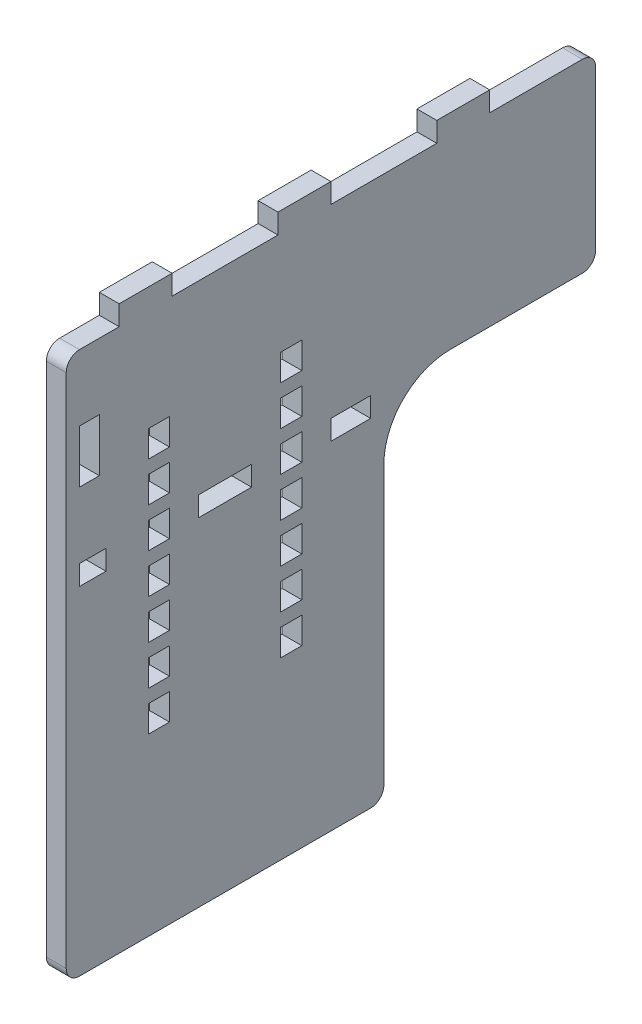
ISO-10303-21;
HEADER;
FILE_DESCRIPTION(('STEP AP214'),'2;1');
FILE_NAME('part.step','',(''),(''),'','','');
FILE_SCHEMA(('AUTOMOTIVE_DESIGN { 1 0 10303 214 1 1 1 1 }'));
ENDSEC;
DATA;
#1=APPLICATION_CONTEXT('core data for automotive mechanical design processes');
#2=APPLICATION_PROTOCOL_DEFINITION('international standard','automotive_design',2000,#1);
#3=PRODUCT_CONTEXT('',#1,'mechanical');
#4=PRODUCT('Part','Part','',(#3));
#5=PRODUCT_RELATED_PRODUCT_CATEGORY('part','',(#4));
#6=PRODUCT_DEFINITION_FORMATION('','',#4);
#7=PRODUCT_DEFINITION_CONTEXT('part definition',#1,'design');
#8=PRODUCT_DEFINITION('design','',#6,#7);
#9=PRODUCT_DEFINITION_SHAPE('','',#8);
#10=(LENGTH_UNIT() NAMED_UNIT(*) SI_UNIT(.MILLI.,.METRE.));
#11=(NAMED_UNIT(*) PLANE_ANGLE_UNIT() SI_UNIT($,.RADIAN.));
#12=(NAMED_UNIT(*) SI_UNIT($,.STERADIAN.) SOLID_ANGLE_UNIT());
#13=UNCERTAINTY_MEASURE_WITH_UNIT(LENGTH_MEASURE(1.E-05),#10,'distance_accuracy_value','');
#14=(GEOMETRIC_REPRESENTATION_CONTEXT(3) GLOBAL_UNCERTAINTY_ASSIGNED_CONTEXT((#13)) GLOBAL_UNIT_ASSIGNED_CONTEXT((#10,
#11,#12)) REPRESENTATION_CONTEXT('',''));
#15=CARTESIAN_POINT('',(0.,0.,0.));
#16=DIRECTION('',(0.,0.,1.));
#17=DIRECTION('',(1.,0.,0.));
#18=AXIS2_PLACEMENT_3D('',#15,#16,#17);
#19=CARTESIAN_POINT('',(15.,0.,0.));
#20=DIRECTION('',(-1.,0.,0.));
#21=DIRECTION('',(0.,0.,1.));
#22=AXIS2_PLACEMENT_3D('',#19,#20,#21);
#23=PLANE('',#22);
#24=DIRECTION('',(0.,-1.,0.));
#25=VECTOR('',#24,1.);
#26=CARTESIAN_POINT('',(15.,0.,-10.));
#27=LINE('',#26,#25);
#28=CARTESIAN_POINT('',(15.,270.,-10.));
#29=VERTEX_POINT('',#28);
#30=CARTESIAN_POINT('',(15.,255.,-10.));
#31=VERTEX_POINT('',#30);
#32=EDGE_CURVE('E726',#29,#31,#27,.T.);
#33=ORIENTED_EDGE('',*,*,#32,.F.);
#34=DIRECTION('',(0.,0.,1.));
#35=VECTOR('',#34,1.);
#36=CARTESIAN_POINT('',(15.,270.,0.));
#37=LINE('',#36,#35);
#38=CARTESIAN_POINT('',(15.,270.,-30.));
#39=VERTEX_POINT('',#38);
#40=EDGE_CURVE('E716',#39,#29,#37,.T.);
#41=ORIENTED_EDGE('',*,*,#40,.F.);
#42=DIRECTION('',(0.,1.,0.));
#43=VECTOR('',#42,1.);
#44=CARTESIAN_POINT('',(15.,0.,-30.0000000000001));
#45=LINE('',#44,#43);
#46=CARTESIAN_POINT('',(15.,255.,-30.));
#47=VERTEX_POINT('',#46);
#48=EDGE_CURVE('E719',#47,#39,#45,.T.);
#49=ORIENTED_EDGE('',*,*,#48,.F.);
#50=DIRECTION('',(0.,0.,-1.));
#51=VECTOR('',#50,1.);
#52=CARTESIAN_POINT('',(15.,255.,0.));
#53=LINE('',#52,#51);
#54=EDGE_CURVE('E723',#31,#47,#53,.T.);
#55=ORIENTED_EDGE('',*,*,#54,.F.);
#56=EDGE_LOOP('',(#33,#41,#49,#55));
#57=FACE_BOUND('',#56,.T.);
#58=DIRECTION('',(0.,-1.,0.));
#59=VECTOR('',#58,1.);
#60=CARTESIAN_POINT('',(15.,360.,-10.));
#61=LINE('',#60,#59);
#62=CARTESIAN_POINT('',(15.,360.,-10.));
#63=VERTEX_POINT('',#62);
#64=CARTESIAN_POINT('',(15.,320.,-10.));
#65=VERTEX_POINT('',#64);
#66=EDGE_CURVE('E773',#63,#65,#61,.T.);
#67=ORIENTED_EDGE('',*,*,#66,.F.);
#68=DIRECTION('',(0.,0.,1.));
#69=VECTOR('',#68,1.);
#70=CARTESIAN_POINT('',(15.,360.,-10.));
#71=LINE('',#70,#69);
#72=CARTESIAN_POINT('',(15.,360.,-25.));
#73=VERTEX_POINT('',#72);
#74=EDGE_CURVE('E784',#73,#63,#71,.T.);
#75=ORIENTED_EDGE('',*,*,#74,.F.);
#76=DIRECTION('',(0.,1.,0.));
#77=VECTOR('',#76,1.);
#78=CARTESIAN_POINT('',(15.,360.,-25.));
#79=LINE('',#78,#77);
#80=CARTESIAN_POINT('',(15.,320.,-25.));
#81=VERTEX_POINT('',#80);
#82=EDGE_CURVE('E780',#81,#73,#79,.T.);
#83=ORIENTED_EDGE('',*,*,#82,.F.);
#84=DIRECTION('',(0.,0.,-1.));
#85=VECTOR('',#84,1.);
#86=CARTESIAN_POINT('',(15.,320.,-10.));
#87=LINE('',#86,#85);
#88=EDGE_CURVE('E776',#65,#81,#87,.T.);
#89=ORIENTED_EDGE('',*,*,#88,.F.);
#90=EDGE_LOOP('',(#67,#75,#83,#89));
#91=FACE_BOUND('',#90,.T.);
#92=DIRECTION('',(0.,0.,-1.));
#93=VECTOR('',#92,1.);
#94=CARTESIAN_POINT('',(15.,132.293080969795,-162.));
#95=LINE('',#94,#93);
#96=CARTESIAN_POINT('',(15.,132.293080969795,-162.));
#97=VERTEX_POINT('',#96);
#98=CARTESIAN_POINT('',(15.,132.293080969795,-178.));
#99=VERTEX_POINT('',#98);
#100=EDGE_CURVE('E1207',#97,#99,#95,.T.);
#101=ORIENTED_EDGE('',*,*,#100,.F.);
#102=DIRECTION('',(0.,-1.,0.));
#103=VECTOR('',#102,1.);
#104=CARTESIAN_POINT('',(15.,152.293080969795,-162.));
#105=LINE('',#104,#103);
#106=CARTESIAN_POINT('',(15.,152.293080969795,-162.));
#107=VERTEX_POINT('',#106);
#108=EDGE_CURVE('E1201',#107,#97,#105,.T.);
#109=ORIENTED_EDGE('',*,*,#108,.F.);
#110=DIRECTION('',(0.,0.,-1.));
#111=VECTOR('',#110,1.);
#112=CARTESIAN_POINT('',(15.,152.293080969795,-162.));
#113=LINE('',#112,#111);
#114=CARTESIAN_POINT('',(15.,152.293080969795,-178.));
#115=VERTEX_POINT('',#114);
#116=EDGE_CURVE('E1220',#107,#115,#113,.T.);
#117=ORIENTED_EDGE('',*,*,#116,.T.);
#118=DIRECTION('',(0.,-1.,0.));
#119=VECTOR('',#118,1.);
#120=CARTESIAN_POINT('',(15.,152.293080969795,-178.));
#121=LINE('',#120,#119);
#122=EDGE_CURVE('E1224',#115,#99,#121,.T.);
#123=ORIENTED_EDGE('',*,*,#122,.T.);
#124=EDGE_LOOP('',(#101,#109,#117,#123));
#125=FACE_BOUND('',#124,.T.);
#126=DIRECTION('',(0.,0.,-1.));
#127=VECTOR('',#126,1.);
#128=CARTESIAN_POINT('',(15.,252.293080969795,-162.));
#129=LINE('',#128,#127);
#130=CARTESIAN_POINT('',(15.,252.293080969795,-162.));
#131=VERTEX_POINT('',#130);
#132=CARTESIAN_POINT('',(15.,252.293080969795,-178.));
#133=VERTEX_POINT('',#132);
#134=EDGE_CURVE('E1293',#131,#133,#129,.T.);
#135=ORIENTED_EDGE('',*,*,#134,.F.);
#136=DIRECTION('',(0.,-1.,0.));
#137=VECTOR('',#136,1.);
#138=CARTESIAN_POINT('',(15.,272.293080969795,-162.));
#139=LINE('',#138,#137);
#140=CARTESIAN_POINT('',(15.,272.293080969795,-162.));
#141=VERTEX_POINT('',#140);
#142=EDGE_CURVE('E1287',#141,#131,#139,.T.);
#143=ORIENTED_EDGE('',*,*,#142,.F.);
#144=DIRECTION('',(0.,0.,-1.));
#145=VECTOR('',#144,1.);
#146=CARTESIAN_POINT('',(15.,272.293080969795,-162.));
#147=LINE('',#146,#145);
#148=CARTESIAN_POINT('',(15.,272.293080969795,-178.));
#149=VERTEX_POINT('',#148);
#150=EDGE_CURVE('E1306',#141,#149,#147,.T.);
#151=ORIENTED_EDGE('',*,*,#150,.T.);
#152=DIRECTION('',(0.,-1.,0.));
#153=VECTOR('',#152,1.);
#154=CARTESIAN_POINT('',(15.,272.293080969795,-178.));
#155=LINE('',#154,#153);
#156=EDGE_CURVE('E1310',#149,#133,#155,.T.);
#157=ORIENTED_EDGE('',*,*,#156,.T.);
#158=EDGE_LOOP('',(#135,#143,#151,#157));
#159=FACE_BOUND('',#158,.T.);
#160=DIRECTION('',(0.,0.,-1.));
#161=VECTOR('',#160,1.);
#162=CARTESIAN_POINT('',(15.,312.293080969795,-162.));
#163=LINE('',#162,#161);
#164=CARTESIAN_POINT('',(15.,312.293080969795,-162.));
#165=VERTEX_POINT('',#164);
#166=CARTESIAN_POINT('',(15.,312.293080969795,-178.));
#167=VERTEX_POINT('',#166);
#168=EDGE_CURVE('E1379',#165,#167,#163,.T.);
#169=ORIENTED_EDGE('',*,*,#168,.F.);
#170=DIRECTION('',(0.,-1.,0.));
#171=VECTOR('',#170,1.);
#172=CARTESIAN_POINT('',(15.,332.293080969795,-162.));
#173=LINE('',#172,#171);
#174=CARTESIAN_POINT('',(15.,332.293080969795,-162.));
#175=VERTEX_POINT('',#174);
#176=EDGE_CURVE('E1373',#175,#165,#173,.T.);
#177=ORIENTED_EDGE('',*,*,#176,.F.);
#178=DIRECTION('',(0.,0.,-1.));
#179=VECTOR('',#178,1.);
#180=CARTESIAN_POINT('',(15.,332.293080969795,-162.));
#181=LINE('',#180,#179);
#182=CARTESIAN_POINT('',(15.,332.293080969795,-178.));
#183=VERTEX_POINT('',#182);
#184=EDGE_CURVE('E1392',#175,#183,#181,.T.);
#185=ORIENTED_EDGE('',*,*,#184,.T.);
#186=DIRECTION('',(0.,-1.,0.));
#187=VECTOR('',#186,1.);
#188=CARTESIAN_POINT('',(15.,332.293080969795,-178.));
#189=LINE('',#188,#187);
#190=EDGE_CURVE('E1396',#183,#167,#189,.T.);
#191=ORIENTED_EDGE('',*,*,#190,.T.);
#192=EDGE_LOOP('',(#169,#177,#185,#191));
#193=FACE_BOUND('',#192,.T.);
#194=DIRECTION('',(0.,0.,-1.));
#195=VECTOR('',#194,1.);
#196=CARTESIAN_POINT('',(15.,282.293080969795,-62.));
#197=LINE('',#196,#195);
#198=CARTESIAN_POINT('',(15.,282.293080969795,-62.));
#199=VERTEX_POINT('',#198);
#200=CARTESIAN_POINT('',(15.,282.293080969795,-78.));
#201=VERTEX_POINT('',#200);
#202=EDGE_CURVE('E1463',#199,#201,#197,.T.);
#203=ORIENTED_EDGE('',*,*,#202,.F.);
#204=DIRECTION('',(0.,-1.,0.));
#205=VECTOR('',#204,1.);
#206=CARTESIAN_POINT('',(15.,302.293080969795,-62.));
#207=LINE('',#206,#205);
#208=CARTESIAN_POINT('',(15.,302.293080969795,-62.));
#209=VERTEX_POINT('',#208);
#210=EDGE_CURVE('E1457',#209,#199,#207,.T.);
#211=ORIENTED_EDGE('',*,*,#210,.F.);
#212=DIRECTION('',(0.,0.,-1.));
#213=VECTOR('',#212,1.);
#214=CARTESIAN_POINT('',(15.,302.293080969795,-62.));
#215=LINE('',#214,#213);
#216=CARTESIAN_POINT('',(15.,302.293080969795,-78.));
#217=VERTEX_POINT('',#216);
#218=EDGE_CURVE('E1476',#209,#217,#215,.T.);
#219=ORIENTED_EDGE('',*,*,#218,.T.);
#220=DIRECTION('',(0.,-1.,0.));
#221=VECTOR('',#220,1.);
#222=CARTESIAN_POINT('',(15.,302.293080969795,-78.));
#223=LINE('',#222,#221);
#224=EDGE_CURVE('E1480',#217,#201,#223,.T.);
#225=ORIENTED_EDGE('',*,*,#224,.T.);
#226=EDGE_LOOP('',(#203,#211,#219,#225));
#227=FACE_BOUND('',#226,.T.);
#228=DIRECTION('',(0.,0.,-1.));
#229=VECTOR('',#228,1.);
#230=CARTESIAN_POINT('',(15.,222.293080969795,-62.));
#231=LINE('',#230,#229);
#232=CARTESIAN_POINT('',(15.,222.293080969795,-62.));
#233=VERTEX_POINT('',#232);
#234=CARTESIAN_POINT('',(15.,222.293080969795,-78.));
#235=VERTEX_POINT('',#234);
#236=EDGE_CURVE('E992',#233,#235,#231,.T.);
#237=ORIENTED_EDGE('',*,*,#236,.F.);
#238=DIRECTION('',(0.,-1.,0.));
#239=VECTOR('',#238,1.);
#240=CARTESIAN_POINT('',(15.,242.293080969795,-62.));
#241=LINE('',#240,#239);
#242=CARTESIAN_POINT('',(15.,242.293080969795,-62.));
#243=VERTEX_POINT('',#242);
#244=EDGE_CURVE('E986',#243,#233,#241,.T.);
#245=ORIENTED_EDGE('',*,*,#244,.F.);
#246=DIRECTION('',(0.,0.,-1.));
#247=VECTOR('',#246,1.);
#248=CARTESIAN_POINT('',(15.,242.293080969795,-62.));
#249=LINE('',#248,#247);
#250=CARTESIAN_POINT('',(15.,242.293080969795,-78.));
#251=VERTEX_POINT('',#250);
#252=EDGE_CURVE('E1005',#243,#251,#249,.T.);
#253=ORIENTED_EDGE('',*,*,#252,.T.);
#254=DIRECTION('',(0.,-1.,0.));
#255=VECTOR('',#254,1.);
#256=CARTESIAN_POINT('',(15.,242.293080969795,-78.));
#257=LINE('',#256,#255);
#258=EDGE_CURVE('E1009',#251,#235,#257,.T.);
#259=ORIENTED_EDGE('',*,*,#258,.T.);
#260=EDGE_LOOP('',(#237,#245,#253,#259));
#261=FACE_BOUND('',#260,.T.);
#262=DIRECTION('',(0.,0.,-1.));
#263=VECTOR('',#262,1.);
#264=CARTESIAN_POINT('',(15.,162.293080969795,-62.));
#265=LINE('',#264,#263);
#266=CARTESIAN_POINT('',(15.,162.293080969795,-62.));
#267=VERTEX_POINT('',#266);
#268=CARTESIAN_POINT('',(15.,162.293080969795,-78.));
#269=VERTEX_POINT('',#268);
#270=EDGE_CURVE('E1078',#267,#269,#265,.T.);
#271=ORIENTED_EDGE('',*,*,#270,.F.);
#272=DIRECTION('',(0.,-1.,0.));
#273=VECTOR('',#272,1.);
#274=CARTESIAN_POINT('',(15.,182.293080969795,-62.));
#275=LINE('',#274,#273);
#276=CARTESIAN_POINT('',(15.,182.293080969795,-62.));
#277=VERTEX_POINT('',#276);
#278=EDGE_CURVE('E1072',#277,#267,#275,.T.);
#279=ORIENTED_EDGE('',*,*,#278,.F.);
#280=DIRECTION('',(0.,0.,-1.));
#281=VECTOR('',#280,1.);
#282=CARTESIAN_POINT('',(15.,182.293080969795,-62.));
#283=LINE('',#282,#281);
#284=CARTESIAN_POINT('',(15.,182.293080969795,-78.));
#285=VERTEX_POINT('',#284);
#286=EDGE_CURVE('E1091',#277,#285,#283,.T.);
#287=ORIENTED_EDGE('',*,*,#286,.T.);
#288=DIRECTION('',(0.,-1.,0.));
#289=VECTOR('',#288,1.);
#290=CARTESIAN_POINT('',(15.,182.293080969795,-78.));
#291=LINE('',#290,#289);
#292=EDGE_CURVE('E1095',#285,#269,#291,.T.);
#293=ORIENTED_EDGE('',*,*,#292,.T.);
#294=EDGE_LOOP('',(#271,#279,#287,#293));
#295=FACE_BOUND('',#294,.T.);
#296=DIRECTION('',(0.,-1.,0.));
#297=VECTOR('',#296,1.);
#298=CARTESIAN_POINT('',(15.,152.293080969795,-78.));
#299=LINE('',#298,#297);
#300=CARTESIAN_POINT('',(15.,152.293080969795,-78.));
#301=VERTEX_POINT('',#300);
#302=CARTESIAN_POINT('',(15.,132.293080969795,-78.));
#303=VERTEX_POINT('',#302);
#304=EDGE_CURVE('E1105',#301,#303,#299,.T.);
#305=ORIENTED_EDGE('',*,*,#304,.T.);
#306=DIRECTION('',(0.,0.,1.));
#307=VECTOR('',#306,1.);
#308=CARTESIAN_POINT('',(15.,132.293080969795,-78.));
#309=LINE('',#308,#307);
#310=CARTESIAN_POINT('',(15.,132.293080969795,-62.));
#311=VERTEX_POINT('',#310);
#312=EDGE_CURVE('E1119',#303,#311,#309,.T.);
#313=ORIENTED_EDGE('',*,*,#312,.T.);
#314=DIRECTION('',(0.,-1.,0.));
#315=VECTOR('',#314,1.);
#316=CARTESIAN_POINT('',(15.,152.293080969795,-62.));
#317=LINE('',#316,#315);
#318=CARTESIAN_POINT('',(15.,152.293080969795,-62.));
#319=VERTEX_POINT('',#318);
#320=EDGE_CURVE('E1136',#319,#311,#317,.T.);
#321=ORIENTED_EDGE('',*,*,#320,.F.);
#322=DIRECTION('',(0.,0.,1.));
#323=VECTOR('',#322,1.);
#324=CARTESIAN_POINT('',(15.,152.293080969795,-78.));
#325=LINE('',#324,#323);
#326=EDGE_CURVE('E1132',#301,#319,#325,.T.);
#327=ORIENTED_EDGE('',*,*,#326,.F.);
#328=EDGE_LOOP('',(#305,#313,#321,#327));
#329=FACE_BOUND('',#328,.T.);
#330=DIRECTION('',(0.,0.,-1.));
#331=VECTOR('',#330,1.);
#332=CARTESIAN_POINT('',(15.,0.,-240.));
#333=LINE('',#332,#331);
#334=CARTESIAN_POINT('',(15.,0.,-10.));
#335=VERTEX_POINT('',#334);
#336=CARTESIAN_POINT('',(15.,0.,-230.));
#337=VERTEX_POINT('',#336);
#338=EDGE_CURVE('E1529',#335,#337,#333,.T.);
#339=ORIENTED_EDGE('',*,*,#338,.T.);
#340=CARTESIAN_POINT('',(15.,10.,-230.));
#341=DIRECTION('',(-1.,0.,0.));
#342=DIRECTION('',(0.,0.,1.));
#343=AXIS2_PLACEMENT_3D('',#340,#341,#342);
#344=CIRCLE('',#343,10.);
#345=CARTESIAN_POINT('',(15.,10.,-240.));
#346=VERTEX_POINT('',#345);
#347=EDGE_CURVE('E1633',#337,#346,#344,.F.);
#348=ORIENTED_EDGE('',*,*,#347,.T.);
#349=DIRECTION('',(0.,1.,0.));
#350=VECTOR('',#349,1.);
#351=CARTESIAN_POINT('',(15.,270.,-240.));
#352=LINE('',#351,#350);
#353=CARTESIAN_POINT('',(15.,220.,-240.));
#354=VERTEX_POINT('',#353);
#355=EDGE_CURVE('E1533',#346,#354,#352,.T.);
#356=ORIENTED_EDGE('',*,*,#355,.T.);
#357=CARTESIAN_POINT('',(15.,220.,-290.));
#358=DIRECTION('',(-1.,0.,0.));
#359=DIRECTION('',(0.,0.,1.));
#360=AXIS2_PLACEMENT_3D('',#357,#358,#359);
#361=CIRCLE('',#360,50.);
#362=CARTESIAN_POINT('',(15.,270.,-290.));
#363=VERTEX_POINT('',#362);
#364=EDGE_CURVE('E1587',#363,#354,#361,.F.);
#365=ORIENTED_EDGE('',*,*,#364,.F.);
#366=DIRECTION('',(0.,0.,-1.));
#367=VECTOR('',#366,1.);
#368=CARTESIAN_POINT('',(15.,270.,-400.));
#369=LINE('',#368,#367);
#370=CARTESIAN_POINT('',(15.,270.,-390.));
#371=VERTEX_POINT('',#370);
#372=EDGE_CURVE('E1537',#363,#371,#369,.T.);
#373=ORIENTED_EDGE('',*,*,#372,.T.);
#374=CARTESIAN_POINT('',(15.,280.,-390.));
#375=DIRECTION('',(-1.,0.,0.));
#376=DIRECTION('',(0.,0.,1.));
#377=AXIS2_PLACEMENT_3D('',#374,#375,#376);
#378=CIRCLE('',#377,10.);
#379=CARTESIAN_POINT('',(15.,280.,-400.));
#380=VERTEX_POINT('',#379);
#381=EDGE_CURVE('E1621',#371,#380,#378,.F.);
#382=ORIENTED_EDGE('',*,*,#381,.T.);
#383=DIRECTION('',(0.,1.,0.));
#384=VECTOR('',#383,1.);
#385=CARTESIAN_POINT('',(15.,410.,-400.));
#386=LINE('',#385,#384);
#387=CARTESIAN_POINT('',(15.,400.,-400.));
#388=VERTEX_POINT('',#387);
#389=EDGE_CURVE('E1541',#380,#388,#386,.T.);
#390=ORIENTED_EDGE('',*,*,#389,.T.);
#391=CARTESIAN_POINT('',(15.,400.,-390.));
#392=DIRECTION('',(-1.,0.,0.));
#393=DIRECTION('',(0.,0.,1.));
#394=AXIS2_PLACEMENT_3D('',#391,#392,#393);
#395=CIRCLE('',#394,10.);
#396=CARTESIAN_POINT('',(15.,410.,-390.));
#397=VERTEX_POINT('',#396);
#398=EDGE_CURVE('E1624',#388,#397,#395,.F.);
#399=ORIENTED_EDGE('',*,*,#398,.T.);
#400=DIRECTION('',(0.,0.,1.));
#401=VECTOR('',#400,1.);
#402=CARTESIAN_POINT('',(15.,410.,0.));
#403=LINE('',#402,#401);
#404=CARTESIAN_POINT('',(15.,410.,-320.));
#405=VERTEX_POINT('',#404);
#406=EDGE_CURVE('E1546',#397,#405,#403,.T.);
#407=ORIENTED_EDGE('',*,*,#406,.T.);
#408=DIRECTION('',(0.,-1.,0.));
#409=VECTOR('',#408,1.);
#410=CARTESIAN_POINT('',(15.,425.,-320.));
#411=LINE('',#410,#409);
#412=CARTESIAN_POINT('',(15.,425.,-320.));
#413=VERTEX_POINT('',#412);
#414=EDGE_CURVE('E914',#413,#405,#411,.T.);
#415=ORIENTED_EDGE('',*,*,#414,.F.);
#416=DIRECTION('',(0.,0.,-1.));
#417=VECTOR('',#416,1.);
#418=CARTESIAN_POINT('',(15.,425.,-320.));
#419=LINE('',#418,#417);
#420=CARTESIAN_POINT('',(15.,425.,-280.));
#421=VERTEX_POINT('',#420);
#422=EDGE_CURVE('E898',#421,#413,#419,.T.);
#423=ORIENTED_EDGE('',*,*,#422,.F.);
#424=DIRECTION('',(0.,-1.,0.));
#425=VECTOR('',#424,1.);
#426=CARTESIAN_POINT('',(15.,425.,-280.));
#427=LINE('',#426,#425);
#428=CARTESIAN_POINT('',(15.,410.,-280.));
#429=VERTEX_POINT('',#428);
#430=EDGE_CURVE('E918',#421,#429,#427,.T.);
#431=ORIENTED_EDGE('',*,*,#430,.T.);
#432=CARTESIAN_POINT('',(15.,410.,-200.));
#433=VERTEX_POINT('',#432);
#434=EDGE_CURVE('E1551',#429,#433,#403,.T.);
#435=ORIENTED_EDGE('',*,*,#434,.T.);
#436=DIRECTION('',(0.,-1.,0.));
#437=VECTOR('',#436,1.);
#438=CARTESIAN_POINT('',(15.,425.,-200.));
#439=LINE('',#438,#437);
#440=CARTESIAN_POINT('',(15.,425.,-200.));
#441=VERTEX_POINT('',#440);
#442=EDGE_CURVE('E823',#441,#433,#439,.T.);
#443=ORIENTED_EDGE('',*,*,#442,.F.);
#444=DIRECTION('',(0.,0.,-1.));
#445=VECTOR('',#444,1.);
#446=CARTESIAN_POINT('',(15.,425.,-200.));
#447=LINE('',#446,#445);
#448=CARTESIAN_POINT('',(15.,425.,-160.));
#449=VERTEX_POINT('',#448);
#450=EDGE_CURVE('E844',#449,#441,#447,.T.);
#451=ORIENTED_EDGE('',*,*,#450,.F.);
#452=DIRECTION('',(0.,-1.,0.));
#453=VECTOR('',#452,1.);
#454=CARTESIAN_POINT('',(15.,425.,-160.));
#455=LINE('',#454,#453);
#456=CARTESIAN_POINT('',(15.,410.,-160.));
#457=VERTEX_POINT('',#456);
#458=EDGE_CURVE('E819',#449,#457,#455,.T.);
#459=ORIENTED_EDGE('',*,*,#458,.T.);
#460=CARTESIAN_POINT('',(15.,410.,-80.));
#461=VERTEX_POINT('',#460);
#462=EDGE_CURVE('E1552',#457,#461,#403,.T.);
#463=ORIENTED_EDGE('',*,*,#462,.T.);
#464=DIRECTION('',(0.,-1.,0.));
#465=VECTOR('',#464,1.);
#466=CARTESIAN_POINT('',(15.,425.,-80.));
#467=LINE('',#466,#465);
#468=CARTESIAN_POINT('',(15.,425.,-80.));
#469=VERTEX_POINT('',#468);
#470=EDGE_CURVE('E860',#469,#461,#467,.T.);
#471=ORIENTED_EDGE('',*,*,#470,.F.);
#472=DIRECTION('',(0.,0.,-1.));
#473=VECTOR('',#472,1.);
#474=CARTESIAN_POINT('',(15.,425.,-80.));
#475=LINE('',#474,#473);
#476=CARTESIAN_POINT('',(15.,425.,-40.));
#477=VERTEX_POINT('',#476);
#478=EDGE_CURVE('E881',#477,#469,#475,.T.);
#479=ORIENTED_EDGE('',*,*,#478,.F.);
#480=DIRECTION('',(0.,-1.,0.));
#481=VECTOR('',#480,1.);
#482=CARTESIAN_POINT('',(15.,425.,-40.));
#483=LINE('',#482,#481);
#484=CARTESIAN_POINT('',(15.,410.,-40.));
#485=VERTEX_POINT('',#484);
#486=EDGE_CURVE('E856',#477,#485,#483,.T.);
#487=ORIENTED_EDGE('',*,*,#486,.T.);
#488=CARTESIAN_POINT('',(15.,410.,-10.));
#489=VERTEX_POINT('',#488);
#490=EDGE_CURVE('E1545',#485,#489,#403,.T.);
#491=ORIENTED_EDGE('',*,*,#490,.T.);
#492=CARTESIAN_POINT('',(15.,400.,-10.));
#493=DIRECTION('',(-1.,0.,0.));
#494=DIRECTION('',(0.,0.,1.));
#495=AXIS2_PLACEMENT_3D('',#492,#493,#494);
#496=CIRCLE('',#495,10.);
#497=CARTESIAN_POINT('',(15.,400.,0.));
#498=VERTEX_POINT('',#497);
#499=EDGE_CURVE('E1627',#489,#498,#496,.F.);
#500=ORIENTED_EDGE('',*,*,#499,.T.);
#501=DIRECTION('',(0.,-1.,0.));
#502=VECTOR('',#501,1.);
#503=CARTESIAN_POINT('',(15.,0.,0.));
#504=LINE('',#503,#502);
#505=CARTESIAN_POINT('',(15.,10.,0.));
#506=VERTEX_POINT('',#505);
#507=EDGE_CURVE('E1550',#498,#506,#504,.T.);
#508=ORIENTED_EDGE('',*,*,#507,.T.);
#509=CARTESIAN_POINT('',(15.,10.,-10.));
#510=DIRECTION('',(-1.,0.,0.));
#511=DIRECTION('',(0.,0.,1.));
#512=AXIS2_PLACEMENT_3D('',#509,#510,#511);
#513=CIRCLE('',#512,10.);
#514=EDGE_CURVE('E1630',#506,#335,#513,.F.);
#515=ORIENTED_EDGE('',*,*,#514,.T.);
#516=EDGE_LOOP('',(#339,#348,#356,#365,#373,#382,#390,#399,#407,#415,#423,#431,#435,#443,#451,
#459,#463,#471,#479,#487,#491,#500,#508,#515));
#517=FACE_BOUND('',#516,.T.);
#518=DIRECTION('',(0.,0.,-1.));
#519=VECTOR('',#518,1.);
#520=CARTESIAN_POINT('',(15.,192.293080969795,-162.));
#521=LINE('',#520,#519);
#522=CARTESIAN_POINT('',(15.,192.293080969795,-162.));
#523=VERTEX_POINT('',#522);
#524=CARTESIAN_POINT('',(15.,192.293080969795,-178.));
#525=VERTEX_POINT('',#524);
#526=EDGE_CURVE('E1486',#523,#525,#521,.T.);
#527=ORIENTED_EDGE('',*,*,#526,.F.);
#528=DIRECTION('',(0.,-1.,0.));
#529=VECTOR('',#528,1.);
#530=CARTESIAN_POINT('',(15.,212.293080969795,-162.));
#531=LINE('',#530,#529);
#532=CARTESIAN_POINT('',(15.,212.293080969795,-162.));
#533=VERTEX_POINT('',#532);
#534=EDGE_CURVE('E1498',#533,#523,#531,.T.);
#535=ORIENTED_EDGE('',*,*,#534,.F.);
#536=DIRECTION('',(0.,0.,-1.));
#537=VECTOR('',#536,1.);
#538=CARTESIAN_POINT('',(15.,212.293080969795,-162.));
#539=LINE('',#538,#537);
#540=CARTESIAN_POINT('',(15.,212.293080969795,-178.));
#541=VERTEX_POINT('',#540);
#542=EDGE_CURVE('E1494',#533,#541,#539,.T.);
#543=ORIENTED_EDGE('',*,*,#542,.T.);
#544=DIRECTION('',(0.,-1.,0.));
#545=VECTOR('',#544,1.);
#546=CARTESIAN_POINT('',(15.,212.293080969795,-178.));
#547=LINE('',#546,#545);
#548=EDGE_CURVE('E1489',#541,#525,#547,.T.);
#549=ORIENTED_EDGE('',*,*,#548,.T.);
#550=EDGE_LOOP('',(#527,#535,#543,#549));
#551=FACE_BOUND('',#550,.T.);
#552=DIRECTION('',(0.,0.,-1.));
#553=VECTOR('',#552,1.);
#554=CARTESIAN_POINT('',(15.,192.293080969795,-62.));
#555=LINE('',#554,#553);
#556=CARTESIAN_POINT('',(15.,192.293080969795,-62.));
#557=VERTEX_POINT('',#556);
#558=CARTESIAN_POINT('',(15.,192.293080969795,-78.));
#559=VERTEX_POINT('',#558);
#560=EDGE_CURVE('E1035',#557,#559,#555,.T.);
#561=ORIENTED_EDGE('',*,*,#560,.F.);
#562=DIRECTION('',(0.,-1.,0.));
#563=VECTOR('',#562,1.);
#564=CARTESIAN_POINT('',(15.,212.293080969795,-62.));
#565=LINE('',#564,#563);
#566=CARTESIAN_POINT('',(15.,212.293080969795,-62.));
#567=VERTEX_POINT('',#566);
#568=EDGE_CURVE('E1029',#567,#557,#565,.T.);
#569=ORIENTED_EDGE('',*,*,#568,.F.);
#570=DIRECTION('',(0.,0.,-1.));
#571=VECTOR('',#570,1.);
#572=CARTESIAN_POINT('',(15.,212.293080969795,-62.));
#573=LINE('',#572,#571);
#574=CARTESIAN_POINT('',(15.,212.293080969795,-78.));
#575=VERTEX_POINT('',#574);
#576=EDGE_CURVE('E1048',#567,#575,#573,.T.);
#577=ORIENTED_EDGE('',*,*,#576,.T.);
#578=DIRECTION('',(0.,-1.,0.));
#579=VECTOR('',#578,1.);
#580=CARTESIAN_POINT('',(15.,212.293080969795,-78.));
#581=LINE('',#580,#579);
#582=EDGE_CURVE('E1052',#575,#559,#581,.T.);
#583=ORIENTED_EDGE('',*,*,#582,.T.);
#584=EDGE_LOOP('',(#561,#569,#577,#583));
#585=FACE_BOUND('',#584,.T.);
#586=DIRECTION('',(0.,0.,-1.));
#587=VECTOR('',#586,1.);
#588=CARTESIAN_POINT('',(15.,252.293080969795,-62.));
#589=LINE('',#588,#587);
#590=CARTESIAN_POINT('',(15.,252.293080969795,-62.));
#591=VERTEX_POINT('',#590);
#592=CARTESIAN_POINT('',(15.,252.293080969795,-78.));
#593=VERTEX_POINT('',#592);
#594=EDGE_CURVE('E947',#591,#593,#589,.T.);
#595=ORIENTED_EDGE('',*,*,#594,.F.);
#596=DIRECTION('',(0.,-1.,0.));
#597=VECTOR('',#596,1.);
#598=CARTESIAN_POINT('',(15.,272.293080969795,-62.));
#599=LINE('',#598,#597);
#600=CARTESIAN_POINT('',(15.,272.293080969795,-62.));
#601=VERTEX_POINT('',#600);
#602=EDGE_CURVE('E941',#601,#591,#599,.T.);
#603=ORIENTED_EDGE('',*,*,#602,.F.);
#604=DIRECTION('',(0.,0.,-1.));
#605=VECTOR('',#604,1.);
#606=CARTESIAN_POINT('',(15.,272.293080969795,-62.));
#607=LINE('',#606,#605);
#608=CARTESIAN_POINT('',(15.,272.293080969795,-78.));
#609=VERTEX_POINT('',#608);
#610=EDGE_CURVE('E962',#601,#609,#607,.T.);
#611=ORIENTED_EDGE('',*,*,#610,.T.);
#612=DIRECTION('',(0.,-1.,0.));
#613=VECTOR('',#612,1.);
#614=CARTESIAN_POINT('',(15.,272.293080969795,-78.));
#615=LINE('',#614,#613);
#616=EDGE_CURVE('E966',#609,#593,#615,.T.);
#617=ORIENTED_EDGE('',*,*,#616,.T.);
#618=EDGE_LOOP('',(#595,#603,#611,#617));
#619=FACE_BOUND('',#618,.T.);
#620=DIRECTION('',(0.,0.,-1.));
#621=VECTOR('',#620,1.);
#622=CARTESIAN_POINT('',(15.,312.293080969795,-62.));
#623=LINE('',#622,#621);
#624=CARTESIAN_POINT('',(15.,312.293080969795,-62.));
#625=VERTEX_POINT('',#624);
#626=CARTESIAN_POINT('',(15.,312.293080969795,-78.));
#627=VERTEX_POINT('',#626);
#628=EDGE_CURVE('E1422',#625,#627,#623,.T.);
#629=ORIENTED_EDGE('',*,*,#628,.F.);
#630=DIRECTION('',(0.,-1.,0.));
#631=VECTOR('',#630,1.);
#632=CARTESIAN_POINT('',(15.,332.293080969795,-62.));
#633=LINE('',#632,#631);
#634=CARTESIAN_POINT('',(15.,332.293080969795,-62.));
#635=VERTEX_POINT('',#634);
#636=EDGE_CURVE('E1416',#635,#625,#633,.T.);
#637=ORIENTED_EDGE('',*,*,#636,.F.);
#638=DIRECTION('',(0.,0.,-1.));
#639=VECTOR('',#638,1.);
#640=CARTESIAN_POINT('',(15.,332.293080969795,-62.));
#641=LINE('',#640,#639);
#642=CARTESIAN_POINT('',(15.,332.293080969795,-78.));
#643=VERTEX_POINT('',#642);
#644=EDGE_CURVE('E1435',#635,#643,#641,.T.);
#645=ORIENTED_EDGE('',*,*,#644,.T.);
#646=DIRECTION('',(0.,-1.,0.));
#647=VECTOR('',#646,1.);
#648=CARTESIAN_POINT('',(15.,332.293080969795,-78.));
#649=LINE('',#648,#647);
#650=EDGE_CURVE('E1439',#643,#627,#649,.T.);
#651=ORIENTED_EDGE('',*,*,#650,.T.);
#652=EDGE_LOOP('',(#629,#637,#645,#651));
#653=FACE_BOUND('',#652,.T.);
#654=DIRECTION('',(0.,0.,-1.));
#655=VECTOR('',#654,1.);
#656=CARTESIAN_POINT('',(15.,282.293080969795,-162.));
#657=LINE('',#656,#655);
#658=CARTESIAN_POINT('',(15.,282.293080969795,-162.));
#659=VERTEX_POINT('',#658);
#660=CARTESIAN_POINT('',(15.,282.293080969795,-178.));
#661=VERTEX_POINT('',#660);
#662=EDGE_CURVE('E1336',#659,#661,#657,.T.);
#663=ORIENTED_EDGE('',*,*,#662,.F.);
#664=DIRECTION('',(0.,-1.,0.));
#665=VECTOR('',#664,1.);
#666=CARTESIAN_POINT('',(15.,302.293080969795,-162.));
#667=LINE('',#666,#665);
#668=CARTESIAN_POINT('',(15.,302.293080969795,-162.));
#669=VERTEX_POINT('',#668);
#670=EDGE_CURVE('E1330',#669,#659,#667,.T.);
#671=ORIENTED_EDGE('',*,*,#670,.F.);
#672=DIRECTION('',(0.,0.,-1.));
#673=VECTOR('',#672,1.);
#674=CARTESIAN_POINT('',(15.,302.293080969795,-162.));
#675=LINE('',#674,#673);
#676=CARTESIAN_POINT('',(15.,302.293080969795,-178.));
#677=VERTEX_POINT('',#676);
#678=EDGE_CURVE('E1349',#669,#677,#675,.T.);
#679=ORIENTED_EDGE('',*,*,#678,.T.);
#680=DIRECTION('',(0.,-1.,0.));
#681=VECTOR('',#680,1.);
#682=CARTESIAN_POINT('',(15.,302.293080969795,-178.));
#683=LINE('',#682,#681);
#684=EDGE_CURVE('E1353',#677,#661,#683,.T.);
#685=ORIENTED_EDGE('',*,*,#684,.T.);
#686=EDGE_LOOP('',(#663,#671,#679,#685));
#687=FACE_BOUND('',#686,.T.);
#688=DIRECTION('',(0.,0.,-1.));
#689=VECTOR('',#688,1.);
#690=CARTESIAN_POINT('',(15.,222.293080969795,-162.));
#691=LINE('',#690,#689);
#692=CARTESIAN_POINT('',(15.,222.293080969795,-162.));
#693=VERTEX_POINT('',#692);
#694=CARTESIAN_POINT('',(15.,222.293080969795,-178.));
#695=VERTEX_POINT('',#694);
#696=EDGE_CURVE('E1250',#693,#695,#691,.T.);
#697=ORIENTED_EDGE('',*,*,#696,.F.);
#698=DIRECTION('',(0.,-1.,0.));
#699=VECTOR('',#698,1.);
#700=CARTESIAN_POINT('',(15.,242.293080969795,-162.));
#701=LINE('',#700,#699);
#702=CARTESIAN_POINT('',(15.,242.293080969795,-162.));
#703=VERTEX_POINT('',#702);
#704=EDGE_CURVE('E1244',#703,#693,#701,.T.);
#705=ORIENTED_EDGE('',*,*,#704,.F.);
#706=DIRECTION('',(0.,0.,-1.));
#707=VECTOR('',#706,1.);
#708=CARTESIAN_POINT('',(15.,242.293080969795,-162.));
#709=LINE('',#708,#707);
#710=CARTESIAN_POINT('',(15.,242.293080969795,-178.));
#711=VERTEX_POINT('',#710);
#712=EDGE_CURVE('E1263',#703,#711,#709,.T.);
#713=ORIENTED_EDGE('',*,*,#712,.T.);
#714=DIRECTION('',(0.,-1.,0.));
#715=VECTOR('',#714,1.);
#716=CARTESIAN_POINT('',(15.,242.293080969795,-178.));
#717=LINE('',#716,#715);
#718=EDGE_CURVE('E1267',#711,#695,#717,.T.);
#719=ORIENTED_EDGE('',*,*,#718,.T.);
#720=EDGE_LOOP('',(#697,#705,#713,#719));
#721=FACE_BOUND('',#720,.T.);
#722=DIRECTION('',(0.,0.,-1.));
#723=VECTOR('',#722,1.);
#724=CARTESIAN_POINT('',(15.,162.293080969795,-162.));
#725=LINE('',#724,#723);
#726=CARTESIAN_POINT('',(15.,162.293080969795,-162.));
#727=VERTEX_POINT('',#726);
#728=CARTESIAN_POINT('',(15.,162.293080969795,-178.));
#729=VERTEX_POINT('',#728);
#730=EDGE_CURVE('E1162',#727,#729,#725,.T.);
#731=ORIENTED_EDGE('',*,*,#730,.F.);
#732=DIRECTION('',(0.,-1.,0.));
#733=VECTOR('',#732,1.);
#734=CARTESIAN_POINT('',(15.,182.293080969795,-162.));
#735=LINE('',#734,#733);
#736=CARTESIAN_POINT('',(15.,182.293080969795,-162.));
#737=VERTEX_POINT('',#736);
#738=EDGE_CURVE('E1156',#737,#727,#735,.T.);
#739=ORIENTED_EDGE('',*,*,#738,.F.);
#740=DIRECTION('',(0.,0.,-1.));
#741=VECTOR('',#740,1.);
#742=CARTESIAN_POINT('',(15.,182.293080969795,-162.));
#743=LINE('',#742,#741);
#744=CARTESIAN_POINT('',(15.,182.293080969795,-178.));
#745=VERTEX_POINT('',#744);
#746=EDGE_CURVE('E1177',#737,#745,#743,.T.);
#747=ORIENTED_EDGE('',*,*,#746,.T.);
#748=DIRECTION('',(0.,-1.,0.));
#749=VECTOR('',#748,1.);
#750=CARTESIAN_POINT('',(15.,182.293080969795,-178.));
#751=LINE('',#750,#749);
#752=EDGE_CURVE('E1181',#745,#729,#751,.T.);
#753=ORIENTED_EDGE('',*,*,#752,.T.);
#754=EDGE_LOOP('',(#731,#739,#747,#753));
#755=FACE_BOUND('',#754,.T.);
#756=DIRECTION('',(0.,1.,0.));
#757=VECTOR('',#756,1.);
#758=CARTESIAN_POINT('',(15.,270.,-140.));
#759=LINE('',#758,#757);
#760=CARTESIAN_POINT('',(15.,255.,-140.));
#761=VERTEX_POINT('',#760);
#762=CARTESIAN_POINT('',(15.,270.,-140.));
#763=VERTEX_POINT('',#762);
#764=EDGE_CURVE('E730',#761,#763,#759,.T.);
#765=ORIENTED_EDGE('',*,*,#764,.F.);
#766=DIRECTION('',(0.,0.,-1.));
#767=VECTOR('',#766,1.);
#768=CARTESIAN_POINT('',(15.,255.,-99.9999999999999));
#769=LINE('',#768,#767);
#770=CARTESIAN_POINT('',(15.,255.,-99.9999999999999));
#771=VERTEX_POINT('',#770);
#772=EDGE_CURVE('E741',#771,#761,#769,.T.);
#773=ORIENTED_EDGE('',*,*,#772,.F.);
#774=DIRECTION('',(0.,-1.,0.));
#775=VECTOR('',#774,1.);
#776=CARTESIAN_POINT('',(15.,270.,-99.9999999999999));
#777=LINE('',#776,#775);
#778=CARTESIAN_POINT('',(15.,270.,-99.9999999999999));
#779=VERTEX_POINT('',#778);
#780=EDGE_CURVE('E737',#779,#771,#777,.T.);
#781=ORIENTED_EDGE('',*,*,#780,.F.);
#782=DIRECTION('',(0.,0.,1.));
#783=VECTOR('',#782,1.);
#784=CARTESIAN_POINT('',(15.,270.,-99.9999999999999));
#785=LINE('',#784,#783);
#786=EDGE_CURVE('E733',#763,#779,#785,.T.);
#787=ORIENTED_EDGE('',*,*,#786,.F.);
#788=EDGE_LOOP('',(#765,#773,#781,#787));
#789=FACE_BOUND('',#788,.T.);
#790=DIRECTION('',(0.,-1.,0.));
#791=VECTOR('',#790,1.);
#792=CARTESIAN_POINT('',(15.,270.,-200.));
#793=LINE('',#792,#791);
#794=CARTESIAN_POINT('',(15.,270.,-200.));
#795=VERTEX_POINT('',#794);
#796=CARTESIAN_POINT('',(15.,255.,-200.));
#797=VERTEX_POINT('',#796);
#798=EDGE_CURVE('E640',#795,#797,#793,.T.);
#799=ORIENTED_EDGE('',*,*,#798,.F.);
#800=DIRECTION('',(0.,0.,1.));
#801=VECTOR('',#800,1.);
#802=CARTESIAN_POINT('',(15.,270.,-200.));
#803=LINE('',#802,#801);
#804=CARTESIAN_POINT('',(15.,270.,-230.));
#805=VERTEX_POINT('',#804);
#806=EDGE_CURVE('E666',#805,#795,#803,.T.);
#807=ORIENTED_EDGE('',*,*,#806,.F.);
#808=DIRECTION('',(0.,1.,0.));
#809=VECTOR('',#808,1.);
#810=CARTESIAN_POINT('',(15.,270.,-230.));
#811=LINE('',#810,#809);
#812=CARTESIAN_POINT('',(15.,255.,-230.));
#813=VERTEX_POINT('',#812);
#814=EDGE_CURVE('E662',#813,#805,#811,.T.);
#815=ORIENTED_EDGE('',*,*,#814,.F.);
#816=DIRECTION('',(0.,0.,-1.));
#817=VECTOR('',#816,1.);
#818=CARTESIAN_POINT('',(15.,255.,-200.));
#819=LINE('',#818,#817);
#820=EDGE_CURVE('E649',#797,#813,#819,.T.);
#821=ORIENTED_EDGE('',*,*,#820,.F.);
#822=EDGE_LOOP('',(#799,#807,#815,#821));
#823=FACE_BOUND('',#822,.T.);
#824=ADVANCED_FACE('F47',(#57,#91,#125,#159,#193,#227,#261,#295,#329,#517,#551,#585,#619,#653,
#687,#721,#755,#789,#823),#23,.F.);
#825=CARTESIAN_POINT('',(0.,0.,0.));
#826=DIRECTION('',(-1.,0.,0.));
#827=DIRECTION('',(0.,0.,1.));
#828=AXIS2_PLACEMENT_3D('',#825,#826,#827);
#829=PLANE('',#828);
#830=DIRECTION('',(0.,0.,1.));
#831=VECTOR('',#830,1.);
#832=CARTESIAN_POINT('',(0.,132.293080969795,-78.));
#833=LINE('',#832,#831);
#834=CARTESIAN_POINT('',(0.,132.293080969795,-78.));
#835=VERTEX_POINT('',#834);
#836=CARTESIAN_POINT('',(0.,132.293080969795,-62.));
#837=VERTEX_POINT('',#836);
#838=EDGE_CURVE('E1062',#835,#837,#833,.T.);
#839=ORIENTED_EDGE('',*,*,#838,.F.);
#840=DIRECTION('',(0.,-1.,0.));
#841=VECTOR('',#840,1.);
#842=CARTESIAN_POINT('',(0.,152.293080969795,-78.));
#843=LINE('',#842,#841);
#844=CARTESIAN_POINT('',(0.,152.293080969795,-78.));
#845=VERTEX_POINT('',#844);
#846=EDGE_CURVE('E1114',#845,#835,#843,.T.);
#847=ORIENTED_EDGE('',*,*,#846,.F.);
#848=DIRECTION('',(0.,0.,1.));
#849=VECTOR('',#848,1.);
#850=CARTESIAN_POINT('',(0.,152.293080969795,-78.));
#851=LINE('',#850,#849);
#852=CARTESIAN_POINT('',(0.,152.293080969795,-62.));
#853=VERTEX_POINT('',#852);
#854=EDGE_CURVE('E1118',#845,#853,#851,.T.);
#855=ORIENTED_EDGE('',*,*,#854,.T.);
#856=DIRECTION('',(0.,-1.,0.));
#857=VECTOR('',#856,1.);
#858=CARTESIAN_POINT('',(0.,152.293080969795,-62.));
#859=LINE('',#858,#857);
#860=EDGE_CURVE('E1123',#853,#837,#859,.T.);
#861=ORIENTED_EDGE('',*,*,#860,.T.);
#862=EDGE_LOOP('',(#839,#847,#855,#861));
#863=FACE_BOUND('',#862,.T.);
#864=DIRECTION('',(0.,1.,0.));
#865=VECTOR('',#864,1.);
#866=CARTESIAN_POINT('',(0.,270.,-240.));
#867=LINE('',#866,#865);
#868=CARTESIAN_POINT('',(0.,10.,-240.));
#869=VERTEX_POINT('',#868);
#870=CARTESIAN_POINT('',(0.,220.,-240.));
#871=VERTEX_POINT('',#870);
#872=EDGE_CURVE('E1560',#869,#871,#867,.T.);
#873=ORIENTED_EDGE('',*,*,#872,.F.);
#874=CARTESIAN_POINT('',(0.,10.,-230.));
#875=DIRECTION('',(-1.,0.,0.));
#876=DIRECTION('',(0.,0.,1.));
#877=AXIS2_PLACEMENT_3D('',#874,#875,#876);
#878=CIRCLE('',#877,10.);
#879=CARTESIAN_POINT('',(0.,0.,-230.));
#880=VERTEX_POINT('',#879);
#881=EDGE_CURVE('E1611',#869,#880,#878,.T.);
#882=ORIENTED_EDGE('',*,*,#881,.T.);
#883=DIRECTION('',(0.,0.,-1.));
#884=VECTOR('',#883,1.);
#885=CARTESIAN_POINT('',(0.,0.,-240.));
#886=LINE('',#885,#884);
#887=CARTESIAN_POINT('',(0.,0.,-10.));
#888=VERTEX_POINT('',#887);
#889=EDGE_CURVE('E1528',#888,#880,#886,.T.);
#890=ORIENTED_EDGE('',*,*,#889,.F.);
#891=CARTESIAN_POINT('',(0.,10.,-10.));
#892=DIRECTION('',(-1.,0.,0.));
#893=DIRECTION('',(0.,0.,1.));
#894=AXIS2_PLACEMENT_3D('',#891,#892,#893);
#895=CIRCLE('',#894,10.);
#896=CARTESIAN_POINT('',(0.,10.,0.));
#897=VERTEX_POINT('',#896);
#898=EDGE_CURVE('E1608',#888,#897,#895,.T.);
#899=ORIENTED_EDGE('',*,*,#898,.T.);
#900=DIRECTION('',(0.,-1.,0.));
#901=VECTOR('',#900,1.);
#902=CARTESIAN_POINT('',(0.,0.,0.));
#903=LINE('',#902,#901);
#904=CARTESIAN_POINT('',(0.,400.,0.));
#905=VERTEX_POINT('',#904);
#906=EDGE_CURVE('E1534',#905,#897,#903,.T.);
#907=ORIENTED_EDGE('',*,*,#906,.F.);
#908=CARTESIAN_POINT('',(0.,400.,-10.));
#909=DIRECTION('',(-1.,0.,0.));
#910=DIRECTION('',(0.,0.,1.));
#911=AXIS2_PLACEMENT_3D('',#908,#909,#910);
#912=CIRCLE('',#911,10.);
#913=CARTESIAN_POINT('',(0.,410.,-10.));
#914=VERTEX_POINT('',#913);
#915=EDGE_CURVE('E1604',#905,#914,#912,.T.);
#916=ORIENTED_EDGE('',*,*,#915,.T.);
#917=DIRECTION('',(0.,0.,1.));
#918=VECTOR('',#917,1.);
#919=CARTESIAN_POINT('',(0.,410.,0.));
#920=LINE('',#919,#918);
#921=CARTESIAN_POINT('',(0.,410.,-40.));
#922=VERTEX_POINT('',#921);
#923=EDGE_CURVE('E1571',#922,#914,#920,.T.);
#924=ORIENTED_EDGE('',*,*,#923,.F.);
#925=DIRECTION('',(0.,-1.,0.));
#926=VECTOR('',#925,1.);
#927=CARTESIAN_POINT('',(0.,425.,-40.));
#928=LINE('',#927,#926);
#929=CARTESIAN_POINT('',(0.,425.,-40.));
#930=VERTEX_POINT('',#929);
#931=EDGE_CURVE('E841',#930,#922,#928,.T.);
#932=ORIENTED_EDGE('',*,*,#931,.F.);
#933=DIRECTION('',(0.,0.,1.));
#934=VECTOR('',#933,1.);
#935=CARTESIAN_POINT('',(0.,425.,-80.));
#936=LINE('',#935,#934);
#937=CARTESIAN_POINT('',(0.,425.,-80.));
#938=VERTEX_POINT('',#937);
#939=EDGE_CURVE('E874',#938,#930,#936,.T.);
#940=ORIENTED_EDGE('',*,*,#939,.F.);
#941=DIRECTION('',(0.,-1.,0.));
#942=VECTOR('',#941,1.);
#943=CARTESIAN_POINT('',(0.,425.,-80.));
#944=LINE('',#943,#942);
#945=CARTESIAN_POINT('',(0.,410.,-80.));
#946=VERTEX_POINT('',#945);
#947=EDGE_CURVE('E864',#938,#946,#944,.T.);
#948=ORIENTED_EDGE('',*,*,#947,.T.);
#949=CARTESIAN_POINT('',(0.,410.,-160.));
#950=VERTEX_POINT('',#949);
#951=EDGE_CURVE('E1576',#950,#946,#920,.T.);
#952=ORIENTED_EDGE('',*,*,#951,.F.);
#953=DIRECTION('',(0.,-1.,0.));
#954=VECTOR('',#953,1.);
#955=CARTESIAN_POINT('',(0.,425.,-160.));
#956=LINE('',#955,#954);
#957=CARTESIAN_POINT('',(0.,425.,-160.));
#958=VERTEX_POINT('',#957);
#959=EDGE_CURVE('E815',#958,#950,#956,.T.);
#960=ORIENTED_EDGE('',*,*,#959,.F.);
#961=DIRECTION('',(0.,0.,1.));
#962=VECTOR('',#961,1.);
#963=CARTESIAN_POINT('',(0.,425.,-200.));
#964=LINE('',#963,#962);
#965=CARTESIAN_POINT('',(0.,425.,-200.));
#966=VERTEX_POINT('',#965);
#967=EDGE_CURVE('E837',#966,#958,#964,.T.);
#968=ORIENTED_EDGE('',*,*,#967,.F.);
#969=DIRECTION('',(0.,-1.,0.));
#970=VECTOR('',#969,1.);
#971=CARTESIAN_POINT('',(0.,425.,-200.));
#972=LINE('',#971,#970);
#973=CARTESIAN_POINT('',(0.,410.,-200.));
#974=VERTEX_POINT('',#973);
#975=EDGE_CURVE('E827',#966,#974,#972,.T.);
#976=ORIENTED_EDGE('',*,*,#975,.T.);
#977=CARTESIAN_POINT('',(0.,410.,-280.));
#978=VERTEX_POINT('',#977);
#979=EDGE_CURVE('E1575',#978,#974,#920,.T.);
#980=ORIENTED_EDGE('',*,*,#979,.F.);
#981=DIRECTION('',(0.,-1.,0.));
#982=VECTOR('',#981,1.);
#983=CARTESIAN_POINT('',(0.,425.,-280.));
#984=LINE('',#983,#982);
#985=CARTESIAN_POINT('',(0.,425.,-280.));
#986=VERTEX_POINT('',#985);
#987=EDGE_CURVE('E922',#986,#978,#984,.T.);
#988=ORIENTED_EDGE('',*,*,#987,.F.);
#989=DIRECTION('',(0.,0.,1.));
#990=VECTOR('',#989,1.);
#991=CARTESIAN_POINT('',(0.,425.,-320.));
#992=LINE('',#991,#990);
#993=CARTESIAN_POINT('',(0.,425.,-320.));
#994=VERTEX_POINT('',#993);
#995=EDGE_CURVE('E890',#994,#986,#992,.T.);
#996=ORIENTED_EDGE('',*,*,#995,.F.);
#997=DIRECTION('',(0.,-1.,0.));
#998=VECTOR('',#997,1.);
#999=CARTESIAN_POINT('',(0.,425.,-320.));
#1000=LINE('',#999,#998);
#1001=CARTESIAN_POINT('',(0.,410.,-320.));
#1002=VERTEX_POINT('',#1001);
#1003=EDGE_CURVE('E904',#994,#1002,#1000,.T.);
#1004=ORIENTED_EDGE('',*,*,#1003,.T.);
#1005=CARTESIAN_POINT('',(0.,410.,-390.));
#1006=VERTEX_POINT('',#1005);
#1007=EDGE_CURVE('E1572',#1006,#1002,#920,.T.);
#1008=ORIENTED_EDGE('',*,*,#1007,.F.);
#1009=CARTESIAN_POINT('',(0.,400.,-390.));
#1010=DIRECTION('',(-1.,0.,0.));
#1011=DIRECTION('',(0.,0.,1.));
#1012=AXIS2_PLACEMENT_3D('',#1009,#1010,#1011);
#1013=CIRCLE('',#1012,10.);
#1014=CARTESIAN_POINT('',(0.,400.,-400.));
#1015=VERTEX_POINT('',#1014);
#1016=EDGE_CURVE('E1601',#1006,#1015,#1013,.T.);
#1017=ORIENTED_EDGE('',*,*,#1016,.T.);
#1018=DIRECTION('',(0.,1.,0.));
#1019=VECTOR('',#1018,1.);
#1020=CARTESIAN_POINT('',(0.,410.,-400.));
#1021=LINE('',#1020,#1019);
#1022=CARTESIAN_POINT('',(0.,280.,-400.));
#1023=VERTEX_POINT('',#1022);
#1024=EDGE_CURVE('E1567',#1023,#1015,#1021,.T.);
#1025=ORIENTED_EDGE('',*,*,#1024,.F.);
#1026=CARTESIAN_POINT('',(0.,280.,-390.));
#1027=DIRECTION('',(-1.,0.,0.));
#1028=DIRECTION('',(0.,0.,1.));
#1029=AXIS2_PLACEMENT_3D('',#1026,#1027,#1028);
#1030=CIRCLE('',#1029,10.);
#1031=CARTESIAN_POINT('',(0.,270.,-390.));
#1032=VERTEX_POINT('',#1031);
#1033=EDGE_CURVE('E1598',#1023,#1032,#1030,.T.);
#1034=ORIENTED_EDGE('',*,*,#1033,.T.);
#1035=DIRECTION('',(0.,0.,-1.));
#1036=VECTOR('',#1035,1.);
#1037=CARTESIAN_POINT('',(0.,270.,-400.));
#1038=LINE('',#1037,#1036);
#1039=CARTESIAN_POINT('',(0.,270.,-290.));
#1040=VERTEX_POINT('',#1039);
#1041=EDGE_CURVE('E1563',#1040,#1032,#1038,.T.);
#1042=ORIENTED_EDGE('',*,*,#1041,.F.);
#1043=CARTESIAN_POINT('',(0.,220.,-290.));
#1044=DIRECTION('',(-1.,0.,0.));
#1045=DIRECTION('',(0.,0.,1.));
#1046=AXIS2_PLACEMENT_3D('',#1043,#1044,#1045);
#1047=CIRCLE('',#1046,50.);
#1048=EDGE_CURVE('E1591',#871,#1040,#1047,.T.);
#1049=ORIENTED_EDGE('',*,*,#1048,.F.);
#1050=EDGE_LOOP('',(#873,#882,#890,#899,#907,#916,#924,#932,#940,#948,#952,#960,#968,#976,#980,
#988,#996,#1004,#1008,#1017,#1025,#1034,#1042,#1049));
#1051=FACE_BOUND('',#1050,.T.);
#1052=DIRECTION('',(0.,-1.,0.));
#1053=VECTOR('',#1052,1.);
#1054=CARTESIAN_POINT('',(0.,212.293080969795,-162.));
#1055=LINE('',#1054,#1053);
#1056=CARTESIAN_POINT('',(0.,212.293080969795,-162.));
#1057=VERTEX_POINT('',#1056);
#1058=CARTESIAN_POINT('',(0.,192.293080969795,-162.));
#1059=VERTEX_POINT('',#1058);
#1060=EDGE_CURVE('E1490',#1057,#1059,#1055,.T.);
#1061=ORIENTED_EDGE('',*,*,#1060,.T.);
#1062=DIRECTION('',(0.,0.,-1.));
#1063=VECTOR('',#1062,1.);
#1064=CARTESIAN_POINT('',(0.,192.293080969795,-162.));
#1065=LINE('',#1064,#1063);
#1066=CARTESIAN_POINT('',(0.,192.293080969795,-178.));
#1067=VERTEX_POINT('',#1066);
#1068=EDGE_CURVE('E1174',#1059,#1067,#1065,.T.);
#1069=ORIENTED_EDGE('',*,*,#1068,.T.);
#1070=DIRECTION('',(0.,-1.,0.));
#1071=VECTOR('',#1070,1.);
#1072=CARTESIAN_POINT('',(0.,212.293080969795,-178.));
#1073=LINE('',#1072,#1071);
#1074=CARTESIAN_POINT('',(0.,212.293080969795,-178.));
#1075=VERTEX_POINT('',#1074);
#1076=EDGE_CURVE('E1505',#1075,#1067,#1073,.T.);
#1077=ORIENTED_EDGE('',*,*,#1076,.F.);
#1078=DIRECTION('',(0.,0.,-1.));
#1079=VECTOR('',#1078,1.);
#1080=CARTESIAN_POINT('',(0.,212.293080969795,-162.));
#1081=LINE('',#1080,#1079);
#1082=EDGE_CURVE('E1509',#1057,#1075,#1081,.T.);
#1083=ORIENTED_EDGE('',*,*,#1082,.F.);
#1084=EDGE_LOOP('',(#1061,#1069,#1077,#1083));
#1085=FACE_BOUND('',#1084,.T.);
#1086=DIRECTION('',(0.,-1.,0.));
#1087=VECTOR('',#1086,1.);
#1088=CARTESIAN_POINT('',(0.,182.293080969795,-62.));
#1089=LINE('',#1088,#1087);
#1090=CARTESIAN_POINT('',(0.,182.293080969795,-62.));
#1091=VERTEX_POINT('',#1090);
#1092=CARTESIAN_POINT('',(0.,162.293080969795,-62.));
#1093=VERTEX_POINT('',#1092);
#1094=EDGE_CURVE('E1073',#1091,#1093,#1089,.T.);
#1095=ORIENTED_EDGE('',*,*,#1094,.T.);
#1096=DIRECTION('',(0.,0.,-1.));
#1097=VECTOR('',#1096,1.);
#1098=CARTESIAN_POINT('',(0.,162.293080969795,-62.));
#1099=LINE('',#1098,#1097);
#1100=CARTESIAN_POINT('',(0.,162.293080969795,-78.));
#1101=VERTEX_POINT('',#1100);
#1102=EDGE_CURVE('E1019',#1093,#1101,#1099,.T.);
#1103=ORIENTED_EDGE('',*,*,#1102,.T.);
#1104=DIRECTION('',(0.,-1.,0.));
#1105=VECTOR('',#1104,1.);
#1106=CARTESIAN_POINT('',(0.,182.293080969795,-78.));
#1107=LINE('',#1106,#1105);
#1108=CARTESIAN_POINT('',(0.,182.293080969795,-78.));
#1109=VERTEX_POINT('',#1108);
#1110=EDGE_CURVE('E1082',#1109,#1101,#1107,.T.);
#1111=ORIENTED_EDGE('',*,*,#1110,.F.);
#1112=DIRECTION('',(0.,0.,-1.));
#1113=VECTOR('',#1112,1.);
#1114=CARTESIAN_POINT('',(0.,182.293080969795,-62.));
#1115=LINE('',#1114,#1113);
#1116=EDGE_CURVE('E1077',#1091,#1109,#1115,.T.);
#1117=ORIENTED_EDGE('',*,*,#1116,.F.);
#1118=EDGE_LOOP('',(#1095,#1103,#1111,#1117));
#1119=FACE_BOUND('',#1118,.T.);
#1120=DIRECTION('',(0.,-1.,0.));
#1121=VECTOR('',#1120,1.);
#1122=CARTESIAN_POINT('',(0.,212.293080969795,-62.));
#1123=LINE('',#1122,#1121);
#1124=CARTESIAN_POINT('',(0.,212.293080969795,-62.));
#1125=VERTEX_POINT('',#1124);
#1126=CARTESIAN_POINT('',(0.,192.293080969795,-62.));
#1127=VERTEX_POINT('',#1126);
#1128=EDGE_CURVE('E1030',#1125,#1127,#1123,.T.);
#1129=ORIENTED_EDGE('',*,*,#1128,.T.);
#1130=DIRECTION('',(0.,0.,-1.));
#1131=VECTOR('',#1130,1.);
#1132=CARTESIAN_POINT('',(0.,192.293080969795,-62.));
#1133=LINE('',#1132,#1131);
#1134=CARTESIAN_POINT('',(0.,192.293080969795,-78.));
#1135=VERTEX_POINT('',#1134);
#1136=EDGE_CURVE('E976',#1127,#1135,#1133,.T.);
#1137=ORIENTED_EDGE('',*,*,#1136,.T.);
#1138=DIRECTION('',(0.,-1.,0.));
#1139=VECTOR('',#1138,1.);
#1140=CARTESIAN_POINT('',(0.,212.293080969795,-78.));
#1141=LINE('',#1140,#1139);
#1142=CARTESIAN_POINT('',(0.,212.293080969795,-78.));
#1143=VERTEX_POINT('',#1142);
#1144=EDGE_CURVE('E1039',#1143,#1135,#1141,.T.);
#1145=ORIENTED_EDGE('',*,*,#1144,.F.);
#1146=DIRECTION('',(0.,0.,-1.));
#1147=VECTOR('',#1146,1.);
#1148=CARTESIAN_POINT('',(0.,212.293080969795,-62.));
#1149=LINE('',#1148,#1147);
#1150=EDGE_CURVE('E1034',#1125,#1143,#1149,.T.);
#1151=ORIENTED_EDGE('',*,*,#1150,.F.);
#1152=EDGE_LOOP('',(#1129,#1137,#1145,#1151));
#1153=FACE_BOUND('',#1152,.T.);
#1154=DIRECTION('',(0.,-1.,0.));
#1155=VECTOR('',#1154,1.);
#1156=CARTESIAN_POINT('',(0.,242.293080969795,-62.));
#1157=LINE('',#1156,#1155);
#1158=CARTESIAN_POINT('',(0.,242.293080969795,-62.));
#1159=VERTEX_POINT('',#1158);
#1160=CARTESIAN_POINT('',(0.,222.293080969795,-62.));
#1161=VERTEX_POINT('',#1160);
#1162=EDGE_CURVE('E987',#1159,#1161,#1157,.T.);
#1163=ORIENTED_EDGE('',*,*,#1162,.T.);
#1164=DIRECTION('',(0.,0.,-1.));
#1165=VECTOR('',#1164,1.);
#1166=CARTESIAN_POINT('',(0.,222.293080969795,-62.));
#1167=LINE('',#1166,#1165);
#1168=CARTESIAN_POINT('',(0.,222.293080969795,-78.));
#1169=VERTEX_POINT('',#1168);
#1170=EDGE_CURVE('E931',#1161,#1169,#1167,.T.);
#1171=ORIENTED_EDGE('',*,*,#1170,.T.);
#1172=DIRECTION('',(0.,-1.,0.));
#1173=VECTOR('',#1172,1.);
#1174=CARTESIAN_POINT('',(0.,242.293080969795,-78.));
#1175=LINE('',#1174,#1173);
#1176=CARTESIAN_POINT('',(0.,242.293080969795,-78.));
#1177=VERTEX_POINT('',#1176);
#1178=EDGE_CURVE('E996',#1177,#1169,#1175,.T.);
#1179=ORIENTED_EDGE('',*,*,#1178,.F.);
#1180=DIRECTION('',(0.,0.,-1.));
#1181=VECTOR('',#1180,1.);
#1182=CARTESIAN_POINT('',(0.,242.293080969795,-62.));
#1183=LINE('',#1182,#1181);
#1184=EDGE_CURVE('E991',#1159,#1177,#1183,.T.);
#1185=ORIENTED_EDGE('',*,*,#1184,.F.);
#1186=EDGE_LOOP('',(#1163,#1171,#1179,#1185));
#1187=FACE_BOUND('',#1186,.T.);
#1188=DIRECTION('',(0.,-1.,0.));
#1189=VECTOR('',#1188,1.);
#1190=CARTESIAN_POINT('',(0.,272.293080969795,-62.));
#1191=LINE('',#1190,#1189);
#1192=CARTESIAN_POINT('',(0.,272.293080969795,-62.));
#1193=VERTEX_POINT('',#1192);
#1194=CARTESIAN_POINT('',(0.,252.293080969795,-62.));
#1195=VERTEX_POINT('',#1194);
#1196=EDGE_CURVE('E942',#1193,#1195,#1191,.T.);
#1197=ORIENTED_EDGE('',*,*,#1196,.T.);
#1198=DIRECTION('',(0.,0.,-1.));
#1199=VECTOR('',#1198,1.);
#1200=CARTESIAN_POINT('',(0.,252.293080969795,-62.));
#1201=LINE('',#1200,#1199);
#1202=CARTESIAN_POINT('',(0.,252.293080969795,-78.));
#1203=VERTEX_POINT('',#1202);
#1204=EDGE_CURVE('E955',#1195,#1203,#1201,.T.);
#1205=ORIENTED_EDGE('',*,*,#1204,.T.);
#1206=DIRECTION('',(0.,-1.,0.));
#1207=VECTOR('',#1206,1.);
#1208=CARTESIAN_POINT('',(0.,272.293080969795,-78.));
#1209=LINE('',#1208,#1207);
#1210=CARTESIAN_POINT('',(0.,272.293080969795,-78.));
#1211=VERTEX_POINT('',#1210);
#1212=EDGE_CURVE('E951',#1211,#1203,#1209,.T.);
#1213=ORIENTED_EDGE('',*,*,#1212,.F.);
#1214=DIRECTION('',(0.,0.,-1.));
#1215=VECTOR('',#1214,1.);
#1216=CARTESIAN_POINT('',(0.,272.293080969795,-62.));
#1217=LINE('',#1216,#1215);
#1218=EDGE_CURVE('E946',#1193,#1211,#1217,.T.);
#1219=ORIENTED_EDGE('',*,*,#1218,.F.);
#1220=EDGE_LOOP('',(#1197,#1205,#1213,#1219));
#1221=FACE_BOUND('',#1220,.T.);
#1222=DIRECTION('',(0.,-1.,0.));
#1223=VECTOR('',#1222,1.);
#1224=CARTESIAN_POINT('',(0.,302.293080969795,-62.));
#1225=LINE('',#1224,#1223);
#1226=CARTESIAN_POINT('',(0.,302.293080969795,-62.));
#1227=VERTEX_POINT('',#1226);
#1228=CARTESIAN_POINT('',(0.,282.293080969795,-62.));
#1229=VERTEX_POINT('',#1228);
#1230=EDGE_CURVE('E1458',#1227,#1229,#1225,.T.);
#1231=ORIENTED_EDGE('',*,*,#1230,.T.);
#1232=DIRECTION('',(0.,0.,-1.));
#1233=VECTOR('',#1232,1.);
#1234=CARTESIAN_POINT('',(0.,282.293080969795,-62.));
#1235=LINE('',#1234,#1233);
#1236=CARTESIAN_POINT('',(0.,282.293080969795,-78.));
#1237=VERTEX_POINT('',#1236);
#1238=EDGE_CURVE('E1406',#1229,#1237,#1235,.T.);
#1239=ORIENTED_EDGE('',*,*,#1238,.T.);
#1240=DIRECTION('',(0.,-1.,0.));
#1241=VECTOR('',#1240,1.);
#1242=CARTESIAN_POINT('',(0.,302.293080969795,-78.));
#1243=LINE('',#1242,#1241);
#1244=CARTESIAN_POINT('',(0.,302.293080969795,-78.));
#1245=VERTEX_POINT('',#1244);
#1246=EDGE_CURVE('E1467',#1245,#1237,#1243,.T.);
#1247=ORIENTED_EDGE('',*,*,#1246,.F.);
#1248=DIRECTION('',(0.,0.,-1.));
#1249=VECTOR('',#1248,1.);
#1250=CARTESIAN_POINT('',(0.,302.293080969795,-62.));
#1251=LINE('',#1250,#1249);
#1252=EDGE_CURVE('E1462',#1227,#1245,#1251,.T.);
#1253=ORIENTED_EDGE('',*,*,#1252,.F.);
#1254=EDGE_LOOP('',(#1231,#1239,#1247,#1253));
#1255=FACE_BOUND('',#1254,.T.);
#1256=DIRECTION('',(0.,-1.,0.));
#1257=VECTOR('',#1256,1.);
#1258=CARTESIAN_POINT('',(0.,332.293080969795,-62.));
#1259=LINE('',#1258,#1257);
#1260=CARTESIAN_POINT('',(0.,332.293080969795,-62.));
#1261=VERTEX_POINT('',#1260);
#1262=CARTESIAN_POINT('',(0.,312.293080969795,-62.));
#1263=VERTEX_POINT('',#1262);
#1264=EDGE_CURVE('E1417',#1261,#1263,#1259,.T.);
#1265=ORIENTED_EDGE('',*,*,#1264,.T.);
#1266=DIRECTION('',(0.,0.,-1.));
#1267=VECTOR('',#1266,1.);
#1268=CARTESIAN_POINT('',(0.,312.293080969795,-62.));
#1269=LINE('',#1268,#1267);
#1270=CARTESIAN_POINT('',(0.,312.293080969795,-78.));
#1271=VERTEX_POINT('',#1270);
#1272=EDGE_CURVE('E1363',#1263,#1271,#1269,.T.);
#1273=ORIENTED_EDGE('',*,*,#1272,.T.);
#1274=DIRECTION('',(0.,-1.,0.));
#1275=VECTOR('',#1274,1.);
#1276=CARTESIAN_POINT('',(0.,332.293080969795,-78.));
#1277=LINE('',#1276,#1275);
#1278=CARTESIAN_POINT('',(0.,332.293080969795,-78.));
#1279=VERTEX_POINT('',#1278);
#1280=EDGE_CURVE('E1426',#1279,#1271,#1277,.T.);
#1281=ORIENTED_EDGE('',*,*,#1280,.F.);
#1282=DIRECTION('',(0.,0.,-1.));
#1283=VECTOR('',#1282,1.);
#1284=CARTESIAN_POINT('',(0.,332.293080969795,-62.));
#1285=LINE('',#1284,#1283);
#1286=EDGE_CURVE('E1421',#1261,#1279,#1285,.T.);
#1287=ORIENTED_EDGE('',*,*,#1286,.F.);
#1288=EDGE_LOOP('',(#1265,#1273,#1281,#1287));
#1289=FACE_BOUND('',#1288,.T.);
#1290=DIRECTION('',(0.,-1.,0.));
#1291=VECTOR('',#1290,1.);
#1292=CARTESIAN_POINT('',(0.,332.293080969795,-162.));
#1293=LINE('',#1292,#1291);
#1294=CARTESIAN_POINT('',(0.,332.293080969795,-162.));
#1295=VERTEX_POINT('',#1294);
#1296=CARTESIAN_POINT('',(0.,312.293080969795,-162.));
#1297=VERTEX_POINT('',#1296);
#1298=EDGE_CURVE('E1374',#1295,#1297,#1293,.T.);
#1299=ORIENTED_EDGE('',*,*,#1298,.T.);
#1300=DIRECTION('',(0.,0.,-1.));
#1301=VECTOR('',#1300,1.);
#1302=CARTESIAN_POINT('',(0.,312.293080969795,-162.));
#1303=LINE('',#1302,#1301);
#1304=CARTESIAN_POINT('',(0.,312.293080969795,-178.));
#1305=VERTEX_POINT('',#1304);
#1306=EDGE_CURVE('E1320',#1297,#1305,#1303,.T.);
#1307=ORIENTED_EDGE('',*,*,#1306,.T.);
#1308=DIRECTION('',(0.,-1.,0.));
#1309=VECTOR('',#1308,1.);
#1310=CARTESIAN_POINT('',(0.,332.293080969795,-178.));
#1311=LINE('',#1310,#1309);
#1312=CARTESIAN_POINT('',(0.,332.293080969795,-178.));
#1313=VERTEX_POINT('',#1312);
#1314=EDGE_CURVE('E1383',#1313,#1305,#1311,.T.);
#1315=ORIENTED_EDGE('',*,*,#1314,.F.);
#1316=DIRECTION('',(0.,0.,-1.));
#1317=VECTOR('',#1316,1.);
#1318=CARTESIAN_POINT('',(0.,332.293080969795,-162.));
#1319=LINE('',#1318,#1317);
#1320=EDGE_CURVE('E1378',#1295,#1313,#1319,.T.);
#1321=ORIENTED_EDGE('',*,*,#1320,.F.);
#1322=EDGE_LOOP('',(#1299,#1307,#1315,#1321));
#1323=FACE_BOUND('',#1322,.T.);
#1324=DIRECTION('',(0.,-1.,0.));
#1325=VECTOR('',#1324,1.);
#1326=CARTESIAN_POINT('',(0.,302.293080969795,-162.));
#1327=LINE('',#1326,#1325);
#1328=CARTESIAN_POINT('',(0.,302.293080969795,-162.));
#1329=VERTEX_POINT('',#1328);
#1330=CARTESIAN_POINT('',(0.,282.293080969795,-162.));
#1331=VERTEX_POINT('',#1330);
#1332=EDGE_CURVE('E1331',#1329,#1331,#1327,.T.);
#1333=ORIENTED_EDGE('',*,*,#1332,.T.);
#1334=DIRECTION('',(0.,0.,-1.));
#1335=VECTOR('',#1334,1.);
#1336=CARTESIAN_POINT('',(0.,282.293080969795,-162.));
#1337=LINE('',#1336,#1335);
#1338=CARTESIAN_POINT('',(0.,282.293080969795,-178.));
#1339=VERTEX_POINT('',#1338);
#1340=EDGE_CURVE('E1277',#1331,#1339,#1337,.T.);
#1341=ORIENTED_EDGE('',*,*,#1340,.T.);
#1342=DIRECTION('',(0.,-1.,0.));
#1343=VECTOR('',#1342,1.);
#1344=CARTESIAN_POINT('',(0.,302.293080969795,-178.));
#1345=LINE('',#1344,#1343);
#1346=CARTESIAN_POINT('',(0.,302.293080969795,-178.));
#1347=VERTEX_POINT('',#1346);
#1348=EDGE_CURVE('E1340',#1347,#1339,#1345,.T.);
#1349=ORIENTED_EDGE('',*,*,#1348,.F.);
#1350=DIRECTION('',(0.,0.,-1.));
#1351=VECTOR('',#1350,1.);
#1352=CARTESIAN_POINT('',(0.,302.293080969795,-162.));
#1353=LINE('',#1352,#1351);
#1354=EDGE_CURVE('E1335',#1329,#1347,#1353,.T.);
#1355=ORIENTED_EDGE('',*,*,#1354,.F.);
#1356=EDGE_LOOP('',(#1333,#1341,#1349,#1355));
#1357=FACE_BOUND('',#1356,.T.);
#1358=DIRECTION('',(0.,-1.,0.));
#1359=VECTOR('',#1358,1.);
#1360=CARTESIAN_POINT('',(0.,272.293080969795,-162.));
#1361=LINE('',#1360,#1359);
#1362=CARTESIAN_POINT('',(0.,272.293080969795,-162.));
#1363=VERTEX_POINT('',#1362);
#1364=CARTESIAN_POINT('',(0.,252.293080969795,-162.));
#1365=VERTEX_POINT('',#1364);
#1366=EDGE_CURVE('E1288',#1363,#1365,#1361,.T.);
#1367=ORIENTED_EDGE('',*,*,#1366,.T.);
#1368=DIRECTION('',(0.,0.,-1.));
#1369=VECTOR('',#1368,1.);
#1370=CARTESIAN_POINT('',(0.,252.293080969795,-162.));
#1371=LINE('',#1370,#1369);
#1372=CARTESIAN_POINT('',(0.,252.293080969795,-178.));
#1373=VERTEX_POINT('',#1372);
#1374=EDGE_CURVE('E1234',#1365,#1373,#1371,.T.);
#1375=ORIENTED_EDGE('',*,*,#1374,.T.);
#1376=DIRECTION('',(0.,-1.,0.));
#1377=VECTOR('',#1376,1.);
#1378=CARTESIAN_POINT('',(0.,272.293080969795,-178.));
#1379=LINE('',#1378,#1377);
#1380=CARTESIAN_POINT('',(0.,272.293080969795,-178.));
#1381=VERTEX_POINT('',#1380);
#1382=EDGE_CURVE('E1297',#1381,#1373,#1379,.T.);
#1383=ORIENTED_EDGE('',*,*,#1382,.F.);
#1384=DIRECTION('',(0.,0.,-1.));
#1385=VECTOR('',#1384,1.);
#1386=CARTESIAN_POINT('',(0.,272.293080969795,-162.));
#1387=LINE('',#1386,#1385);
#1388=EDGE_CURVE('E1292',#1363,#1381,#1387,.T.);
#1389=ORIENTED_EDGE('',*,*,#1388,.F.);
#1390=EDGE_LOOP('',(#1367,#1375,#1383,#1389));
#1391=FACE_BOUND('',#1390,.T.);
#1392=DIRECTION('',(0.,-1.,0.));
#1393=VECTOR('',#1392,1.);
#1394=CARTESIAN_POINT('',(0.,242.293080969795,-162.));
#1395=LINE('',#1394,#1393);
#1396=CARTESIAN_POINT('',(0.,242.293080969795,-162.));
#1397=VERTEX_POINT('',#1396);
#1398=CARTESIAN_POINT('',(0.,222.293080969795,-162.));
#1399=VERTEX_POINT('',#1398);
#1400=EDGE_CURVE('E1245',#1397,#1399,#1395,.T.);
#1401=ORIENTED_EDGE('',*,*,#1400,.T.);
#1402=DIRECTION('',(0.,0.,-1.));
#1403=VECTOR('',#1402,1.);
#1404=CARTESIAN_POINT('',(0.,222.293080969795,-162.));
#1405=LINE('',#1404,#1403);
#1406=CARTESIAN_POINT('',(0.,222.293080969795,-178.));
#1407=VERTEX_POINT('',#1406);
#1408=EDGE_CURVE('E1191',#1399,#1407,#1405,.T.);
#1409=ORIENTED_EDGE('',*,*,#1408,.T.);
#1410=DIRECTION('',(0.,-1.,0.));
#1411=VECTOR('',#1410,1.);
#1412=CARTESIAN_POINT('',(0.,242.293080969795,-178.));
#1413=LINE('',#1412,#1411);
#1414=CARTESIAN_POINT('',(0.,242.293080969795,-178.));
#1415=VERTEX_POINT('',#1414);
#1416=EDGE_CURVE('E1254',#1415,#1407,#1413,.T.);
#1417=ORIENTED_EDGE('',*,*,#1416,.F.);
#1418=DIRECTION('',(0.,0.,-1.));
#1419=VECTOR('',#1418,1.);
#1420=CARTESIAN_POINT('',(0.,242.293080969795,-162.));
#1421=LINE('',#1420,#1419);
#1422=EDGE_CURVE('E1249',#1397,#1415,#1421,.T.);
#1423=ORIENTED_EDGE('',*,*,#1422,.F.);
#1424=EDGE_LOOP('',(#1401,#1409,#1417,#1423));
#1425=FACE_BOUND('',#1424,.T.);
#1426=DIRECTION('',(0.,-1.,0.));
#1427=VECTOR('',#1426,1.);
#1428=CARTESIAN_POINT('',(0.,152.293080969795,-162.));
#1429=LINE('',#1428,#1427);
#1430=CARTESIAN_POINT('',(0.,152.293080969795,-162.));
#1431=VERTEX_POINT('',#1430);
#1432=CARTESIAN_POINT('',(0.,132.293080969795,-162.));
#1433=VERTEX_POINT('',#1432);
#1434=EDGE_CURVE('E1202',#1431,#1433,#1429,.T.);
#1435=ORIENTED_EDGE('',*,*,#1434,.T.);
#1436=DIRECTION('',(0.,0.,-1.));
#1437=VECTOR('',#1436,1.);
#1438=CARTESIAN_POINT('',(0.,132.293080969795,-162.));
#1439=LINE('',#1438,#1437);
#1440=CARTESIAN_POINT('',(0.,132.293080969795,-178.));
#1441=VERTEX_POINT('',#1440);
#1442=EDGE_CURVE('E1146',#1433,#1441,#1439,.T.);
#1443=ORIENTED_EDGE('',*,*,#1442,.T.);
#1444=DIRECTION('',(0.,-1.,0.));
#1445=VECTOR('',#1444,1.);
#1446=CARTESIAN_POINT('',(0.,152.293080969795,-178.));
#1447=LINE('',#1446,#1445);
#1448=CARTESIAN_POINT('',(0.,152.293080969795,-178.));
#1449=VERTEX_POINT('',#1448);
#1450=EDGE_CURVE('E1211',#1449,#1441,#1447,.T.);
#1451=ORIENTED_EDGE('',*,*,#1450,.F.);
#1452=DIRECTION('',(0.,0.,-1.));
#1453=VECTOR('',#1452,1.);
#1454=CARTESIAN_POINT('',(0.,152.293080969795,-162.));
#1455=LINE('',#1454,#1453);
#1456=EDGE_CURVE('E1206',#1431,#1449,#1455,.T.);
#1457=ORIENTED_EDGE('',*,*,#1456,.F.);
#1458=EDGE_LOOP('',(#1435,#1443,#1451,#1457));
#1459=FACE_BOUND('',#1458,.T.);
#1460=DIRECTION('',(0.,-1.,0.));
#1461=VECTOR('',#1460,1.);
#1462=CARTESIAN_POINT('',(0.,182.293080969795,-162.));
#1463=LINE('',#1462,#1461);
#1464=CARTESIAN_POINT('',(0.,182.293080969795,-162.));
#1465=VERTEX_POINT('',#1464);
#1466=CARTESIAN_POINT('',(0.,162.293080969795,-162.));
#1467=VERTEX_POINT('',#1466);
#1468=EDGE_CURVE('E1157',#1465,#1467,#1463,.T.);
#1469=ORIENTED_EDGE('',*,*,#1468,.T.);
#1470=DIRECTION('',(0.,0.,-1.));
#1471=VECTOR('',#1470,1.);
#1472=CARTESIAN_POINT('',(0.,162.293080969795,-162.));
#1473=LINE('',#1472,#1471);
#1474=CARTESIAN_POINT('',(0.,162.293080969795,-178.));
#1475=VERTEX_POINT('',#1474);
#1476=EDGE_CURVE('E1170',#1467,#1475,#1473,.T.);
#1477=ORIENTED_EDGE('',*,*,#1476,.T.);
#1478=DIRECTION('',(0.,-1.,0.));
#1479=VECTOR('',#1478,1.);
#1480=CARTESIAN_POINT('',(0.,182.293080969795,-178.));
#1481=LINE('',#1480,#1479);
#1482=CARTESIAN_POINT('',(0.,182.293080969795,-178.));
#1483=VERTEX_POINT('',#1482);
#1484=EDGE_CURVE('E1166',#1483,#1475,#1481,.T.);
#1485=ORIENTED_EDGE('',*,*,#1484,.F.);
#1486=DIRECTION('',(0.,0.,-1.));
#1487=VECTOR('',#1486,1.);
#1488=CARTESIAN_POINT('',(0.,182.293080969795,-162.));
#1489=LINE('',#1488,#1487);
#1490=EDGE_CURVE('E1161',#1465,#1483,#1489,.T.);
#1491=ORIENTED_EDGE('',*,*,#1490,.F.);
#1492=EDGE_LOOP('',(#1469,#1477,#1485,#1491));
#1493=FACE_BOUND('',#1492,.T.);
#1494=DIRECTION('',(0.,0.,1.));
#1495=VECTOR('',#1494,1.);
#1496=CARTESIAN_POINT('',(0.,360.,-10.));
#1497=LINE('',#1496,#1495);
#1498=CARTESIAN_POINT('',(0.,360.,-25.));
#1499=VERTEX_POINT('',#1498);
#1500=CARTESIAN_POINT('',(0.,360.,-10.));
#1501=VERTEX_POINT('',#1500);
#1502=EDGE_CURVE('E777',#1499,#1501,#1497,.T.);
#1503=ORIENTED_EDGE('',*,*,#1502,.T.);
#1504=DIRECTION('',(0.,-1.,0.));
#1505=VECTOR('',#1504,1.);
#1506=CARTESIAN_POINT('',(0.,360.,-10.));
#1507=LINE('',#1506,#1505);
#1508=CARTESIAN_POINT('',(0.,320.,-10.));
#1509=VERTEX_POINT('',#1508);
#1510=EDGE_CURVE('E772',#1501,#1509,#1507,.T.);
#1511=ORIENTED_EDGE('',*,*,#1510,.T.);
#1512=DIRECTION('',(0.,0.,-1.));
#1513=VECTOR('',#1512,1.);
#1514=CARTESIAN_POINT('',(0.,320.,-10.));
#1515=LINE('',#1514,#1513);
#1516=CARTESIAN_POINT('',(0.,320.,-25.));
#1517=VERTEX_POINT('',#1516);
#1518=EDGE_CURVE('E791',#1509,#1517,#1515,.T.);
#1519=ORIENTED_EDGE('',*,*,#1518,.T.);
#1520=DIRECTION('',(0.,1.,0.));
#1521=VECTOR('',#1520,1.);
#1522=CARTESIAN_POINT('',(0.,360.,-25.));
#1523=LINE('',#1522,#1521);
#1524=EDGE_CURVE('E795',#1517,#1499,#1523,.T.);
#1525=ORIENTED_EDGE('',*,*,#1524,.T.);
#1526=EDGE_LOOP('',(#1503,#1511,#1519,#1525));
#1527=FACE_BOUND('',#1526,.T.);
#1528=DIRECTION('',(0.,0.,-1.));
#1529=VECTOR('',#1528,1.);
#1530=CARTESIAN_POINT('',(0.,255.,-99.9999999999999));
#1531=LINE('',#1530,#1529);
#1532=CARTESIAN_POINT('',(0.,255.,-99.9999999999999));
#1533=VERTEX_POINT('',#1532);
#1534=CARTESIAN_POINT('',(0.,255.,-140.));
#1535=VERTEX_POINT('',#1534);
#1536=EDGE_CURVE('E734',#1533,#1535,#1531,.T.);
#1537=ORIENTED_EDGE('',*,*,#1536,.T.);
#1538=DIRECTION('',(0.,1.,0.));
#1539=VECTOR('',#1538,1.);
#1540=CARTESIAN_POINT('',(0.,270.,-140.));
#1541=LINE('',#1540,#1539);
#1542=CARTESIAN_POINT('',(0.,270.,-140.));
#1543=VERTEX_POINT('',#1542);
#1544=EDGE_CURVE('E729',#1535,#1543,#1541,.T.);
#1545=ORIENTED_EDGE('',*,*,#1544,.T.);
#1546=DIRECTION('',(0.,0.,1.));
#1547=VECTOR('',#1546,1.);
#1548=CARTESIAN_POINT('',(0.,270.,-99.9999999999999));
#1549=LINE('',#1548,#1547);
#1550=CARTESIAN_POINT('',(0.,270.,-99.9999999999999));
#1551=VERTEX_POINT('',#1550);
#1552=EDGE_CURVE('E748',#1543,#1551,#1549,.T.);
#1553=ORIENTED_EDGE('',*,*,#1552,.T.);
#1554=DIRECTION('',(0.,-1.,0.));
#1555=VECTOR('',#1554,1.);
#1556=CARTESIAN_POINT('',(0.,270.,-99.9999999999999));
#1557=LINE('',#1556,#1555);
#1558=EDGE_CURVE('E752',#1551,#1533,#1557,.T.);
#1559=ORIENTED_EDGE('',*,*,#1558,.T.);
#1560=EDGE_LOOP('',(#1537,#1545,#1553,#1559));
#1561=FACE_BOUND('',#1560,.T.);
#1562=DIRECTION('',(0.,0.,1.));
#1563=VECTOR('',#1562,1.);
#1564=CARTESIAN_POINT('',(0.,270.,-10.));
#1565=LINE('',#1564,#1563);
#1566=CARTESIAN_POINT('',(0.,270.,-30.));
#1567=VERTEX_POINT('',#1566);
#1568=CARTESIAN_POINT('',(0.,270.,-10.));
#1569=VERTEX_POINT('',#1568);
#1570=EDGE_CURVE('E699',#1567,#1569,#1565,.T.);
#1571=ORIENTED_EDGE('',*,*,#1570,.T.);
#1572=DIRECTION('',(0.,-1.,0.));
#1573=VECTOR('',#1572,1.);
#1574=CARTESIAN_POINT('',(0.,270.,-10.));
#1575=LINE('',#1574,#1573);
#1576=CARTESIAN_POINT('',(0.,255.,-10.));
#1577=VERTEX_POINT('',#1576);
#1578=EDGE_CURVE('E658',#1569,#1577,#1575,.T.);
#1579=ORIENTED_EDGE('',*,*,#1578,.T.);
#1580=DIRECTION('',(0.,0.,-1.));
#1581=VECTOR('',#1580,1.);
#1582=CARTESIAN_POINT('',(0.,255.,-10.));
#1583=LINE('',#1582,#1581);
#1584=CARTESIAN_POINT('',(0.,255.,-30.));
#1585=VERTEX_POINT('',#1584);
#1586=EDGE_CURVE('E691',#1577,#1585,#1583,.T.);
#1587=ORIENTED_EDGE('',*,*,#1586,.T.);
#1588=DIRECTION('',(0.,1.,0.));
#1589=VECTOR('',#1588,1.);
#1590=CARTESIAN_POINT('',(0.,270.,-30.));
#1591=LINE('',#1590,#1589);
#1592=EDGE_CURVE('E695',#1585,#1567,#1591,.T.);
#1593=ORIENTED_EDGE('',*,*,#1592,.T.);
#1594=EDGE_LOOP('',(#1571,#1579,#1587,#1593));
#1595=FACE_BOUND('',#1594,.T.);
#1596=DIRECTION('',(0.,0.,1.));
#1597=VECTOR('',#1596,1.);
#1598=CARTESIAN_POINT('',(0.,270.,-200.));
#1599=LINE('',#1598,#1597);
#1600=CARTESIAN_POINT('',(0.,270.,-230.));
#1601=VERTEX_POINT('',#1600);
#1602=CARTESIAN_POINT('',(0.,270.,-200.));
#1603=VERTEX_POINT('',#1602);
#1604=EDGE_CURVE('E650',#1601,#1603,#1599,.T.);
#1605=ORIENTED_EDGE('',*,*,#1604,.T.);
#1606=DIRECTION('',(0.,-1.,0.));
#1607=VECTOR('',#1606,1.);
#1608=CARTESIAN_POINT('',(0.,270.,-200.));
#1609=LINE('',#1608,#1607);
#1610=CARTESIAN_POINT('',(0.,255.,-200.));
#1611=VERTEX_POINT('',#1610);
#1612=EDGE_CURVE('E71',#1603,#1611,#1609,.T.);
#1613=ORIENTED_EDGE('',*,*,#1612,.T.);
#1614=DIRECTION('',(0.,0.,-1.));
#1615=VECTOR('',#1614,1.);
#1616=CARTESIAN_POINT('',(0.,255.,-200.));
#1617=LINE('',#1616,#1615);
#1618=CARTESIAN_POINT('',(0.,255.,-230.));
#1619=VERTEX_POINT('',#1618);
#1620=EDGE_CURVE('E656',#1611,#1619,#1617,.T.);
#1621=ORIENTED_EDGE('',*,*,#1620,.T.);
#1622=DIRECTION('',(0.,1.,0.));
#1623=VECTOR('',#1622,1.);
#1624=CARTESIAN_POINT('',(0.,270.,-230.));
#1625=LINE('',#1624,#1623);
#1626=EDGE_CURVE('E675',#1619,#1601,#1625,.T.);
#1627=ORIENTED_EDGE('',*,*,#1626,.T.);
#1628=EDGE_LOOP('',(#1605,#1613,#1621,#1627));
#1629=FACE_BOUND('',#1628,.T.);
#1630=ADVANCED_FACE('F1674',(#863,#1051,#1085,#1119,#1153,#1187,#1221,#1255,#1289,#1323,#1357,
#1391,#1425,#1459,#1493,#1527,#1561,#1595,#1629),#829,.T.);
#1631=CARTESIAN_POINT('',(15.,410.,0.));
#1632=DIRECTION('',(0.,-1.,0.));
#1633=DIRECTION('',(0.,0.,-1.));
#1634=AXIS2_PLACEMENT_3D('',#1631,#1632,#1633);
#1635=PLANE('',#1634);
#1636=DIRECTION('',(1.,0.,0.));
#1637=VECTOR('',#1636,1.);
#1638=CARTESIAN_POINT('',(0.,410.,-160.));
#1639=LINE('',#1638,#1637);
#1640=EDGE_CURVE('E836',#950,#457,#1639,.T.);
#1641=ORIENTED_EDGE('',*,*,#1640,.F.);
#1642=ORIENTED_EDGE('',*,*,#951,.T.);
#1643=DIRECTION('',(-1.,0.,0.));
#1644=VECTOR('',#1643,1.);
#1645=CARTESIAN_POINT('',(0.,410.,-80.));
#1646=LINE('',#1645,#1644);
#1647=EDGE_CURVE('E869',#461,#946,#1646,.T.);
#1648=ORIENTED_EDGE('',*,*,#1647,.F.);
#1649=ORIENTED_EDGE('',*,*,#462,.F.);
#1650=EDGE_LOOP('',(#1641,#1642,#1648,#1649));
#1651=FACE_BOUND('',#1650,.T.);
#1652=ADVANCED_FACE('F1753',(#1651),#1635,.F.);
#1653=DIRECTION('',(-1.,0.,0.));
#1654=VECTOR('',#1653,1.);
#1655=CARTESIAN_POINT('',(0.,410.,-200.));
#1656=LINE('',#1655,#1654);
#1657=EDGE_CURVE('E832',#433,#974,#1656,.T.);
#1658=ORIENTED_EDGE('',*,*,#1657,.F.);
#1659=ORIENTED_EDGE('',*,*,#434,.F.);
#1660=DIRECTION('',(1.,0.,0.));
#1661=VECTOR('',#1660,1.);
#1662=CARTESIAN_POINT('',(0.,410.,-280.));
#1663=LINE('',#1662,#1661);
#1664=EDGE_CURVE('E878',#978,#429,#1663,.T.);
#1665=ORIENTED_EDGE('',*,*,#1664,.F.);
#1666=ORIENTED_EDGE('',*,*,#979,.T.);
#1667=EDGE_LOOP('',(#1658,#1659,#1665,#1666));
#1668=FACE_BOUND('',#1667,.T.);
#1669=ADVANCED_FACE('F1692',(#1668),#1635,.F.);
#1670=DIRECTION('',(1.,0.,0.));
#1671=VECTOR('',#1670,1.);
#1672=CARTESIAN_POINT('',(0.,410.,-40.));
#1673=LINE('',#1672,#1671);
#1674=EDGE_CURVE('E873',#922,#485,#1673,.T.);
#1675=ORIENTED_EDGE('',*,*,#1674,.F.);
#1676=ORIENTED_EDGE('',*,*,#923,.T.);
#1677=DIRECTION('',(-1.,0.,0.));
#1678=VECTOR('',#1677,1.);
#1679=CARTESIAN_POINT('',(15.,410.,-10.));
#1680=LINE('',#1679,#1678);
#1681=EDGE_CURVE('E1647',#914,#489,#1680,.F.);
#1682=ORIENTED_EDGE('',*,*,#1681,.T.);
#1683=ORIENTED_EDGE('',*,*,#490,.F.);
#1684=EDGE_LOOP('',(#1675,#1676,#1682,#1683));
#1685=FACE_BOUND('',#1684,.T.);
#1686=ADVANCED_FACE('F1700',(#1685),#1635,.F.);
#1687=DIRECTION('',(-1.,0.,0.));
#1688=VECTOR('',#1687,1.);
#1689=CARTESIAN_POINT('',(0.,410.,-320.));
#1690=LINE('',#1689,#1688);
#1691=EDGE_CURVE('E895',#405,#1002,#1690,.T.);
#1692=ORIENTED_EDGE('',*,*,#1691,.F.);
#1693=ORIENTED_EDGE('',*,*,#406,.F.);
#1694=DIRECTION('',(-1.,0.,0.));
#1695=VECTOR('',#1694,1.);
#1696=CARTESIAN_POINT('',(15.,410.,-390.));
#1697=LINE('',#1696,#1695);
#1698=EDGE_CURVE('E1643',#397,#1006,#1697,.T.);
#1699=ORIENTED_EDGE('',*,*,#1698,.T.);
#1700=ORIENTED_EDGE('',*,*,#1007,.T.);
#1701=EDGE_LOOP('',(#1692,#1693,#1699,#1700));
#1702=FACE_BOUND('',#1701,.T.);
#1703=ADVANCED_FACE('F1671',(#1702),#1635,.F.);
#1704=CARTESIAN_POINT('',(15.,220.,-290.));
#1705=DIRECTION('',(1.,0.,0.));
#1706=DIRECTION('',(0.,0.,-1.));
#1707=AXIS2_PLACEMENT_3D('',#1704,#1705,#1706);
#1708=CYLINDRICAL_SURFACE('',#1707,50.);
#1709=DIRECTION('',(-1.,0.,0.));
#1710=VECTOR('',#1709,1.);
#1711=CARTESIAN_POINT('',(15.,270.,-290.));
#1712=LINE('',#1711,#1710);
#1713=EDGE_CURVE('E1556',#363,#1040,#1712,.T.);
#1714=ORIENTED_EDGE('',*,*,#1713,.F.);
#1715=ORIENTED_EDGE('',*,*,#364,.T.);
#1716=DIRECTION('',(-1.,0.,0.));
#1717=VECTOR('',#1716,1.);
#1718=CARTESIAN_POINT('',(15.,220.,-240.));
#1719=LINE('',#1718,#1717);
#1720=EDGE_CURVE('E1583',#871,#354,#1719,.F.);
#1721=ORIENTED_EDGE('',*,*,#1720,.F.);
#1722=ORIENTED_EDGE('',*,*,#1048,.T.);
#1723=EDGE_LOOP('',(#1714,#1715,#1721,#1722));
#1724=FACE_BOUND('',#1723,.T.);
#1725=ADVANCED_FACE('F1732',(#1724),#1708,.F.);
#1726=CARTESIAN_POINT('',(15.,0.,-240.));
#1727=DIRECTION('',(0.,1.,0.));
#1728=DIRECTION('',(0.,0.,1.));
#1729=AXIS2_PLACEMENT_3D('',#1726,#1727,#1728);
#1730=PLANE('',#1729);
#1731=ORIENTED_EDGE('',*,*,#889,.T.);
#1732=DIRECTION('',(-1.,0.,0.));
#1733=VECTOR('',#1732,1.);
#1734=CARTESIAN_POINT('',(15.,0.,-230.));
#1735=LINE('',#1734,#1733);
#1736=EDGE_CURVE('E1618',#880,#337,#1735,.F.);
#1737=ORIENTED_EDGE('',*,*,#1736,.T.);
#1738=ORIENTED_EDGE('',*,*,#338,.F.);
#1739=DIRECTION('',(-1.,0.,0.));
#1740=VECTOR('',#1739,1.);
#1741=CARTESIAN_POINT('',(15.,0.,-10.));
#1742=LINE('',#1741,#1740);
#1743=EDGE_CURVE('E1614',#335,#888,#1742,.T.);
#1744=ORIENTED_EDGE('',*,*,#1743,.T.);
#1745=EDGE_LOOP('',(#1731,#1737,#1738,#1744));
#1746=FACE_BOUND('',#1745,.T.);
#1747=ADVANCED_FACE('F1719',(#1746),#1730,.F.);
#1748=CARTESIAN_POINT('',(15.,270.,-240.));
#1749=DIRECTION('',(0.,0.,1.));
#1750=DIRECTION('',(0.,-1.,0.));
#1751=AXIS2_PLACEMENT_3D('',#1748,#1749,#1750);
#1752=PLANE('',#1751);
#1753=ORIENTED_EDGE('',*,*,#355,.F.);
#1754=DIRECTION('',(-1.,0.,0.));
#1755=VECTOR('',#1754,1.);
#1756=CARTESIAN_POINT('',(15.,10.,-240.));
#1757=LINE('',#1756,#1755);
#1758=EDGE_CURVE('E1594',#346,#869,#1757,.T.);
#1759=ORIENTED_EDGE('',*,*,#1758,.T.);
#1760=ORIENTED_EDGE('',*,*,#872,.T.);
#1761=ORIENTED_EDGE('',*,*,#1720,.T.);
#1762=EDGE_LOOP('',(#1753,#1759,#1760,#1761));
#1763=FACE_BOUND('',#1762,.T.);
#1764=ADVANCED_FACE('F1727',(#1763),#1752,.F.);
#1765=CARTESIAN_POINT('',(15.,270.,-400.));
#1766=DIRECTION('',(0.,1.,0.));
#1767=DIRECTION('',(0.,0.,1.));
#1768=AXIS2_PLACEMENT_3D('',#1765,#1766,#1767);
#1769=PLANE('',#1768);
#1770=ORIENTED_EDGE('',*,*,#1041,.T.);
#1771=DIRECTION('',(-1.,0.,0.));
#1772=VECTOR('',#1771,1.);
#1773=CARTESIAN_POINT('',(15.,270.,-390.));
#1774=LINE('',#1773,#1772);
#1775=EDGE_CURVE('E11',#1032,#371,#1774,.F.);
#1776=ORIENTED_EDGE('',*,*,#1775,.T.);
#1777=ORIENTED_EDGE('',*,*,#372,.F.);
#1778=ORIENTED_EDGE('',*,*,#1713,.T.);
#1779=EDGE_LOOP('',(#1770,#1776,#1777,#1778));
#1780=FACE_BOUND('',#1779,.T.);
#1781=ADVANCED_FACE('F1738',(#1780),#1769,.F.);
#1782=CARTESIAN_POINT('',(15.,410.,-400.));
#1783=DIRECTION('',(0.,0.,1.));
#1784=DIRECTION('',(1.,0.,0.));
#1785=AXIS2_PLACEMENT_3D('',#1782,#1783,#1784);
#1786=PLANE('',#1785);
#1787=ORIENTED_EDGE('',*,*,#1024,.T.);
#1788=DIRECTION('',(-1.,0.,0.));
#1789=VECTOR('',#1788,1.);
#1790=CARTESIAN_POINT('',(15.,400.,-400.));
#1791=LINE('',#1790,#1789);
#1792=EDGE_CURVE('E56',#1015,#388,#1791,.F.);
#1793=ORIENTED_EDGE('',*,*,#1792,.T.);
#1794=ORIENTED_EDGE('',*,*,#389,.F.);
#1795=DIRECTION('',(-1.,0.,0.));
#1796=VECTOR('',#1795,1.);
#1797=CARTESIAN_POINT('',(15.,280.,-400.));
#1798=LINE('',#1797,#1796);
#1799=EDGE_CURVE('E1651',#380,#1023,#1798,.T.);
#1800=ORIENTED_EDGE('',*,*,#1799,.T.);
#1801=EDGE_LOOP('',(#1787,#1793,#1794,#1800));
#1802=FACE_BOUND('',#1801,.T.);
#1803=ADVANCED_FACE('F1658',(#1802),#1786,.F.);
#1804=CARTESIAN_POINT('',(15.,0.,0.));
#1805=DIRECTION('',(0.,0.,-1.));
#1806=DIRECTION('',(-1.,0.,0.));
#1807=AXIS2_PLACEMENT_3D('',#1804,#1805,#1806);
#1808=PLANE('',#1807);
#1809=ORIENTED_EDGE('',*,*,#906,.T.);
#1810=DIRECTION('',(-1.,0.,0.));
#1811=VECTOR('',#1810,1.);
#1812=CARTESIAN_POINT('',(15.,10.,0.));
#1813=LINE('',#1812,#1811);
#1814=EDGE_CURVE('E1640',#897,#506,#1813,.F.);
#1815=ORIENTED_EDGE('',*,*,#1814,.T.);
#1816=ORIENTED_EDGE('',*,*,#507,.F.);
#1817=DIRECTION('',(-1.,0.,0.));
#1818=VECTOR('',#1817,1.);
#1819=CARTESIAN_POINT('',(15.,400.,0.));
#1820=LINE('',#1819,#1818);
#1821=EDGE_CURVE('E1636',#498,#905,#1820,.T.);
#1822=ORIENTED_EDGE('',*,*,#1821,.T.);
#1823=EDGE_LOOP('',(#1809,#1815,#1816,#1822));
#1824=FACE_BOUND('',#1823,.T.);
#1825=ADVANCED_FACE('F1711',(#1824),#1808,.F.);
#1826=CARTESIAN_POINT('',(15.,192.293080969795,-162.));
#1827=DIRECTION('',(0.,1.,0.));
#1828=DIRECTION('',(0.,0.,1.));
#1829=AXIS2_PLACEMENT_3D('',#1826,#1827,#1828);
#1830=PLANE('',#1829);
#1831=ORIENTED_EDGE('',*,*,#1068,.F.);
#1832=DIRECTION('',(-1.,0.,0.));
#1833=VECTOR('',#1832,1.);
#1834=CARTESIAN_POINT('',(15.,192.293080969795,-162.));
#1835=LINE('',#1834,#1833);
#1836=EDGE_CURVE('E1501',#523,#1059,#1835,.T.);
#1837=ORIENTED_EDGE('',*,*,#1836,.F.);
#1838=ORIENTED_EDGE('',*,*,#526,.T.);
#1839=DIRECTION('',(-1.,0.,0.));
#1840=VECTOR('',#1839,1.);
#1841=CARTESIAN_POINT('',(15.,192.293080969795,-178.));
#1842=LINE('',#1841,#1840);
#1843=EDGE_CURVE('E1525',#525,#1067,#1842,.T.);
#1844=ORIENTED_EDGE('',*,*,#1843,.T.);
#1845=EDGE_LOOP('',(#1831,#1837,#1838,#1844));
#1846=FACE_BOUND('',#1845,.T.);
#1847=ADVANCED_FACE('F1759',(#1846),#1830,.T.);
#1848=CARTESIAN_POINT('',(15.,212.293080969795,-178.));
#1849=DIRECTION('',(0.,0.,-1.));
#1850=DIRECTION('',(-1.,0.,0.));
#1851=AXIS2_PLACEMENT_3D('',#1848,#1849,#1850);
#1852=PLANE('',#1851);
#1853=ORIENTED_EDGE('',*,*,#1076,.T.);
#1854=ORIENTED_EDGE('',*,*,#1843,.F.);
#1855=ORIENTED_EDGE('',*,*,#548,.F.);
#1856=DIRECTION('',(-1.,0.,0.));
#1857=VECTOR('',#1856,1.);
#1858=CARTESIAN_POINT('',(15.,212.293080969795,-178.));
#1859=LINE('',#1858,#1857);
#1860=EDGE_CURVE('E1522',#541,#1075,#1859,.T.);
#1861=ORIENTED_EDGE('',*,*,#1860,.T.);
#1862=EDGE_LOOP('',(#1853,#1854,#1855,#1861));
#1863=FACE_BOUND('',#1862,.T.);
#1864=ADVANCED_FACE('F2039',(#1863),#1852,.F.);
#1865=CARTESIAN_POINT('',(15.,212.293080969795,-162.));
#1866=DIRECTION('',(0.,1.,0.));
#1867=DIRECTION('',(0.,0.,1.));
#1868=AXIS2_PLACEMENT_3D('',#1865,#1866,#1867);
#1869=PLANE('',#1868);
#1870=ORIENTED_EDGE('',*,*,#1082,.T.);
#1871=ORIENTED_EDGE('',*,*,#1860,.F.);
#1872=ORIENTED_EDGE('',*,*,#542,.F.);
#1873=DIRECTION('',(-1.,0.,0.));
#1874=VECTOR('',#1873,1.);
#1875=CARTESIAN_POINT('',(15.,212.293080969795,-162.));
#1876=LINE('',#1875,#1874);
#1877=EDGE_CURVE('E1519',#533,#1057,#1876,.T.);
#1878=ORIENTED_EDGE('',*,*,#1877,.T.);
#1879=EDGE_LOOP('',(#1870,#1871,#1872,#1878));
#1880=FACE_BOUND('',#1879,.T.);
#1881=ADVANCED_FACE('F2036',(#1880),#1869,.F.);
#1882=CARTESIAN_POINT('',(15.,212.293080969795,-162.));
#1883=DIRECTION('',(0.,0.,-1.));
#1884=DIRECTION('',(-1.,0.,0.));
#1885=AXIS2_PLACEMENT_3D('',#1882,#1883,#1884);
#1886=PLANE('',#1885);
#1887=ORIENTED_EDGE('',*,*,#1060,.F.);
#1888=ORIENTED_EDGE('',*,*,#1877,.F.);
#1889=ORIENTED_EDGE('',*,*,#534,.T.);
#1890=ORIENTED_EDGE('',*,*,#1836,.T.);
#1891=EDGE_LOOP('',(#1887,#1888,#1889,#1890));
#1892=FACE_BOUND('',#1891,.T.);
#1893=ADVANCED_FACE('F1895',(#1892),#1886,.T.);
#1894=CARTESIAN_POINT('',(15.,132.293080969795,-78.));
#1895=DIRECTION('',(0.,-1.,0.));
#1896=DIRECTION('',(0.,0.,-1.));
#1897=AXIS2_PLACEMENT_3D('',#1894,#1895,#1896);
#1898=PLANE('',#1897);
#1899=ORIENTED_EDGE('',*,*,#838,.T.);
#1900=DIRECTION('',(-1.,0.,0.));
#1901=VECTOR('',#1900,1.);
#1902=CARTESIAN_POINT('',(15.,132.293080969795,-62.));
#1903=LINE('',#1902,#1901);
#1904=EDGE_CURVE('E1101',#311,#837,#1903,.T.);
#1905=ORIENTED_EDGE('',*,*,#1904,.F.);
#1906=ORIENTED_EDGE('',*,*,#312,.F.);
#1907=DIRECTION('',(-1.,0.,0.));
#1908=VECTOR('',#1907,1.);
#1909=CARTESIAN_POINT('',(15.,132.293080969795,-78.));
#1910=LINE('',#1909,#1908);
#1911=EDGE_CURVE('E926',#303,#835,#1910,.T.);
#1912=ORIENTED_EDGE('',*,*,#1911,.T.);
#1913=EDGE_LOOP('',(#1899,#1905,#1906,#1912));
#1914=FACE_BOUND('',#1913,.T.);
#1915=ADVANCED_FACE('F1891',(#1914),#1898,.F.);
#1916=CARTESIAN_POINT('',(15.,152.293080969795,-78.));
#1917=DIRECTION('',(0.,0.,-1.));
#1918=DIRECTION('',(-1.,0.,0.));
#1919=AXIS2_PLACEMENT_3D('',#1916,#1917,#1918);
#1920=PLANE('',#1919);
#1921=ORIENTED_EDGE('',*,*,#846,.T.);
#1922=ORIENTED_EDGE('',*,*,#1911,.F.);
#1923=ORIENTED_EDGE('',*,*,#304,.F.);
#1924=DIRECTION('',(-1.,0.,0.));
#1925=VECTOR('',#1924,1.);
#1926=CARTESIAN_POINT('',(15.,152.293080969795,-78.));
#1927=LINE('',#1926,#1925);
#1928=EDGE_CURVE('E1109',#301,#845,#1927,.T.);
#1929=ORIENTED_EDGE('',*,*,#1928,.T.);
#1930=EDGE_LOOP('',(#1921,#1922,#1923,#1929));
#1931=FACE_BOUND('',#1930,.T.);
#1932=ADVANCED_FACE('F1894',(#1931),#1920,.F.);
#1933=CARTESIAN_POINT('',(15.,152.293080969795,-78.));
#1934=DIRECTION('',(0.,-1.,0.));
#1935=DIRECTION('',(0.,0.,-1.));
#1936=AXIS2_PLACEMENT_3D('',#1933,#1934,#1935);
#1937=PLANE('',#1936);
#1938=ORIENTED_EDGE('',*,*,#854,.F.);
#1939=ORIENTED_EDGE('',*,*,#1928,.F.);
#1940=ORIENTED_EDGE('',*,*,#326,.T.);
#1941=DIRECTION('',(-1.,0.,0.));
#1942=VECTOR('',#1941,1.);
#1943=CARTESIAN_POINT('',(15.,152.293080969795,-62.));
#1944=LINE('',#1943,#1942);
#1945=EDGE_CURVE('E1106',#319,#853,#1944,.T.);
#1946=ORIENTED_EDGE('',*,*,#1945,.T.);
#1947=EDGE_LOOP('',(#1938,#1939,#1940,#1946));
#1948=FACE_BOUND('',#1947,.T.);
#1949=ADVANCED_FACE('F1899',(#1948),#1937,.T.);
#1950=CARTESIAN_POINT('',(15.,152.293080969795,-62.));
#1951=DIRECTION('',(0.,0.,-1.));
#1952=DIRECTION('',(-1.,0.,0.));
#1953=AXIS2_PLACEMENT_3D('',#1950,#1951,#1952);
#1954=PLANE('',#1953);
#1955=ORIENTED_EDGE('',*,*,#860,.F.);
#1956=ORIENTED_EDGE('',*,*,#1945,.F.);
#1957=ORIENTED_EDGE('',*,*,#320,.T.);
#1958=ORIENTED_EDGE('',*,*,#1904,.T.);
#1959=EDGE_LOOP('',(#1955,#1956,#1957,#1958));
#1960=FACE_BOUND('',#1959,.T.);
#1961=ADVANCED_FACE('F1879',(#1960),#1954,.T.);
#1962=CARTESIAN_POINT('',(15.,162.293080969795,-62.));
#1963=DIRECTION('',(0.,1.,0.));
#1964=DIRECTION('',(0.,0.,1.));
#1965=AXIS2_PLACEMENT_3D('',#1962,#1963,#1964);
#1966=PLANE('',#1965);
#1967=ORIENTED_EDGE('',*,*,#1102,.F.);
#1968=DIRECTION('',(-1.,0.,0.));
#1969=VECTOR('',#1968,1.);
#1970=CARTESIAN_POINT('',(15.,162.293080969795,-62.));
#1971=LINE('',#1970,#1969);
#1972=EDGE_CURVE('E1068',#267,#1093,#1971,.T.);
#1973=ORIENTED_EDGE('',*,*,#1972,.F.);
#1974=ORIENTED_EDGE('',*,*,#270,.T.);
#1975=DIRECTION('',(-1.,0.,0.));
#1976=VECTOR('',#1975,1.);
#1977=CARTESIAN_POINT('',(15.,162.293080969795,-78.));
#1978=LINE('',#1977,#1976);
#1979=EDGE_CURVE('E1058',#269,#1101,#1978,.T.);
#1980=ORIENTED_EDGE('',*,*,#1979,.T.);
#1981=EDGE_LOOP('',(#1967,#1973,#1974,#1980));
#1982=FACE_BOUND('',#1981,.T.);
#1983=ADVANCED_FACE('F1875',(#1982),#1966,.T.);
#1984=CARTESIAN_POINT('',(15.,182.293080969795,-78.));
#1985=DIRECTION('',(0.,0.,-1.));
#1986=DIRECTION('',(-1.,0.,0.));
#1987=AXIS2_PLACEMENT_3D('',#1984,#1985,#1986);
#1988=PLANE('',#1987);
#1989=ORIENTED_EDGE('',*,*,#1110,.T.);
#1990=ORIENTED_EDGE('',*,*,#1979,.F.);
#1991=ORIENTED_EDGE('',*,*,#292,.F.);
#1992=DIRECTION('',(-1.,0.,0.));
#1993=VECTOR('',#1992,1.);
#1994=CARTESIAN_POINT('',(15.,182.293080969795,-78.));
#1995=LINE('',#1994,#1993);
#1996=EDGE_CURVE('E1061',#285,#1109,#1995,.T.);
#1997=ORIENTED_EDGE('',*,*,#1996,.T.);
#1998=EDGE_LOOP('',(#1989,#1990,#1991,#1997));
#1999=FACE_BOUND('',#1998,.T.);
#2000=ADVANCED_FACE('F1878',(#1999),#1988,.F.);
#2001=CARTESIAN_POINT('',(15.,182.293080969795,-62.));
#2002=DIRECTION('',(0.,1.,0.));
#2003=DIRECTION('',(0.,0.,1.));
#2004=AXIS2_PLACEMENT_3D('',#2001,#2002,#2003);
#2005=PLANE('',#2004);
#2006=ORIENTED_EDGE('',*,*,#1116,.T.);
#2007=ORIENTED_EDGE('',*,*,#1996,.F.);
#2008=ORIENTED_EDGE('',*,*,#286,.F.);
#2009=DIRECTION('',(-1.,0.,0.));
#2010=VECTOR('',#2009,1.);
#2011=CARTESIAN_POINT('',(15.,182.293080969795,-62.));
#2012=LINE('',#2011,#2010);
#2013=EDGE_CURVE('E1065',#277,#1091,#2012,.T.);
#2014=ORIENTED_EDGE('',*,*,#2013,.T.);
#2015=EDGE_LOOP('',(#2006,#2007,#2008,#2014));
#2016=FACE_BOUND('',#2015,.T.);
#2017=ADVANCED_FACE('F1883',(#2016),#2005,.F.);
#2018=CARTESIAN_POINT('',(15.,182.293080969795,-62.));
#2019=DIRECTION('',(0.,0.,-1.));
#2020=DIRECTION('',(-1.,0.,0.));
#2021=AXIS2_PLACEMENT_3D('',#2018,#2019,#2020);
#2022=PLANE('',#2021);
#2023=ORIENTED_EDGE('',*,*,#1094,.F.);
#2024=ORIENTED_EDGE('',*,*,#2013,.F.);
#2025=ORIENTED_EDGE('',*,*,#278,.T.);
#2026=ORIENTED_EDGE('',*,*,#1972,.T.);
#2027=EDGE_LOOP('',(#2023,#2024,#2025,#2026));
#2028=FACE_BOUND('',#2027,.T.);
#2029=ADVANCED_FACE('F1863',(#2028),#2022,.T.);
#2030=CARTESIAN_POINT('',(15.,192.293080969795,-62.));
#2031=DIRECTION('',(0.,1.,0.));
#2032=DIRECTION('',(0.,0.,1.));
#2033=AXIS2_PLACEMENT_3D('',#2030,#2031,#2032);
#2034=PLANE('',#2033);
#2035=ORIENTED_EDGE('',*,*,#1136,.F.);
#2036=DIRECTION('',(-1.,0.,0.));
#2037=VECTOR('',#2036,1.);
#2038=CARTESIAN_POINT('',(15.,192.293080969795,-62.));
#2039=LINE('',#2038,#2037);
#2040=EDGE_CURVE('E1025',#557,#1127,#2039,.T.);
#2041=ORIENTED_EDGE('',*,*,#2040,.F.);
#2042=ORIENTED_EDGE('',*,*,#560,.T.);
#2043=DIRECTION('',(-1.,0.,0.));
#2044=VECTOR('',#2043,1.);
#2045=CARTESIAN_POINT('',(15.,192.293080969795,-78.));
#2046=LINE('',#2045,#2044);
#2047=EDGE_CURVE('E1015',#559,#1135,#2046,.T.);
#2048=ORIENTED_EDGE('',*,*,#2047,.T.);
#2049=EDGE_LOOP('',(#2035,#2041,#2042,#2048));
#2050=FACE_BOUND('',#2049,.T.);
#2051=ADVANCED_FACE('F1859',(#2050),#2034,.T.);
#2052=CARTESIAN_POINT('',(15.,212.293080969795,-78.));
#2053=DIRECTION('',(0.,0.,-1.));
#2054=DIRECTION('',(-1.,0.,0.));
#2055=AXIS2_PLACEMENT_3D('',#2052,#2053,#2054);
#2056=PLANE('',#2055);
#2057=ORIENTED_EDGE('',*,*,#1144,.T.);
#2058=ORIENTED_EDGE('',*,*,#2047,.F.);
#2059=ORIENTED_EDGE('',*,*,#582,.F.);
#2060=DIRECTION('',(-1.,0.,0.));
#2061=VECTOR('',#2060,1.);
#2062=CARTESIAN_POINT('',(15.,212.293080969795,-78.));
#2063=LINE('',#2062,#2061);
#2064=EDGE_CURVE('E1018',#575,#1143,#2063,.T.);
#2065=ORIENTED_EDGE('',*,*,#2064,.T.);
#2066=EDGE_LOOP('',(#2057,#2058,#2059,#2065));
#2067=FACE_BOUND('',#2066,.T.);
#2068=ADVANCED_FACE('F1862',(#2067),#2056,.F.);
#2069=CARTESIAN_POINT('',(15.,212.293080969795,-62.));
#2070=DIRECTION('',(0.,1.,0.));
#2071=DIRECTION('',(0.,0.,1.));
#2072=AXIS2_PLACEMENT_3D('',#2069,#2070,#2071);
#2073=PLANE('',#2072);
#2074=ORIENTED_EDGE('',*,*,#1150,.T.);
#2075=ORIENTED_EDGE('',*,*,#2064,.F.);
#2076=ORIENTED_EDGE('',*,*,#576,.F.);
#2077=DIRECTION('',(-1.,0.,0.));
#2078=VECTOR('',#2077,1.);
#2079=CARTESIAN_POINT('',(15.,212.293080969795,-62.));
#2080=LINE('',#2079,#2078);
#2081=EDGE_CURVE('E1022',#567,#1125,#2080,.T.);
#2082=ORIENTED_EDGE('',*,*,#2081,.T.);
#2083=EDGE_LOOP('',(#2074,#2075,#2076,#2082));
#2084=FACE_BOUND('',#2083,.T.);
#2085=ADVANCED_FACE('F1867',(#2084),#2073,.F.);
#2086=CARTESIAN_POINT('',(15.,212.293080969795,-62.));
#2087=DIRECTION('',(0.,0.,-1.));
#2088=DIRECTION('',(-1.,0.,0.));
#2089=AXIS2_PLACEMENT_3D('',#2086,#2087,#2088);
#2090=PLANE('',#2089);
#2091=ORIENTED_EDGE('',*,*,#1128,.F.);
#2092=ORIENTED_EDGE('',*,*,#2081,.F.);
#2093=ORIENTED_EDGE('',*,*,#568,.T.);
#2094=ORIENTED_EDGE('',*,*,#2040,.T.);
#2095=EDGE_LOOP('',(#2091,#2092,#2093,#2094));
#2096=FACE_BOUND('',#2095,.T.);
#2097=ADVANCED_FACE('F1847',(#2096),#2090,.T.);
#2098=CARTESIAN_POINT('',(15.,222.293080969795,-62.));
#2099=DIRECTION('',(0.,1.,0.));
#2100=DIRECTION('',(0.,0.,1.));
#2101=AXIS2_PLACEMENT_3D('',#2098,#2099,#2100);
#2102=PLANE('',#2101);
#2103=ORIENTED_EDGE('',*,*,#1170,.F.);
#2104=DIRECTION('',(-1.,0.,0.));
#2105=VECTOR('',#2104,1.);
#2106=CARTESIAN_POINT('',(15.,222.293080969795,-62.));
#2107=LINE('',#2106,#2105);
#2108=EDGE_CURVE('E982',#233,#1161,#2107,.T.);
#2109=ORIENTED_EDGE('',*,*,#2108,.F.);
#2110=ORIENTED_EDGE('',*,*,#236,.T.);
#2111=DIRECTION('',(-1.,0.,0.));
#2112=VECTOR('',#2111,1.);
#2113=CARTESIAN_POINT('',(15.,222.293080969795,-78.));
#2114=LINE('',#2113,#2112);
#2115=EDGE_CURVE('E972',#235,#1169,#2114,.T.);
#2116=ORIENTED_EDGE('',*,*,#2115,.T.);
#2117=EDGE_LOOP('',(#2103,#2109,#2110,#2116));
#2118=FACE_BOUND('',#2117,.T.);
#2119=ADVANCED_FACE('F1843',(#2118),#2102,.T.);
#2120=CARTESIAN_POINT('',(15.,242.293080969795,-78.));
#2121=DIRECTION('',(0.,0.,-1.));
#2122=DIRECTION('',(-1.,0.,0.));
#2123=AXIS2_PLACEMENT_3D('',#2120,#2121,#2122);
#2124=PLANE('',#2123);
#2125=ORIENTED_EDGE('',*,*,#1178,.T.);
#2126=ORIENTED_EDGE('',*,*,#2115,.F.);
#2127=ORIENTED_EDGE('',*,*,#258,.F.);
#2128=DIRECTION('',(-1.,0.,0.));
#2129=VECTOR('',#2128,1.);
#2130=CARTESIAN_POINT('',(15.,242.293080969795,-78.));
#2131=LINE('',#2130,#2129);
#2132=EDGE_CURVE('E975',#251,#1177,#2131,.T.);
#2133=ORIENTED_EDGE('',*,*,#2132,.T.);
#2134=EDGE_LOOP('',(#2125,#2126,#2127,#2133));
#2135=FACE_BOUND('',#2134,.T.);
#2136=ADVANCED_FACE('F1846',(#2135),#2124,.F.);
#2137=CARTESIAN_POINT('',(15.,242.293080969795,-62.));
#2138=DIRECTION('',(0.,1.,0.));
#2139=DIRECTION('',(0.,0.,1.));
#2140=AXIS2_PLACEMENT_3D('',#2137,#2138,#2139);
#2141=PLANE('',#2140);
#2142=ORIENTED_EDGE('',*,*,#1184,.T.);
#2143=ORIENTED_EDGE('',*,*,#2132,.F.);
#2144=ORIENTED_EDGE('',*,*,#252,.F.);
#2145=DIRECTION('',(-1.,0.,0.));
#2146=VECTOR('',#2145,1.);
#2147=CARTESIAN_POINT('',(15.,242.293080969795,-62.));
#2148=LINE('',#2147,#2146);
#2149=EDGE_CURVE('E979',#243,#1159,#2148,.T.);
#2150=ORIENTED_EDGE('',*,*,#2149,.T.);
#2151=EDGE_LOOP('',(#2142,#2143,#2144,#2150));
#2152=FACE_BOUND('',#2151,.T.);
#2153=ADVANCED_FACE('F1851',(#2152),#2141,.F.);
#2154=CARTESIAN_POINT('',(15.,242.293080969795,-62.));
#2155=DIRECTION('',(0.,0.,-1.));
#2156=DIRECTION('',(-1.,0.,0.));
#2157=AXIS2_PLACEMENT_3D('',#2154,#2155,#2156);
#2158=PLANE('',#2157);
#2159=ORIENTED_EDGE('',*,*,#1162,.F.);
#2160=ORIENTED_EDGE('',*,*,#2149,.F.);
#2161=ORIENTED_EDGE('',*,*,#244,.T.);
#2162=ORIENTED_EDGE('',*,*,#2108,.T.);
#2163=EDGE_LOOP('',(#2159,#2160,#2161,#2162));
#2164=FACE_BOUND('',#2163,.T.);
#2165=ADVANCED_FACE('F1829',(#2164),#2158,.T.);
#2166=CARTESIAN_POINT('',(15.,252.293080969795,-62.));
#2167=DIRECTION('',(0.,1.,0.));
#2168=DIRECTION('',(0.,0.,1.));
#2169=AXIS2_PLACEMENT_3D('',#2166,#2167,#2168);
#2170=PLANE('',#2169);
#2171=ORIENTED_EDGE('',*,*,#1204,.F.);
#2172=DIRECTION('',(-1.,0.,0.));
#2173=VECTOR('',#2172,1.);
#2174=CARTESIAN_POINT('',(15.,252.293080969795,-62.));
#2175=LINE('',#2174,#2173);
#2176=EDGE_CURVE('E937',#591,#1195,#2175,.T.);
#2177=ORIENTED_EDGE('',*,*,#2176,.F.);
#2178=ORIENTED_EDGE('',*,*,#594,.T.);
#2179=DIRECTION('',(-1.,0.,0.));
#2180=VECTOR('',#2179,1.);
#2181=CARTESIAN_POINT('',(15.,252.293080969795,-78.));
#2182=LINE('',#2181,#2180);
#2183=EDGE_CURVE('E927',#593,#1203,#2182,.T.);
#2184=ORIENTED_EDGE('',*,*,#2183,.T.);
#2185=EDGE_LOOP('',(#2171,#2177,#2178,#2184));
#2186=FACE_BOUND('',#2185,.T.);
#2187=ADVANCED_FACE('F1825',(#2186),#2170,.T.);
#2188=CARTESIAN_POINT('',(15.,272.293080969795,-78.));
#2189=DIRECTION('',(0.,0.,-1.));
#2190=DIRECTION('',(-1.,0.,0.));
#2191=AXIS2_PLACEMENT_3D('',#2188,#2189,#2190);
#2192=PLANE('',#2191);
#2193=ORIENTED_EDGE('',*,*,#1212,.T.);
#2194=ORIENTED_EDGE('',*,*,#2183,.F.);
#2195=ORIENTED_EDGE('',*,*,#616,.F.);
#2196=DIRECTION('',(-1.,0.,0.));
#2197=VECTOR('',#2196,1.);
#2198=CARTESIAN_POINT('',(15.,272.293080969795,-78.));
#2199=LINE('',#2198,#2197);
#2200=EDGE_CURVE('E930',#609,#1211,#2199,.T.);
#2201=ORIENTED_EDGE('',*,*,#2200,.T.);
#2202=EDGE_LOOP('',(#2193,#2194,#2195,#2201));
#2203=FACE_BOUND('',#2202,.T.);
#2204=ADVANCED_FACE('F1828',(#2203),#2192,.F.);
#2205=CARTESIAN_POINT('',(15.,272.293080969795,-62.));
#2206=DIRECTION('',(0.,1.,0.));
#2207=DIRECTION('',(0.,0.,1.));
#2208=AXIS2_PLACEMENT_3D('',#2205,#2206,#2207);
#2209=PLANE('',#2208);
#2210=ORIENTED_EDGE('',*,*,#1218,.T.);
#2211=ORIENTED_EDGE('',*,*,#2200,.F.);
#2212=ORIENTED_EDGE('',*,*,#610,.F.);
#2213=DIRECTION('',(-1.,0.,0.));
#2214=VECTOR('',#2213,1.);
#2215=CARTESIAN_POINT('',(15.,272.293080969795,-62.));
#2216=LINE('',#2215,#2214);
#2217=EDGE_CURVE('E934',#601,#1193,#2216,.T.);
#2218=ORIENTED_EDGE('',*,*,#2217,.T.);
#2219=EDGE_LOOP('',(#2210,#2211,#2212,#2218));
#2220=FACE_BOUND('',#2219,.T.);
#2221=ADVANCED_FACE('F1833',(#2220),#2209,.F.);
#2222=CARTESIAN_POINT('',(15.,272.293080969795,-62.));
#2223=DIRECTION('',(0.,0.,-1.));
#2224=DIRECTION('',(-1.,0.,0.));
#2225=AXIS2_PLACEMENT_3D('',#2222,#2223,#2224);
#2226=PLANE('',#2225);
#2227=ORIENTED_EDGE('',*,*,#1196,.F.);
#2228=ORIENTED_EDGE('',*,*,#2217,.F.);
#2229=ORIENTED_EDGE('',*,*,#602,.T.);
#2230=ORIENTED_EDGE('',*,*,#2176,.T.);
#2231=EDGE_LOOP('',(#2227,#2228,#2229,#2230));
#2232=FACE_BOUND('',#2231,.T.);
#2233=ADVANCED_FACE('F1837',(#2232),#2226,.T.);
#2234=CARTESIAN_POINT('',(15.,282.293080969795,-62.));
#2235=DIRECTION('',(0.,1.,0.));
#2236=DIRECTION('',(0.,0.,1.));
#2237=AXIS2_PLACEMENT_3D('',#2234,#2235,#2236);
#2238=PLANE('',#2237);
#2239=ORIENTED_EDGE('',*,*,#1238,.F.);
#2240=DIRECTION('',(-1.,0.,0.));
#2241=VECTOR('',#2240,1.);
#2242=CARTESIAN_POINT('',(15.,282.293080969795,-62.));
#2243=LINE('',#2242,#2241);
#2244=EDGE_CURVE('E1453',#199,#1229,#2243,.T.);
#2245=ORIENTED_EDGE('',*,*,#2244,.F.);
#2246=ORIENTED_EDGE('',*,*,#202,.T.);
#2247=DIRECTION('',(-1.,0.,0.));
#2248=VECTOR('',#2247,1.);
#2249=CARTESIAN_POINT('',(15.,282.293080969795,-78.));
#2250=LINE('',#2249,#2248);
#2251=EDGE_CURVE('E959',#201,#1237,#2250,.T.);
#2252=ORIENTED_EDGE('',*,*,#2251,.T.);
#2253=EDGE_LOOP('',(#2239,#2245,#2246,#2252));
#2254=FACE_BOUND('',#2253,.T.);
#2255=ADVANCED_FACE('F1841',(#2254),#2238,.T.);
#2256=CARTESIAN_POINT('',(15.,302.293080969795,-78.));
#2257=DIRECTION('',(0.,0.,-1.));
#2258=DIRECTION('',(-1.,0.,0.));
#2259=AXIS2_PLACEMENT_3D('',#2256,#2257,#2258);
#2260=PLANE('',#2259);
#2261=ORIENTED_EDGE('',*,*,#1246,.T.);
#2262=ORIENTED_EDGE('',*,*,#2251,.F.);
#2263=ORIENTED_EDGE('',*,*,#224,.F.);
#2264=DIRECTION('',(-1.,0.,0.));
#2265=VECTOR('',#2264,1.);
#2266=CARTESIAN_POINT('',(15.,302.293080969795,-78.));
#2267=LINE('',#2266,#2265);
#2268=EDGE_CURVE('E1447',#217,#1245,#2267,.T.);
#2269=ORIENTED_EDGE('',*,*,#2268,.T.);
#2270=EDGE_LOOP('',(#2261,#2262,#2263,#2269));
#2271=FACE_BOUND('',#2270,.T.);
#2272=ADVANCED_FACE('F2022',(#2271),#2260,.F.);
#2273=CARTESIAN_POINT('',(15.,302.293080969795,-62.));
#2274=DIRECTION('',(0.,1.,0.));
#2275=DIRECTION('',(0.,0.,1.));
#2276=AXIS2_PLACEMENT_3D('',#2273,#2274,#2275);
#2277=PLANE('',#2276);
#2278=ORIENTED_EDGE('',*,*,#1252,.T.);
#2279=ORIENTED_EDGE('',*,*,#2268,.F.);
#2280=ORIENTED_EDGE('',*,*,#218,.F.);
#2281=DIRECTION('',(-1.,0.,0.));
#2282=VECTOR('',#2281,1.);
#2283=CARTESIAN_POINT('',(15.,302.293080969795,-62.));
#2284=LINE('',#2283,#2282);
#2285=EDGE_CURVE('E1450',#209,#1227,#2284,.T.);
#2286=ORIENTED_EDGE('',*,*,#2285,.T.);
#2287=EDGE_LOOP('',(#2278,#2279,#2280,#2286));
#2288=FACE_BOUND('',#2287,.T.);
#2289=ADVANCED_FACE('F2026',(#2288),#2277,.F.);
#2290=CARTESIAN_POINT('',(15.,302.293080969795,-62.));
#2291=DIRECTION('',(0.,0.,-1.));
#2292=DIRECTION('',(0.,1.,0.));
#2293=AXIS2_PLACEMENT_3D('',#2290,#2291,#2292);
#2294=PLANE('',#2293);
#2295=ORIENTED_EDGE('',*,*,#1230,.F.);
#2296=ORIENTED_EDGE('',*,*,#2285,.F.);
#2297=ORIENTED_EDGE('',*,*,#210,.T.);
#2298=ORIENTED_EDGE('',*,*,#2244,.T.);
#2299=EDGE_LOOP('',(#2295,#2296,#2297,#2298));
#2300=FACE_BOUND('',#2299,.T.);
#2301=ADVANCED_FACE('F2008',(#2300),#2294,.T.);
#2302=CARTESIAN_POINT('',(15.,312.293080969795,-62.));
#2303=DIRECTION('',(0.,1.,0.));
#2304=DIRECTION('',(0.,0.,1.));
#2305=AXIS2_PLACEMENT_3D('',#2302,#2303,#2304);
#2306=PLANE('',#2305);
#2307=ORIENTED_EDGE('',*,*,#1272,.F.);
#2308=DIRECTION('',(-1.,0.,0.));
#2309=VECTOR('',#2308,1.);
#2310=CARTESIAN_POINT('',(15.,312.293080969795,-62.));
#2311=LINE('',#2310,#2309);
#2312=EDGE_CURVE('E1412',#625,#1263,#2311,.T.);
#2313=ORIENTED_EDGE('',*,*,#2312,.F.);
#2314=ORIENTED_EDGE('',*,*,#628,.T.);
#2315=DIRECTION('',(-1.,0.,0.));
#2316=VECTOR('',#2315,1.);
#2317=CARTESIAN_POINT('',(15.,312.293080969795,-78.));
#2318=LINE('',#2317,#2316);
#2319=EDGE_CURVE('E1402',#627,#1271,#2318,.T.);
#2320=ORIENTED_EDGE('',*,*,#2319,.T.);
#2321=EDGE_LOOP('',(#2307,#2313,#2314,#2320));
#2322=FACE_BOUND('',#2321,.T.);
#2323=ADVANCED_FACE('F2004',(#2322),#2306,.T.);
#2324=CARTESIAN_POINT('',(15.,332.293080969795,-78.));
#2325=DIRECTION('',(0.,0.,-1.));
#2326=DIRECTION('',(-1.,0.,0.));
#2327=AXIS2_PLACEMENT_3D('',#2324,#2325,#2326);
#2328=PLANE('',#2327);
#2329=ORIENTED_EDGE('',*,*,#1280,.T.);
#2330=ORIENTED_EDGE('',*,*,#2319,.F.);
#2331=ORIENTED_EDGE('',*,*,#650,.F.);
#2332=DIRECTION('',(-1.,0.,0.));
#2333=VECTOR('',#2332,1.);
#2334=CARTESIAN_POINT('',(15.,332.293080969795,-78.));
#2335=LINE('',#2334,#2333);
#2336=EDGE_CURVE('E1405',#643,#1279,#2335,.T.);
#2337=ORIENTED_EDGE('',*,*,#2336,.T.);
#2338=EDGE_LOOP('',(#2329,#2330,#2331,#2337));
#2339=FACE_BOUND('',#2338,.T.);
#2340=ADVANCED_FACE('F2007',(#2339),#2328,.F.);
#2341=CARTESIAN_POINT('',(15.,332.293080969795,-62.));
#2342=DIRECTION('',(0.,1.,0.));
#2343=DIRECTION('',(0.,0.,1.));
#2344=AXIS2_PLACEMENT_3D('',#2341,#2342,#2343);
#2345=PLANE('',#2344);
#2346=ORIENTED_EDGE('',*,*,#1286,.T.);
#2347=ORIENTED_EDGE('',*,*,#2336,.F.);
#2348=ORIENTED_EDGE('',*,*,#644,.F.);
#2349=DIRECTION('',(-1.,0.,0.));
#2350=VECTOR('',#2349,1.);
#2351=CARTESIAN_POINT('',(15.,332.293080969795,-62.));
#2352=LINE('',#2351,#2350);
#2353=EDGE_CURVE('E1409',#635,#1261,#2352,.T.);
#2354=ORIENTED_EDGE('',*,*,#2353,.T.);
#2355=EDGE_LOOP('',(#2346,#2347,#2348,#2354));
#2356=FACE_BOUND('',#2355,.T.);
#2357=ADVANCED_FACE('F2012',(#2356),#2345,.F.);
#2358=CARTESIAN_POINT('',(15.,332.293080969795,-62.));
#2359=DIRECTION('',(0.,0.,-1.));
#2360=DIRECTION('',(0.,1.,0.));
#2361=AXIS2_PLACEMENT_3D('',#2358,#2359,#2360);
#2362=PLANE('',#2361);
#2363=ORIENTED_EDGE('',*,*,#1264,.F.);
#2364=ORIENTED_EDGE('',*,*,#2353,.F.);
#2365=ORIENTED_EDGE('',*,*,#636,.T.);
#2366=ORIENTED_EDGE('',*,*,#2312,.T.);
#2367=EDGE_LOOP('',(#2363,#2364,#2365,#2366));
#2368=FACE_BOUND('',#2367,.T.);
#2369=ADVANCED_FACE('F1992',(#2368),#2362,.T.);
#2370=CARTESIAN_POINT('',(15.,312.293080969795,-162.));
#2371=DIRECTION('',(0.,1.,0.));
#2372=DIRECTION('',(0.,0.,1.));
#2373=AXIS2_PLACEMENT_3D('',#2370,#2371,#2372);
#2374=PLANE('',#2373);
#2375=ORIENTED_EDGE('',*,*,#1306,.F.);
#2376=DIRECTION('',(-1.,0.,0.));
#2377=VECTOR('',#2376,1.);
#2378=CARTESIAN_POINT('',(15.,312.293080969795,-162.));
#2379=LINE('',#2378,#2377);
#2380=EDGE_CURVE('E1369',#165,#1297,#2379,.T.);
#2381=ORIENTED_EDGE('',*,*,#2380,.F.);
#2382=ORIENTED_EDGE('',*,*,#168,.T.);
#2383=DIRECTION('',(-1.,0.,0.));
#2384=VECTOR('',#2383,1.);
#2385=CARTESIAN_POINT('',(15.,312.293080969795,-178.));
#2386=LINE('',#2385,#2384);
#2387=EDGE_CURVE('E1359',#167,#1305,#2386,.T.);
#2388=ORIENTED_EDGE('',*,*,#2387,.T.);
#2389=EDGE_LOOP('',(#2375,#2381,#2382,#2388));
#2390=FACE_BOUND('',#2389,.T.);
#2391=ADVANCED_FACE('F1988',(#2390),#2374,.T.);
#2392=CARTESIAN_POINT('',(15.,332.293080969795,-178.));
#2393=DIRECTION('',(0.,0.,-1.));
#2394=DIRECTION('',(-1.,0.,0.));
#2395=AXIS2_PLACEMENT_3D('',#2392,#2393,#2394);
#2396=PLANE('',#2395);
#2397=ORIENTED_EDGE('',*,*,#1314,.T.);
#2398=ORIENTED_EDGE('',*,*,#2387,.F.);
#2399=ORIENTED_EDGE('',*,*,#190,.F.);
#2400=DIRECTION('',(-1.,0.,0.));
#2401=VECTOR('',#2400,1.);
#2402=CARTESIAN_POINT('',(15.,332.293080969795,-178.));
#2403=LINE('',#2402,#2401);
#2404=EDGE_CURVE('E1362',#183,#1313,#2403,.T.);
#2405=ORIENTED_EDGE('',*,*,#2404,.T.);
#2406=EDGE_LOOP('',(#2397,#2398,#2399,#2405));
#2407=FACE_BOUND('',#2406,.T.);
#2408=ADVANCED_FACE('F1991',(#2407),#2396,.F.);
#2409=CARTESIAN_POINT('',(15.,332.293080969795,-162.));
#2410=DIRECTION('',(0.,1.,0.));
#2411=DIRECTION('',(0.,0.,1.));
#2412=AXIS2_PLACEMENT_3D('',#2409,#2410,#2411);
#2413=PLANE('',#2412);
#2414=ORIENTED_EDGE('',*,*,#1320,.T.);
#2415=ORIENTED_EDGE('',*,*,#2404,.F.);
#2416=ORIENTED_EDGE('',*,*,#184,.F.);
#2417=DIRECTION('',(-1.,0.,0.));
#2418=VECTOR('',#2417,1.);
#2419=CARTESIAN_POINT('',(15.,332.293080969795,-162.));
#2420=LINE('',#2419,#2418);
#2421=EDGE_CURVE('E1366',#175,#1295,#2420,.T.);
#2422=ORIENTED_EDGE('',*,*,#2421,.T.);
#2423=EDGE_LOOP('',(#2414,#2415,#2416,#2422));
#2424=FACE_BOUND('',#2423,.T.);
#2425=ADVANCED_FACE('F1996',(#2424),#2413,.F.);
#2426=CARTESIAN_POINT('',(15.,332.293080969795,-162.));
#2427=DIRECTION('',(0.,0.,-1.));
#2428=DIRECTION('',(-1.,0.,0.));
#2429=AXIS2_PLACEMENT_3D('',#2426,#2427,#2428);
#2430=PLANE('',#2429);
#2431=ORIENTED_EDGE('',*,*,#1298,.F.);
#2432=ORIENTED_EDGE('',*,*,#2421,.F.);
#2433=ORIENTED_EDGE('',*,*,#176,.T.);
#2434=ORIENTED_EDGE('',*,*,#2380,.T.);
#2435=EDGE_LOOP('',(#2431,#2432,#2433,#2434));
#2436=FACE_BOUND('',#2435,.T.);
#2437=ADVANCED_FACE('F1976',(#2436),#2430,.T.);
#2438=CARTESIAN_POINT('',(15.,282.293080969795,-162.));
#2439=DIRECTION('',(0.,1.,0.));
#2440=DIRECTION('',(0.,0.,1.));
#2441=AXIS2_PLACEMENT_3D('',#2438,#2439,#2440);
#2442=PLANE('',#2441);
#2443=ORIENTED_EDGE('',*,*,#1340,.F.);
#2444=DIRECTION('',(-1.,0.,0.));
#2445=VECTOR('',#2444,1.);
#2446=CARTESIAN_POINT('',(15.,282.293080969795,-162.));
#2447=LINE('',#2446,#2445);
#2448=EDGE_CURVE('E1326',#659,#1331,#2447,.T.);
#2449=ORIENTED_EDGE('',*,*,#2448,.F.);
#2450=ORIENTED_EDGE('',*,*,#662,.T.);
#2451=DIRECTION('',(-1.,0.,0.));
#2452=VECTOR('',#2451,1.);
#2453=CARTESIAN_POINT('',(15.,282.293080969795,-178.));
#2454=LINE('',#2453,#2452);
#2455=EDGE_CURVE('E1316',#661,#1339,#2454,.T.);
#2456=ORIENTED_EDGE('',*,*,#2455,.T.);
#2457=EDGE_LOOP('',(#2443,#2449,#2450,#2456));
#2458=FACE_BOUND('',#2457,.T.);
#2459=ADVANCED_FACE('F1972',(#2458),#2442,.T.);
#2460=CARTESIAN_POINT('',(15.,302.293080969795,-178.));
#2461=DIRECTION('',(0.,0.,-1.));
#2462=DIRECTION('',(0.,1.,0.));
#2463=AXIS2_PLACEMENT_3D('',#2460,#2461,#2462);
#2464=PLANE('',#2463);
#2465=ORIENTED_EDGE('',*,*,#1348,.T.);
#2466=ORIENTED_EDGE('',*,*,#2455,.F.);
#2467=ORIENTED_EDGE('',*,*,#684,.F.);
#2468=DIRECTION('',(-1.,0.,0.));
#2469=VECTOR('',#2468,1.);
#2470=CARTESIAN_POINT('',(15.,302.293080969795,-178.));
#2471=LINE('',#2470,#2469);
#2472=EDGE_CURVE('E1319',#677,#1347,#2471,.T.);
#2473=ORIENTED_EDGE('',*,*,#2472,.T.);
#2474=EDGE_LOOP('',(#2465,#2466,#2467,#2473));
#2475=FACE_BOUND('',#2474,.T.);
#2476=ADVANCED_FACE('F1975',(#2475),#2464,.F.);
#2477=CARTESIAN_POINT('',(15.,302.293080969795,-162.));
#2478=DIRECTION('',(0.,1.,0.));
#2479=DIRECTION('',(0.,0.,1.));
#2480=AXIS2_PLACEMENT_3D('',#2477,#2478,#2479);
#2481=PLANE('',#2480);
#2482=ORIENTED_EDGE('',*,*,#1354,.T.);
#2483=ORIENTED_EDGE('',*,*,#2472,.F.);
#2484=ORIENTED_EDGE('',*,*,#678,.F.);
#2485=DIRECTION('',(-1.,0.,0.));
#2486=VECTOR('',#2485,1.);
#2487=CARTESIAN_POINT('',(15.,302.293080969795,-162.));
#2488=LINE('',#2487,#2486);
#2489=EDGE_CURVE('E1323',#669,#1329,#2488,.T.);
#2490=ORIENTED_EDGE('',*,*,#2489,.T.);
#2491=EDGE_LOOP('',(#2482,#2483,#2484,#2490));
#2492=FACE_BOUND('',#2491,.T.);
#2493=ADVANCED_FACE('F1980',(#2492),#2481,.F.);
#2494=CARTESIAN_POINT('',(15.,302.293080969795,-162.));
#2495=DIRECTION('',(0.,0.,-1.));
#2496=DIRECTION('',(-1.,0.,0.));
#2497=AXIS2_PLACEMENT_3D('',#2494,#2495,#2496);
#2498=PLANE('',#2497);
#2499=ORIENTED_EDGE('',*,*,#1332,.F.);
#2500=ORIENTED_EDGE('',*,*,#2489,.F.);
#2501=ORIENTED_EDGE('',*,*,#670,.T.);
#2502=ORIENTED_EDGE('',*,*,#2448,.T.);
#2503=EDGE_LOOP('',(#2499,#2500,#2501,#2502));
#2504=FACE_BOUND('',#2503,.T.);
#2505=ADVANCED_FACE('F1960',(#2504),#2498,.T.);
#2506=CARTESIAN_POINT('',(15.,252.293080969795,-162.));
#2507=DIRECTION('',(0.,1.,0.));
#2508=DIRECTION('',(0.,0.,1.));
#2509=AXIS2_PLACEMENT_3D('',#2506,#2507,#2508);
#2510=PLANE('',#2509);
#2511=ORIENTED_EDGE('',*,*,#1374,.F.);
#2512=DIRECTION('',(-1.,0.,0.));
#2513=VECTOR('',#2512,1.);
#2514=CARTESIAN_POINT('',(15.,252.293080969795,-162.));
#2515=LINE('',#2514,#2513);
#2516=EDGE_CURVE('E1283',#131,#1365,#2515,.T.);
#2517=ORIENTED_EDGE('',*,*,#2516,.F.);
#2518=ORIENTED_EDGE('',*,*,#134,.T.);
#2519=DIRECTION('',(-1.,0.,0.));
#2520=VECTOR('',#2519,1.);
#2521=CARTESIAN_POINT('',(15.,252.293080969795,-178.));
#2522=LINE('',#2521,#2520);
#2523=EDGE_CURVE('E1273',#133,#1373,#2522,.T.);
#2524=ORIENTED_EDGE('',*,*,#2523,.T.);
#2525=EDGE_LOOP('',(#2511,#2517,#2518,#2524));
#2526=FACE_BOUND('',#2525,.T.);
#2527=ADVANCED_FACE('F1956',(#2526),#2510,.T.);
#2528=CARTESIAN_POINT('',(15.,272.293080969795,-178.));
#2529=DIRECTION('',(0.,0.,-1.));
#2530=DIRECTION('',(-1.,0.,0.));
#2531=AXIS2_PLACEMENT_3D('',#2528,#2529,#2530);
#2532=PLANE('',#2531);
#2533=ORIENTED_EDGE('',*,*,#1382,.T.);
#2534=ORIENTED_EDGE('',*,*,#2523,.F.);
#2535=ORIENTED_EDGE('',*,*,#156,.F.);
#2536=DIRECTION('',(-1.,0.,0.));
#2537=VECTOR('',#2536,1.);
#2538=CARTESIAN_POINT('',(15.,272.293080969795,-178.));
#2539=LINE('',#2538,#2537);
#2540=EDGE_CURVE('E1276',#149,#1381,#2539,.T.);
#2541=ORIENTED_EDGE('',*,*,#2540,.T.);
#2542=EDGE_LOOP('',(#2533,#2534,#2535,#2541));
#2543=FACE_BOUND('',#2542,.T.);
#2544=ADVANCED_FACE('F1959',(#2543),#2532,.F.);
#2545=CARTESIAN_POINT('',(15.,272.293080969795,-162.));
#2546=DIRECTION('',(0.,1.,0.));
#2547=DIRECTION('',(0.,0.,1.));
#2548=AXIS2_PLACEMENT_3D('',#2545,#2546,#2547);
#2549=PLANE('',#2548);
#2550=ORIENTED_EDGE('',*,*,#1388,.T.);
#2551=ORIENTED_EDGE('',*,*,#2540,.F.);
#2552=ORIENTED_EDGE('',*,*,#150,.F.);
#2553=DIRECTION('',(-1.,0.,0.));
#2554=VECTOR('',#2553,1.);
#2555=CARTESIAN_POINT('',(15.,272.293080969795,-162.));
#2556=LINE('',#2555,#2554);
#2557=EDGE_CURVE('E1280',#141,#1363,#2556,.T.);
#2558=ORIENTED_EDGE('',*,*,#2557,.T.);
#2559=EDGE_LOOP('',(#2550,#2551,#2552,#2558));
#2560=FACE_BOUND('',#2559,.T.);
#2561=ADVANCED_FACE('F1964',(#2560),#2549,.F.);
#2562=CARTESIAN_POINT('',(15.,272.293080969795,-162.));
#2563=DIRECTION('',(0.,0.,-1.));
#2564=DIRECTION('',(-1.,0.,0.));
#2565=AXIS2_PLACEMENT_3D('',#2562,#2563,#2564);
#2566=PLANE('',#2565);
#2567=ORIENTED_EDGE('',*,*,#1366,.F.);
#2568=ORIENTED_EDGE('',*,*,#2557,.F.);
#2569=ORIENTED_EDGE('',*,*,#142,.T.);
#2570=ORIENTED_EDGE('',*,*,#2516,.T.);
#2571=EDGE_LOOP('',(#2567,#2568,#2569,#2570));
#2572=FACE_BOUND('',#2571,.T.);
#2573=ADVANCED_FACE('F1944',(#2572),#2566,.T.);
#2574=CARTESIAN_POINT('',(15.,222.293080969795,-162.));
#2575=DIRECTION('',(0.,1.,0.));
#2576=DIRECTION('',(0.,0.,1.));
#2577=AXIS2_PLACEMENT_3D('',#2574,#2575,#2576);
#2578=PLANE('',#2577);
#2579=ORIENTED_EDGE('',*,*,#1408,.F.);
#2580=DIRECTION('',(-1.,0.,0.));
#2581=VECTOR('',#2580,1.);
#2582=CARTESIAN_POINT('',(15.,222.293080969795,-162.));
#2583=LINE('',#2582,#2581);
#2584=EDGE_CURVE('E1240',#693,#1399,#2583,.T.);
#2585=ORIENTED_EDGE('',*,*,#2584,.F.);
#2586=ORIENTED_EDGE('',*,*,#696,.T.);
#2587=DIRECTION('',(-1.,0.,0.));
#2588=VECTOR('',#2587,1.);
#2589=CARTESIAN_POINT('',(15.,222.293080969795,-178.));
#2590=LINE('',#2589,#2588);
#2591=EDGE_CURVE('E1230',#695,#1407,#2590,.T.);
#2592=ORIENTED_EDGE('',*,*,#2591,.T.);
#2593=EDGE_LOOP('',(#2579,#2585,#2586,#2592));
#2594=FACE_BOUND('',#2593,.T.);
#2595=ADVANCED_FACE('F1940',(#2594),#2578,.T.);
#2596=CARTESIAN_POINT('',(15.,242.293080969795,-178.));
#2597=DIRECTION('',(0.,0.,-1.));
#2598=DIRECTION('',(-1.,0.,0.));
#2599=AXIS2_PLACEMENT_3D('',#2596,#2597,#2598);
#2600=PLANE('',#2599);
#2601=ORIENTED_EDGE('',*,*,#1416,.T.);
#2602=ORIENTED_EDGE('',*,*,#2591,.F.);
#2603=ORIENTED_EDGE('',*,*,#718,.F.);
#2604=DIRECTION('',(-1.,0.,0.));
#2605=VECTOR('',#2604,1.);
#2606=CARTESIAN_POINT('',(15.,242.293080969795,-178.));
#2607=LINE('',#2606,#2605);
#2608=EDGE_CURVE('E1233',#711,#1415,#2607,.T.);
#2609=ORIENTED_EDGE('',*,*,#2608,.T.);
#2610=EDGE_LOOP('',(#2601,#2602,#2603,#2609));
#2611=FACE_BOUND('',#2610,.T.);
#2612=ADVANCED_FACE('F1943',(#2611),#2600,.F.);
#2613=CARTESIAN_POINT('',(15.,242.293080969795,-162.));
#2614=DIRECTION('',(0.,1.,0.));
#2615=DIRECTION('',(0.,0.,1.));
#2616=AXIS2_PLACEMENT_3D('',#2613,#2614,#2615);
#2617=PLANE('',#2616);
#2618=ORIENTED_EDGE('',*,*,#1422,.T.);
#2619=ORIENTED_EDGE('',*,*,#2608,.F.);
#2620=ORIENTED_EDGE('',*,*,#712,.F.);
#2621=DIRECTION('',(-1.,0.,0.));
#2622=VECTOR('',#2621,1.);
#2623=CARTESIAN_POINT('',(15.,242.293080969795,-162.));
#2624=LINE('',#2623,#2622);
#2625=EDGE_CURVE('E1237',#703,#1397,#2624,.T.);
#2626=ORIENTED_EDGE('',*,*,#2625,.T.);
#2627=EDGE_LOOP('',(#2618,#2619,#2620,#2626));
#2628=FACE_BOUND('',#2627,.T.);
#2629=ADVANCED_FACE('F1948',(#2628),#2617,.F.);
#2630=CARTESIAN_POINT('',(15.,242.293080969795,-162.));
#2631=DIRECTION('',(0.,0.,-1.));
#2632=DIRECTION('',(-1.,0.,0.));
#2633=AXIS2_PLACEMENT_3D('',#2630,#2631,#2632);
#2634=PLANE('',#2633);
#2635=ORIENTED_EDGE('',*,*,#1400,.F.);
#2636=ORIENTED_EDGE('',*,*,#2625,.F.);
#2637=ORIENTED_EDGE('',*,*,#704,.T.);
#2638=ORIENTED_EDGE('',*,*,#2584,.T.);
#2639=EDGE_LOOP('',(#2635,#2636,#2637,#2638));
#2640=FACE_BOUND('',#2639,.T.);
#2641=ADVANCED_FACE('F1928',(#2640),#2634,.T.);
#2642=CARTESIAN_POINT('',(15.,132.293080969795,-162.));
#2643=DIRECTION('',(0.,1.,0.));
#2644=DIRECTION('',(0.,0.,1.));
#2645=AXIS2_PLACEMENT_3D('',#2642,#2643,#2644);
#2646=PLANE('',#2645);
#2647=ORIENTED_EDGE('',*,*,#1442,.F.);
#2648=DIRECTION('',(-1.,0.,0.));
#2649=VECTOR('',#2648,1.);
#2650=CARTESIAN_POINT('',(15.,132.293080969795,-162.));
#2651=LINE('',#2650,#2649);
#2652=EDGE_CURVE('E1197',#97,#1433,#2651,.T.);
#2653=ORIENTED_EDGE('',*,*,#2652,.F.);
#2654=ORIENTED_EDGE('',*,*,#100,.T.);
#2655=DIRECTION('',(-1.,0.,0.));
#2656=VECTOR('',#2655,1.);
#2657=CARTESIAN_POINT('',(15.,132.293080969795,-178.));
#2658=LINE('',#2657,#2656);
#2659=EDGE_CURVE('E1187',#99,#1441,#2658,.T.);
#2660=ORIENTED_EDGE('',*,*,#2659,.T.);
#2661=EDGE_LOOP('',(#2647,#2653,#2654,#2660));
#2662=FACE_BOUND('',#2661,.T.);
#2663=ADVANCED_FACE('F1924',(#2662),#2646,.T.);
#2664=CARTESIAN_POINT('',(15.,152.293080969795,-178.));
#2665=DIRECTION('',(0.,0.,-1.));
#2666=DIRECTION('',(-1.,0.,0.));
#2667=AXIS2_PLACEMENT_3D('',#2664,#2665,#2666);
#2668=PLANE('',#2667);
#2669=ORIENTED_EDGE('',*,*,#1450,.T.);
#2670=ORIENTED_EDGE('',*,*,#2659,.F.);
#2671=ORIENTED_EDGE('',*,*,#122,.F.);
#2672=DIRECTION('',(-1.,0.,0.));
#2673=VECTOR('',#2672,1.);
#2674=CARTESIAN_POINT('',(15.,152.293080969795,-178.));
#2675=LINE('',#2674,#2673);
#2676=EDGE_CURVE('E1190',#115,#1449,#2675,.T.);
#2677=ORIENTED_EDGE('',*,*,#2676,.T.);
#2678=EDGE_LOOP('',(#2669,#2670,#2671,#2677));
#2679=FACE_BOUND('',#2678,.T.);
#2680=ADVANCED_FACE('F1927',(#2679),#2668,.F.);
#2681=CARTESIAN_POINT('',(15.,152.293080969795,-162.));
#2682=DIRECTION('',(0.,1.,0.));
#2683=DIRECTION('',(0.,0.,1.));
#2684=AXIS2_PLACEMENT_3D('',#2681,#2682,#2683);
#2685=PLANE('',#2684);
#2686=ORIENTED_EDGE('',*,*,#1456,.T.);
#2687=ORIENTED_EDGE('',*,*,#2676,.F.);
#2688=ORIENTED_EDGE('',*,*,#116,.F.);
#2689=DIRECTION('',(-1.,0.,0.));
#2690=VECTOR('',#2689,1.);
#2691=CARTESIAN_POINT('',(15.,152.293080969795,-162.));
#2692=LINE('',#2691,#2690);
#2693=EDGE_CURVE('E1194',#107,#1431,#2692,.T.);
#2694=ORIENTED_EDGE('',*,*,#2693,.T.);
#2695=EDGE_LOOP('',(#2686,#2687,#2688,#2694));
#2696=FACE_BOUND('',#2695,.T.);
#2697=ADVANCED_FACE('F1932',(#2696),#2685,.F.);
#2698=CARTESIAN_POINT('',(15.,152.293080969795,-162.));
#2699=DIRECTION('',(0.,0.,-1.));
#2700=DIRECTION('',(-1.,0.,0.));
#2701=AXIS2_PLACEMENT_3D('',#2698,#2699,#2700);
#2702=PLANE('',#2701);
#2703=ORIENTED_EDGE('',*,*,#1434,.F.);
#2704=ORIENTED_EDGE('',*,*,#2693,.F.);
#2705=ORIENTED_EDGE('',*,*,#108,.T.);
#2706=ORIENTED_EDGE('',*,*,#2652,.T.);
#2707=EDGE_LOOP('',(#2703,#2704,#2705,#2706));
#2708=FACE_BOUND('',#2707,.T.);
#2709=ADVANCED_FACE('F1911',(#2708),#2702,.T.);
#2710=CARTESIAN_POINT('',(15.,162.293080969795,-162.));
#2711=DIRECTION('',(0.,1.,0.));
#2712=DIRECTION('',(0.,0.,1.));
#2713=AXIS2_PLACEMENT_3D('',#2710,#2711,#2712);
#2714=PLANE('',#2713);
#2715=ORIENTED_EDGE('',*,*,#1476,.F.);
#2716=DIRECTION('',(-1.,0.,0.));
#2717=VECTOR('',#2716,1.);
#2718=CARTESIAN_POINT('',(15.,162.293080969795,-162.));
#2719=LINE('',#2718,#2717);
#2720=EDGE_CURVE('E1152',#727,#1467,#2719,.T.);
#2721=ORIENTED_EDGE('',*,*,#2720,.F.);
#2722=ORIENTED_EDGE('',*,*,#730,.T.);
#2723=DIRECTION('',(-1.,0.,0.));
#2724=VECTOR('',#2723,1.);
#2725=CARTESIAN_POINT('',(15.,162.293080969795,-178.));
#2726=LINE('',#2725,#2724);
#2727=EDGE_CURVE('E1142',#729,#1475,#2726,.T.);
#2728=ORIENTED_EDGE('',*,*,#2727,.T.);
#2729=EDGE_LOOP('',(#2715,#2721,#2722,#2728));
#2730=FACE_BOUND('',#2729,.T.);
#2731=ADVANCED_FACE('F1907',(#2730),#2714,.T.);
#2732=CARTESIAN_POINT('',(15.,182.293080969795,-178.));
#2733=DIRECTION('',(0.,0.,-1.));
#2734=DIRECTION('',(-1.,0.,0.));
#2735=AXIS2_PLACEMENT_3D('',#2732,#2733,#2734);
#2736=PLANE('',#2735);
#2737=ORIENTED_EDGE('',*,*,#1484,.T.);
#2738=ORIENTED_EDGE('',*,*,#2727,.F.);
#2739=ORIENTED_EDGE('',*,*,#752,.F.);
#2740=DIRECTION('',(-1.,0.,0.));
#2741=VECTOR('',#2740,1.);
#2742=CARTESIAN_POINT('',(15.,182.293080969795,-178.));
#2743=LINE('',#2742,#2741);
#2744=EDGE_CURVE('E1145',#745,#1483,#2743,.T.);
#2745=ORIENTED_EDGE('',*,*,#2744,.T.);
#2746=EDGE_LOOP('',(#2737,#2738,#2739,#2745));
#2747=FACE_BOUND('',#2746,.T.);
#2748=ADVANCED_FACE('F1910',(#2747),#2736,.F.);
#2749=CARTESIAN_POINT('',(15.,182.293080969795,-162.));
#2750=DIRECTION('',(0.,1.,0.));
#2751=DIRECTION('',(0.,0.,1.));
#2752=AXIS2_PLACEMENT_3D('',#2749,#2750,#2751);
#2753=PLANE('',#2752);
#2754=ORIENTED_EDGE('',*,*,#1490,.T.);
#2755=ORIENTED_EDGE('',*,*,#2744,.F.);
#2756=ORIENTED_EDGE('',*,*,#746,.F.);
#2757=DIRECTION('',(-1.,0.,0.));
#2758=VECTOR('',#2757,1.);
#2759=CARTESIAN_POINT('',(15.,182.293080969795,-162.));
#2760=LINE('',#2759,#2758);
#2761=EDGE_CURVE('E1149',#737,#1465,#2760,.T.);
#2762=ORIENTED_EDGE('',*,*,#2761,.T.);
#2763=EDGE_LOOP('',(#2754,#2755,#2756,#2762));
#2764=FACE_BOUND('',#2763,.T.);
#2765=ADVANCED_FACE('F1915',(#2764),#2753,.F.);
#2766=CARTESIAN_POINT('',(15.,182.293080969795,-162.));
#2767=DIRECTION('',(0.,0.,-1.));
#2768=DIRECTION('',(-1.,0.,0.));
#2769=AXIS2_PLACEMENT_3D('',#2766,#2767,#2768);
#2770=PLANE('',#2769);
#2771=ORIENTED_EDGE('',*,*,#1468,.F.);
#2772=ORIENTED_EDGE('',*,*,#2761,.F.);
#2773=ORIENTED_EDGE('',*,*,#738,.T.);
#2774=ORIENTED_EDGE('',*,*,#2720,.T.);
#2775=EDGE_LOOP('',(#2771,#2772,#2773,#2774));
#2776=FACE_BOUND('',#2775,.T.);
#2777=ADVANCED_FACE('F1919',(#2776),#2770,.T.);
#2778=CARTESIAN_POINT('',(15.,10.,-230.));
#2779=DIRECTION('',(-1.,0.,0.));
#2780=DIRECTION('',(0.,0.,1.));
#2781=AXIS2_PLACEMENT_3D('',#2778,#2779,#2780);
#2782=CYLINDRICAL_SURFACE('',#2781,10.);
#2783=ORIENTED_EDGE('',*,*,#347,.F.);
#2784=ORIENTED_EDGE('',*,*,#1736,.F.);
#2785=ORIENTED_EDGE('',*,*,#881,.F.);
#2786=ORIENTED_EDGE('',*,*,#1758,.F.);
#2787=EDGE_LOOP('',(#2783,#2784,#2785,#2786));
#2788=FACE_BOUND('',#2787,.T.);
#2789=ADVANCED_FACE('F1723',(#2788),#2782,.T.);
#2790=CARTESIAN_POINT('',(15.,10.,-10.));
#2791=DIRECTION('',(-1.,0.,0.));
#2792=DIRECTION('',(0.,0.,1.));
#2793=AXIS2_PLACEMENT_3D('',#2790,#2791,#2792);
#2794=CYLINDRICAL_SURFACE('',#2793,10.);
#2795=ORIENTED_EDGE('',*,*,#514,.F.);
#2796=ORIENTED_EDGE('',*,*,#1814,.F.);
#2797=ORIENTED_EDGE('',*,*,#898,.F.);
#2798=ORIENTED_EDGE('',*,*,#1743,.F.);
#2799=EDGE_LOOP('',(#2795,#2796,#2797,#2798));
#2800=FACE_BOUND('',#2799,.T.);
#2801=ADVANCED_FACE('F1714',(#2800),#2794,.T.);
#2802=CARTESIAN_POINT('',(15.,400.,-10.));
#2803=DIRECTION('',(-1.,0.,0.));
#2804=DIRECTION('',(0.,0.,1.));
#2805=AXIS2_PLACEMENT_3D('',#2802,#2803,#2804);
#2806=CYLINDRICAL_SURFACE('',#2805,10.);
#2807=ORIENTED_EDGE('',*,*,#499,.F.);
#2808=ORIENTED_EDGE('',*,*,#1681,.F.);
#2809=ORIENTED_EDGE('',*,*,#915,.F.);
#2810=ORIENTED_EDGE('',*,*,#1821,.F.);
#2811=EDGE_LOOP('',(#2807,#2808,#2809,#2810));
#2812=FACE_BOUND('',#2811,.T.);
#2813=ADVANCED_FACE('F1707',(#2812),#2806,.T.);
#2814=CARTESIAN_POINT('',(15.,400.,-390.));
#2815=DIRECTION('',(-1.,0.,0.));
#2816=DIRECTION('',(0.,0.,1.));
#2817=AXIS2_PLACEMENT_3D('',#2814,#2815,#2816);
#2818=CYLINDRICAL_SURFACE('',#2817,10.);
#2819=ORIENTED_EDGE('',*,*,#398,.F.);
#2820=ORIENTED_EDGE('',*,*,#1792,.F.);
#2821=ORIENTED_EDGE('',*,*,#1016,.F.);
#2822=ORIENTED_EDGE('',*,*,#1698,.F.);
#2823=EDGE_LOOP('',(#2819,#2820,#2821,#2822));
#2824=FACE_BOUND('',#2823,.T.);
#2825=ADVANCED_FACE('F1668',(#2824),#2818,.T.);
#2826=CARTESIAN_POINT('',(15.,280.,-390.));
#2827=DIRECTION('',(-1.,0.,0.));
#2828=DIRECTION('',(0.,0.,1.));
#2829=AXIS2_PLACEMENT_3D('',#2826,#2827,#2828);
#2830=CYLINDRICAL_SURFACE('',#2829,10.);
#2831=ORIENTED_EDGE('',*,*,#381,.F.);
#2832=ORIENTED_EDGE('',*,*,#1775,.F.);
#2833=ORIENTED_EDGE('',*,*,#1033,.F.);
#2834=ORIENTED_EDGE('',*,*,#1799,.F.);
#2835=EDGE_LOOP('',(#2831,#2832,#2833,#2834));
#2836=FACE_BOUND('',#2835,.T.);
#2837=ADVANCED_FACE('F49',(#2836),#2830,.T.);
#2838=CARTESIAN_POINT('',(0.,425.,-280.));
#2839=DIRECTION('',(0.,0.,-1.));
#2840=DIRECTION('',(-1.,0.,0.));
#2841=AXIS2_PLACEMENT_3D('',#2838,#2839,#2840);
#2842=PLANE('',#2841);
#2843=ORIENTED_EDGE('',*,*,#1664,.T.);
#2844=ORIENTED_EDGE('',*,*,#430,.F.);
#2845=DIRECTION('',(1.,0.,0.));
#2846=VECTOR('',#2845,1.);
#2847=CARTESIAN_POINT('',(0.,425.,-280.));
#2848=LINE('',#2847,#2846);
#2849=EDGE_CURVE('E894',#986,#421,#2848,.T.);
#2850=ORIENTED_EDGE('',*,*,#2849,.F.);
#2851=ORIENTED_EDGE('',*,*,#987,.T.);
#2852=EDGE_LOOP('',(#2843,#2844,#2850,#2851));
#2853=FACE_BOUND('',#2852,.T.);
#2854=ADVANCED_FACE('F1689',(#2853),#2842,.F.);
#2855=CARTESIAN_POINT('',(0.,425.,-320.));
#2856=DIRECTION('',(0.,0.,1.));
#2857=DIRECTION('',(1.,0.,0.));
#2858=AXIS2_PLACEMENT_3D('',#2855,#2856,#2857);
#2859=PLANE('',#2858);
#2860=ORIENTED_EDGE('',*,*,#1691,.T.);
#2861=ORIENTED_EDGE('',*,*,#1003,.F.);
#2862=DIRECTION('',(-1.,0.,0.));
#2863=VECTOR('',#2862,1.);
#2864=CARTESIAN_POINT('',(0.,425.,-320.));
#2865=LINE('',#2864,#2863);
#2866=EDGE_CURVE('E901',#413,#994,#2865,.T.);
#2867=ORIENTED_EDGE('',*,*,#2866,.F.);
#2868=ORIENTED_EDGE('',*,*,#414,.T.);
#2869=EDGE_LOOP('',(#2860,#2861,#2867,#2868));
#2870=FACE_BOUND('',#2869,.T.);
#2871=ADVANCED_FACE('F1681',(#2870),#2859,.F.);
#2872=CARTESIAN_POINT('',(0.,425.,0.));
#2873=DIRECTION('',(0.,1.,0.));
#2874=DIRECTION('',(0.,0.,1.));
#2875=AXIS2_PLACEMENT_3D('',#2872,#2873,#2874);
#2876=PLANE('',#2875);
#2877=ORIENTED_EDGE('',*,*,#995,.T.);
#2878=ORIENTED_EDGE('',*,*,#2849,.T.);
#2879=ORIENTED_EDGE('',*,*,#422,.T.);
#2880=ORIENTED_EDGE('',*,*,#2866,.T.);
#2881=EDGE_LOOP('',(#2877,#2878,#2879,#2880));
#2882=FACE_BOUND('',#2881,.T.);
#2883=ADVANCED_FACE('F1687',(#2882),#2876,.T.);
#2884=CARTESIAN_POINT('',(0.,425.,-40.));
#2885=DIRECTION('',(0.,0.,-1.));
#2886=DIRECTION('',(-1.,0.,0.));
#2887=AXIS2_PLACEMENT_3D('',#2884,#2885,#2886);
#2888=PLANE('',#2887);
#2889=ORIENTED_EDGE('',*,*,#1674,.T.);
#2890=ORIENTED_EDGE('',*,*,#486,.F.);
#2891=DIRECTION('',(1.,0.,0.));
#2892=VECTOR('',#2891,1.);
#2893=CARTESIAN_POINT('',(0.,425.,-40.));
#2894=LINE('',#2893,#2892);
#2895=EDGE_CURVE('E884',#930,#477,#2894,.T.);
#2896=ORIENTED_EDGE('',*,*,#2895,.F.);
#2897=ORIENTED_EDGE('',*,*,#931,.T.);
#2898=EDGE_LOOP('',(#2889,#2890,#2896,#2897));
#2899=FACE_BOUND('',#2898,.T.);
#2900=ADVANCED_FACE('F1809',(#2899),#2888,.F.);
#2901=CARTESIAN_POINT('',(0.,425.,-80.));
#2902=DIRECTION('',(0.,0.,1.));
#2903=DIRECTION('',(1.,0.,0.));
#2904=AXIS2_PLACEMENT_3D('',#2901,#2902,#2903);
#2905=PLANE('',#2904);
#2906=ORIENTED_EDGE('',*,*,#1647,.T.);
#2907=ORIENTED_EDGE('',*,*,#947,.F.);
#2908=DIRECTION('',(-1.,0.,0.));
#2909=VECTOR('',#2908,1.);
#2910=CARTESIAN_POINT('',(0.,425.,-80.));
#2911=LINE('',#2910,#2909);
#2912=EDGE_CURVE('E868',#469,#938,#2911,.T.);
#2913=ORIENTED_EDGE('',*,*,#2912,.F.);
#2914=ORIENTED_EDGE('',*,*,#470,.T.);
#2915=EDGE_LOOP('',(#2906,#2907,#2913,#2914));
#2916=FACE_BOUND('',#2915,.T.);
#2917=ADVANCED_FACE('F1783',(#2916),#2905,.F.);
#2918=CARTESIAN_POINT('',(0.,425.,0.));
#2919=DIRECTION('',(0.,1.,0.));
#2920=DIRECTION('',(0.,0.,1.));
#2921=AXIS2_PLACEMENT_3D('',#2918,#2919,#2920);
#2922=PLANE('',#2921);
#2923=ORIENTED_EDGE('',*,*,#939,.T.);
#2924=ORIENTED_EDGE('',*,*,#2895,.T.);
#2925=ORIENTED_EDGE('',*,*,#478,.T.);
#2926=ORIENTED_EDGE('',*,*,#2912,.T.);
#2927=EDGE_LOOP('',(#2923,#2924,#2925,#2926));
#2928=FACE_BOUND('',#2927,.T.);
#2929=ADVANCED_FACE('F1815',(#2928),#2922,.T.);
#2930=CARTESIAN_POINT('',(0.,425.,-160.));
#2931=DIRECTION('',(0.,0.,-1.));
#2932=DIRECTION('',(-1.,0.,0.));
#2933=AXIS2_PLACEMENT_3D('',#2930,#2931,#2932);
#2934=PLANE('',#2933);
#2935=ORIENTED_EDGE('',*,*,#1640,.T.);
#2936=ORIENTED_EDGE('',*,*,#458,.F.);
#2937=DIRECTION('',(1.,0.,0.));
#2938=VECTOR('',#2937,1.);
#2939=CARTESIAN_POINT('',(0.,425.,-160.));
#2940=LINE('',#2939,#2938);
#2941=EDGE_CURVE('E847',#958,#449,#2940,.T.);
#2942=ORIENTED_EDGE('',*,*,#2941,.F.);
#2943=ORIENTED_EDGE('',*,*,#959,.T.);
#2944=EDGE_LOOP('',(#2935,#2936,#2942,#2943));
#2945=FACE_BOUND('',#2944,.T.);
#2946=ADVANCED_FACE('F1778',(#2945),#2934,.F.);
#2947=CARTESIAN_POINT('',(0.,425.,-200.));
#2948=DIRECTION('',(0.,0.,1.));
#2949=DIRECTION('',(1.,0.,0.));
#2950=AXIS2_PLACEMENT_3D('',#2947,#2948,#2949);
#2951=PLANE('',#2950);
#2952=ORIENTED_EDGE('',*,*,#1657,.T.);
#2953=ORIENTED_EDGE('',*,*,#975,.F.);
#2954=DIRECTION('',(-1.,0.,0.));
#2955=VECTOR('',#2954,1.);
#2956=CARTESIAN_POINT('',(0.,425.,-200.));
#2957=LINE('',#2956,#2955);
#2958=EDGE_CURVE('E831',#441,#966,#2957,.T.);
#2959=ORIENTED_EDGE('',*,*,#2958,.F.);
#2960=ORIENTED_EDGE('',*,*,#442,.T.);
#2961=EDGE_LOOP('',(#2952,#2953,#2959,#2960));
#2962=FACE_BOUND('',#2961,.T.);
#2963=ADVANCED_FACE('F1793',(#2962),#2951,.F.);
#2964=CARTESIAN_POINT('',(0.,425.,0.));
#2965=DIRECTION('',(0.,1.,0.));
#2966=DIRECTION('',(0.,0.,1.));
#2967=AXIS2_PLACEMENT_3D('',#2964,#2965,#2966);
#2968=PLANE('',#2967);
#2969=ORIENTED_EDGE('',*,*,#967,.T.);
#2970=ORIENTED_EDGE('',*,*,#2941,.T.);
#2971=ORIENTED_EDGE('',*,*,#450,.T.);
#2972=ORIENTED_EDGE('',*,*,#2958,.T.);
#2973=EDGE_LOOP('',(#2969,#2970,#2971,#2972));
#2974=FACE_BOUND('',#2973,.T.);
#2975=ADVANCED_FACE('F1795',(#2974),#2968,.T.);
#2976=CARTESIAN_POINT('',(15.,360.,-10.));
#2977=DIRECTION('',(0.,0.,-1.));
#2978=DIRECTION('',(0.,1.,0.));
#2979=AXIS2_PLACEMENT_3D('',#2976,#2977,#2978);
#2980=PLANE('',#2979);
#2981=ORIENTED_EDGE('',*,*,#1510,.F.);
#2982=DIRECTION('',(-1.,0.,0.));
#2983=VECTOR('',#2982,1.);
#2984=CARTESIAN_POINT('',(15.,360.,-10.));
#2985=LINE('',#2984,#2983);
#2986=EDGE_CURVE('E787',#63,#1501,#2985,.T.);
#2987=ORIENTED_EDGE('',*,*,#2986,.F.);
#2988=ORIENTED_EDGE('',*,*,#66,.T.);
#2989=DIRECTION('',(-1.,0.,0.));
#2990=VECTOR('',#2989,1.);
#2991=CARTESIAN_POINT('',(15.,320.,-10.));
#2992=LINE('',#2991,#2990);
#2993=EDGE_CURVE('E811',#65,#1509,#2992,.T.);
#2994=ORIENTED_EDGE('',*,*,#2993,.T.);
#2995=EDGE_LOOP('',(#2981,#2987,#2988,#2994));
#2996=FACE_BOUND('',#2995,.T.);
#2997=ADVANCED_FACE('F1797',(#2996),#2980,.T.);
#2998=CARTESIAN_POINT('',(15.,320.,-10.));
#2999=DIRECTION('',(0.,1.,0.));
#3000=DIRECTION('',(0.,0.,1.));
#3001=AXIS2_PLACEMENT_3D('',#2998,#2999,#3000);
#3002=PLANE('',#3001);
#3003=ORIENTED_EDGE('',*,*,#1518,.F.);
#3004=ORIENTED_EDGE('',*,*,#2993,.F.);
#3005=ORIENTED_EDGE('',*,*,#88,.T.);
#3006=DIRECTION('',(-1.,0.,0.));
#3007=VECTOR('',#3006,1.);
#3008=CARTESIAN_POINT('',(15.,320.,-25.));
#3009=LINE('',#3008,#3007);
#3010=EDGE_CURVE('E808',#81,#1517,#3009,.T.);
#3011=ORIENTED_EDGE('',*,*,#3010,.T.);
#3012=EDGE_LOOP('',(#3003,#3004,#3005,#3011));
#3013=FACE_BOUND('',#3012,.T.);
#3014=ADVANCED_FACE('F1803',(#3013),#3002,.T.);
#3015=CARTESIAN_POINT('',(15.,360.,-25.));
#3016=DIRECTION('',(0.,0.,1.));
#3017=DIRECTION('',(0.,-1.,0.));
#3018=AXIS2_PLACEMENT_3D('',#3015,#3016,#3017);
#3019=PLANE('',#3018);
#3020=ORIENTED_EDGE('',*,*,#1524,.F.);
#3021=ORIENTED_EDGE('',*,*,#3010,.F.);
#3022=ORIENTED_EDGE('',*,*,#82,.T.);
#3023=DIRECTION('',(-1.,0.,0.));
#3024=VECTOR('',#3023,1.);
#3025=CARTESIAN_POINT('',(15.,360.,-25.));
#3026=LINE('',#3025,#3024);
#3027=EDGE_CURVE('E805',#73,#1499,#3026,.T.);
#3028=ORIENTED_EDGE('',*,*,#3027,.T.);
#3029=EDGE_LOOP('',(#3020,#3021,#3022,#3028));
#3030=FACE_BOUND('',#3029,.T.);
#3031=ADVANCED_FACE('F2111',(#3030),#3019,.T.);
#3032=CARTESIAN_POINT('',(15.,360.,-10.));
#3033=DIRECTION('',(0.,-1.,0.));
#3034=DIRECTION('',(0.,0.,-1.));
#3035=AXIS2_PLACEMENT_3D('',#3032,#3033,#3034);
#3036=PLANE('',#3035);
#3037=ORIENTED_EDGE('',*,*,#1502,.F.);
#3038=ORIENTED_EDGE('',*,*,#3027,.F.);
#3039=ORIENTED_EDGE('',*,*,#74,.T.);
#3040=ORIENTED_EDGE('',*,*,#2986,.T.);
#3041=EDGE_LOOP('',(#3037,#3038,#3039,#3040));
#3042=FACE_BOUND('',#3041,.T.);
#3043=ADVANCED_FACE('F2108',(#3042),#3036,.T.);
#3044=CARTESIAN_POINT('',(15.,270.,-140.));
#3045=DIRECTION('',(0.,0.,1.));
#3046=DIRECTION('',(1.,0.,0.));
#3047=AXIS2_PLACEMENT_3D('',#3044,#3045,#3046);
#3048=PLANE('',#3047);
#3049=ORIENTED_EDGE('',*,*,#1544,.F.);
#3050=DIRECTION('',(-1.,0.,0.));
#3051=VECTOR('',#3050,1.);
#3052=CARTESIAN_POINT('',(15.,255.,-140.));
#3053=LINE('',#3052,#3051);
#3054=EDGE_CURVE('E744',#761,#1535,#3053,.T.);
#3055=ORIENTED_EDGE('',*,*,#3054,.F.);
#3056=ORIENTED_EDGE('',*,*,#764,.T.);
#3057=DIRECTION('',(-1.,0.,0.));
#3058=VECTOR('',#3057,1.);
#3059=CARTESIAN_POINT('',(15.,270.,-140.));
#3060=LINE('',#3059,#3058);
#3061=EDGE_CURVE('E768',#763,#1543,#3060,.T.);
#3062=ORIENTED_EDGE('',*,*,#3061,.T.);
#3063=EDGE_LOOP('',(#3049,#3055,#3056,#3062));
#3064=FACE_BOUND('',#3063,.T.);
#3065=ADVANCED_FACE('F2083',(#3064),#3048,.T.);
#3066=CARTESIAN_POINT('',(15.,270.,-99.9999999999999));
#3067=DIRECTION('',(0.,-1.,0.));
#3068=DIRECTION('',(0.,0.,-1.));
#3069=AXIS2_PLACEMENT_3D('',#3066,#3067,#3068);
#3070=PLANE('',#3069);
#3071=ORIENTED_EDGE('',*,*,#1552,.F.);
#3072=ORIENTED_EDGE('',*,*,#3061,.F.);
#3073=ORIENTED_EDGE('',*,*,#786,.T.);
#3074=DIRECTION('',(-1.,0.,0.));
#3075=VECTOR('',#3074,1.);
#3076=CARTESIAN_POINT('',(15.,270.,-99.9999999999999));
#3077=LINE('',#3076,#3075);
#3078=EDGE_CURVE('E765',#779,#1551,#3077,.T.);
#3079=ORIENTED_EDGE('',*,*,#3078,.T.);
#3080=EDGE_LOOP('',(#3071,#3072,#3073,#3079));
#3081=FACE_BOUND('',#3080,.T.);
#3082=ADVANCED_FACE('F2085',(#3081),#3070,.T.);
#3083=CARTESIAN_POINT('',(15.,270.,-99.9999999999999));
#3084=DIRECTION('',(0.,0.,-1.));
#3085=DIRECTION('',(-1.,0.,0.));
#3086=AXIS2_PLACEMENT_3D('',#3083,#3084,#3085);
#3087=PLANE('',#3086);
#3088=ORIENTED_EDGE('',*,*,#1558,.F.);
#3089=ORIENTED_EDGE('',*,*,#3078,.F.);
#3090=ORIENTED_EDGE('',*,*,#780,.T.);
#3091=DIRECTION('',(-1.,0.,0.));
#3092=VECTOR('',#3091,1.);
#3093=CARTESIAN_POINT('',(15.,255.,-99.9999999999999));
#3094=LINE('',#3093,#3092);
#3095=EDGE_CURVE('E762',#771,#1533,#3094,.T.);
#3096=ORIENTED_EDGE('',*,*,#3095,.T.);
#3097=EDGE_LOOP('',(#3088,#3089,#3090,#3096));
#3098=FACE_BOUND('',#3097,.T.);
#3099=ADVANCED_FACE('F2094',(#3098),#3087,.T.);
#3100=CARTESIAN_POINT('',(15.,255.,-99.9999999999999));
#3101=DIRECTION('',(0.,1.,0.));
#3102=DIRECTION('',(0.,0.,1.));
#3103=AXIS2_PLACEMENT_3D('',#3100,#3101,#3102);
#3104=PLANE('',#3103);
#3105=ORIENTED_EDGE('',*,*,#1536,.F.);
#3106=ORIENTED_EDGE('',*,*,#3095,.F.);
#3107=ORIENTED_EDGE('',*,*,#772,.T.);
#3108=ORIENTED_EDGE('',*,*,#3054,.T.);
#3109=EDGE_LOOP('',(#3105,#3106,#3107,#3108));
#3110=FACE_BOUND('',#3109,.T.);
#3111=ADVANCED_FACE('F2092',(#3110),#3104,.T.);
#3112=CARTESIAN_POINT('',(20.,270.,-10.));
#3113=DIRECTION('',(0.,0.,-1.));
#3114=DIRECTION('',(0.,1.,0.));
#3115=AXIS2_PLACEMENT_3D('',#3112,#3113,#3114);
#3116=PLANE('',#3115);
#3117=ORIENTED_EDGE('',*,*,#32,.T.);
#3118=DIRECTION('',(-1.,0.,0.));
#3119=VECTOR('',#3118,1.);
#3120=CARTESIAN_POINT('',(20.,255.,-10.));
#3121=LINE('',#3120,#3119);
#3122=EDGE_CURVE('E713',#31,#1577,#3121,.T.);
#3123=ORIENTED_EDGE('',*,*,#3122,.T.);
#3124=ORIENTED_EDGE('',*,*,#1578,.F.);
#3125=DIRECTION('',(-1.,0.,0.));
#3126=VECTOR('',#3125,1.);
#3127=CARTESIAN_POINT('',(20.,270.,-10.));
#3128=LINE('',#3127,#3126);
#3129=EDGE_CURVE('E703',#29,#1569,#3128,.T.);
#3130=ORIENTED_EDGE('',*,*,#3129,.F.);
#3131=EDGE_LOOP('',(#3117,#3123,#3124,#3130));
#3132=FACE_BOUND('',#3131,.T.);
#3133=ADVANCED_FACE('F2101',(#3132),#3116,.T.);
#3134=CARTESIAN_POINT('',(20.,255.,-10.));
#3135=DIRECTION('',(0.,1.,0.));
#3136=DIRECTION('',(0.,0.,1.));
#3137=AXIS2_PLACEMENT_3D('',#3134,#3135,#3136);
#3138=PLANE('',#3137);
#3139=ORIENTED_EDGE('',*,*,#54,.T.);
#3140=DIRECTION('',(-1.,0.,0.));
#3141=VECTOR('',#3140,1.);
#3142=CARTESIAN_POINT('',(20.,255.,-30.));
#3143=LINE('',#3142,#3141);
#3144=EDGE_CURVE('E710',#47,#1585,#3143,.T.);
#3145=ORIENTED_EDGE('',*,*,#3144,.T.);
#3146=ORIENTED_EDGE('',*,*,#1586,.F.);
#3147=ORIENTED_EDGE('',*,*,#3122,.F.);
#3148=EDGE_LOOP('',(#3139,#3145,#3146,#3147));
#3149=FACE_BOUND('',#3148,.T.);
#3150=ADVANCED_FACE('F2186',(#3149),#3138,.T.);
#3151=CARTESIAN_POINT('',(20.,270.,-30.));
#3152=DIRECTION('',(0.,0.,1.));
#3153=DIRECTION('',(0.,-1.,0.));
#3154=AXIS2_PLACEMENT_3D('',#3151,#3152,#3153);
#3155=PLANE('',#3154);
#3156=ORIENTED_EDGE('',*,*,#48,.T.);
#3157=DIRECTION('',(-1.,0.,0.));
#3158=VECTOR('',#3157,1.);
#3159=CARTESIAN_POINT('',(20.,270.,-30.));
#3160=LINE('',#3159,#3158);
#3161=EDGE_CURVE('E707',#39,#1567,#3160,.T.);
#3162=ORIENTED_EDGE('',*,*,#3161,.T.);
#3163=ORIENTED_EDGE('',*,*,#1592,.F.);
#3164=ORIENTED_EDGE('',*,*,#3144,.F.);
#3165=EDGE_LOOP('',(#3156,#3162,#3163,#3164));
#3166=FACE_BOUND('',#3165,.T.);
#3167=ADVANCED_FACE('F2195',(#3166),#3155,.T.);
#3168=CARTESIAN_POINT('',(20.,270.,-10.));
#3169=DIRECTION('',(0.,-1.,0.));
#3170=DIRECTION('',(0.,0.,-1.));
#3171=AXIS2_PLACEMENT_3D('',#3168,#3169,#3170);
#3172=PLANE('',#3171);
#3173=ORIENTED_EDGE('',*,*,#40,.T.);
#3174=ORIENTED_EDGE('',*,*,#3129,.T.);
#3175=ORIENTED_EDGE('',*,*,#1570,.F.);
#3176=ORIENTED_EDGE('',*,*,#3161,.F.);
#3177=EDGE_LOOP('',(#3173,#3174,#3175,#3176));
#3178=FACE_BOUND('',#3177,.T.);
#3179=ADVANCED_FACE('F2205',(#3178),#3172,.T.);
#3180=CARTESIAN_POINT('',(15.,270.,-200.));
#3181=DIRECTION('',(0.,0.,-1.));
#3182=DIRECTION('',(-1.,0.,0.));
#3183=AXIS2_PLACEMENT_3D('',#3180,#3181,#3182);
#3184=PLANE('',#3183);
#3185=ORIENTED_EDGE('',*,*,#1612,.F.);
#3186=DIRECTION('',(-1.,0.,0.));
#3187=VECTOR('',#3186,1.);
#3188=CARTESIAN_POINT('',(15.,270.,-200.));
#3189=LINE('',#3188,#3187);
#3190=EDGE_CURVE('E644',#795,#1603,#3189,.T.);
#3191=ORIENTED_EDGE('',*,*,#3190,.F.);
#3192=ORIENTED_EDGE('',*,*,#798,.T.);
#3193=DIRECTION('',(-1.,0.,0.));
#3194=VECTOR('',#3193,1.);
#3195=CARTESIAN_POINT('',(15.,255.,-200.));
#3196=LINE('',#3195,#3194);
#3197=EDGE_CURVE('E643',#797,#1611,#3196,.T.);
#3198=ORIENTED_EDGE('',*,*,#3197,.T.);
#3199=EDGE_LOOP('',(#3185,#3191,#3192,#3198));
#3200=FACE_BOUND('',#3199,.T.);
#3201=ADVANCED_FACE('F642',(#3200),#3184,.T.);
#3202=CARTESIAN_POINT('',(15.,255.,-200.));
#3203=DIRECTION('',(0.,1.,0.));
#3204=DIRECTION('',(0.,0.,1.));
#3205=AXIS2_PLACEMENT_3D('',#3202,#3203,#3204);
#3206=PLANE('',#3205);
#3207=ORIENTED_EDGE('',*,*,#1620,.F.);
#3208=ORIENTED_EDGE('',*,*,#3197,.F.);
#3209=ORIENTED_EDGE('',*,*,#820,.T.);
#3210=DIRECTION('',(-1.,0.,0.));
#3211=VECTOR('',#3210,1.);
#3212=CARTESIAN_POINT('',(15.,255.,-230.));
#3213=LINE('',#3212,#3211);
#3214=EDGE_CURVE('E659',#813,#1619,#3213,.T.);
#3215=ORIENTED_EDGE('',*,*,#3214,.T.);
#3216=EDGE_LOOP('',(#3207,#3208,#3209,#3215));
#3217=FACE_BOUND('',#3216,.T.);
#3218=ADVANCED_FACE('F653',(#3217),#3206,.T.);
#3219=CARTESIAN_POINT('',(15.,270.,-230.));
#3220=DIRECTION('',(0.,0.,1.));
#3221=DIRECTION('',(1.,0.,0.));
#3222=AXIS2_PLACEMENT_3D('',#3219,#3220,#3221);
#3223=PLANE('',#3222);
#3224=ORIENTED_EDGE('',*,*,#1626,.F.);
#3225=ORIENTED_EDGE('',*,*,#3214,.F.);
#3226=ORIENTED_EDGE('',*,*,#814,.T.);
#3227=DIRECTION('',(-1.,0.,0.));
#3228=VECTOR('',#3227,1.);
#3229=CARTESIAN_POINT('',(15.,270.,-230.));
#3230=LINE('',#3229,#3228);
#3231=EDGE_CURVE('E63',#805,#1601,#3230,.T.);
#3232=ORIENTED_EDGE('',*,*,#3231,.T.);
#3233=EDGE_LOOP('',(#3224,#3225,#3226,#3232));
#3234=FACE_BOUND('',#3233,.T.);
#3235=ADVANCED_FACE('F2234',(#3234),#3223,.T.);
#3236=CARTESIAN_POINT('',(15.,270.,-200.));
#3237=DIRECTION('',(0.,-1.,0.));
#3238=DIRECTION('',(0.,0.,-1.));
#3239=AXIS2_PLACEMENT_3D('',#3236,#3237,#3238);
#3240=PLANE('',#3239);
#3241=ORIENTED_EDGE('',*,*,#1604,.F.);
#3242=ORIENTED_EDGE('',*,*,#3231,.F.);
#3243=ORIENTED_EDGE('',*,*,#806,.T.);
#3244=ORIENTED_EDGE('',*,*,#3190,.T.);
#3245=EDGE_LOOP('',(#3241,#3242,#3243,#3244));
#3246=FACE_BOUND('',#3245,.T.);
#3247=ADVANCED_FACE('F2243',(#3246),#3240,.T.);
#3248=CLOSED_SHELL('',(#824,#1630,#1652,#1669,#1686,#1703,#1725,#1747,#1764,#1781,#1803,#1825,
#1847,#1864,#1881,#1893,#1915,#1932,#1949,#1961,#1983,#2000,#2017,#2029,#2051,#2068,#2085,#2097,
#2119,#2136,#2153,#2165,#2187,#2204,#2221,#2233,#2255,#2272,#2289,#2301,#2323,#2340,#2357,#2369,
#2391,#2408,#2425,#2437,#2459,#2476,#2493,#2505,#2527,#2544,#2561,#2573,#2595,#2612,#2629,#2641,
#2663,#2680,#2697,#2709,#2731,#2748,#2765,#2777,#2789,#2801,#2813,#2825,#2837,#2854,#2871,#2883,
#2900,#2917,#2929,#2946,#2963,#2975,#2997,#3014,#3031,#3043,#3065,#3082,#3099,#3111,#3133,#3150,
#3167,#3179,#3201,#3218,#3235,#3247));
#3249=MANIFOLD_SOLID_BREP('B2',#3248);
#3250=ADVANCED_BREP_SHAPE_REPRESENTATION('',(#18,#3249),#14);
#3251=SHAPE_DEFINITION_REPRESENTATION(#9,#3250);
ENDSEC;
END-ISO-10303-21;
